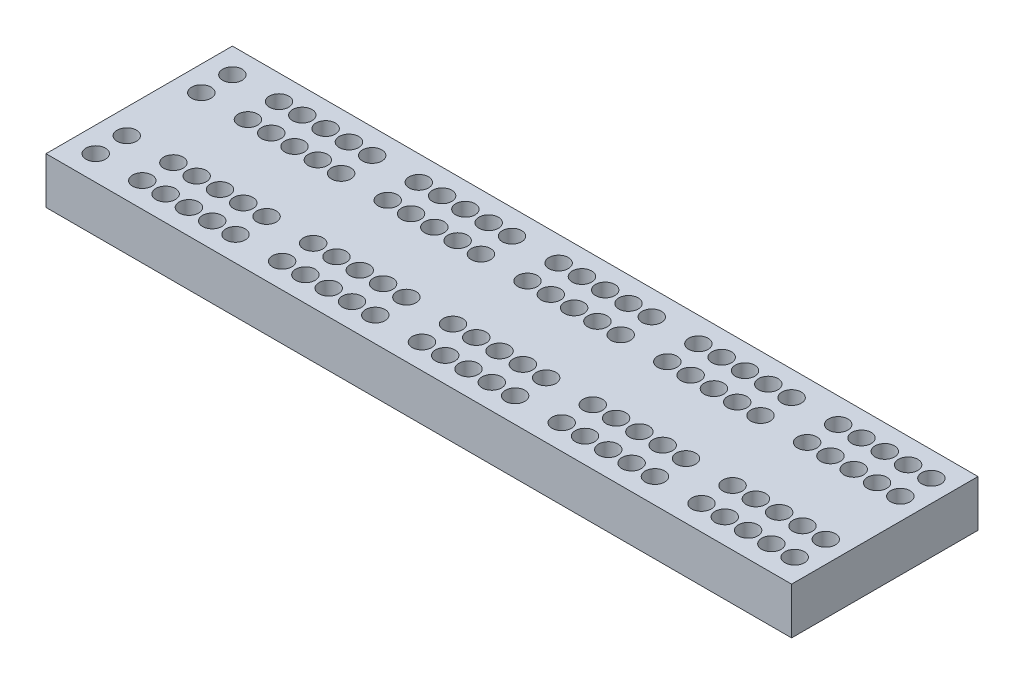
ISO-10303-21;
HEADER;
FILE_DESCRIPTION(('STEP AP214'),'2;1');
FILE_NAME('part.step','',(''),(''),'','','');
FILE_SCHEMA(('AUTOMOTIVE_DESIGN { 1 0 10303 214 1 1 1 1 }'));
ENDSEC;
DATA;
#1=APPLICATION_CONTEXT('core data for automotive mechanical design processes');
#2=APPLICATION_PROTOCOL_DEFINITION('international standard','automotive_design',2000,#1);
#3=PRODUCT_CONTEXT('',#1,'mechanical');
#4=PRODUCT('Part','Part','',(#3));
#5=PRODUCT_RELATED_PRODUCT_CATEGORY('part','',(#4));
#6=PRODUCT_DEFINITION_FORMATION('','',#4);
#7=PRODUCT_DEFINITION_CONTEXT('part definition',#1,'design');
#8=PRODUCT_DEFINITION('design','',#6,#7);
#9=PRODUCT_DEFINITION_SHAPE('','',#8);
#10=(LENGTH_UNIT() NAMED_UNIT(*) SI_UNIT(.MILLI.,.METRE.));
#11=(NAMED_UNIT(*) PLANE_ANGLE_UNIT() SI_UNIT($,.RADIAN.));
#12=(NAMED_UNIT(*) SI_UNIT($,.STERADIAN.) SOLID_ANGLE_UNIT());
#13=UNCERTAINTY_MEASURE_WITH_UNIT(LENGTH_MEASURE(1.E-05),#10,'distance_accuracy_value','');
#14=(GEOMETRIC_REPRESENTATION_CONTEXT(3) GLOBAL_UNCERTAINTY_ASSIGNED_CONTEXT((#13)) GLOBAL_UNIT_ASSIGNED_CONTEXT((#10,
#11,#12)) REPRESENTATION_CONTEXT('',''));
#15=CARTESIAN_POINT('',(0.,0.,0.));
#16=DIRECTION('',(0.,0.,1.));
#17=DIRECTION('',(1.,0.,0.));
#18=AXIS2_PLACEMENT_3D('',#15,#16,#17);
#19=CARTESIAN_POINT('',(0.,0.,38.1));
#20=DIRECTION('',(1.,0.,0.));
#21=DIRECTION('',(0.,0.,-1.));
#22=AXIS2_PLACEMENT_3D('',#19,#20,#21);
#23=PLANE('',#22);
#24=DIRECTION('',(0.,-1.,0.));
#25=VECTOR('',#24,1.);
#26=CARTESIAN_POINT('',(0.,0.,-38.1));
#27=LINE('',#26,#25);
#28=CARTESIAN_POINT('',(0.,19.05,-38.1));
#29=VERTEX_POINT('',#28);
#30=CARTESIAN_POINT('',(0.,0.,-38.1));
#31=VERTEX_POINT('',#30);
#32=EDGE_CURVE('E705',#29,#31,#27,.T.);
#33=ORIENTED_EDGE('',*,*,#32,.T.);
#34=DIRECTION('',(0.,0.,-1.));
#35=VECTOR('',#34,1.);
#36=CARTESIAN_POINT('',(0.,0.,38.1));
#37=LINE('',#36,#35);
#38=CARTESIAN_POINT('',(0.,0.,38.1));
#39=VERTEX_POINT('',#38);
#40=EDGE_CURVE('E732',#39,#31,#37,.T.);
#41=ORIENTED_EDGE('',*,*,#40,.F.);
#42=DIRECTION('',(0.,-1.,0.));
#43=VECTOR('',#42,1.);
#44=CARTESIAN_POINT('',(0.,0.,38.1));
#45=LINE('',#44,#43);
#46=CARTESIAN_POINT('',(0.,19.05,38.1));
#47=VERTEX_POINT('',#46);
#48=EDGE_CURVE('E714',#47,#39,#45,.T.);
#49=ORIENTED_EDGE('',*,*,#48,.F.);
#50=DIRECTION('',(0.,0.,-1.));
#51=VECTOR('',#50,1.);
#52=CARTESIAN_POINT('',(0.,19.05,38.1));
#53=LINE('',#52,#51);
#54=EDGE_CURVE('E723',#47,#29,#53,.T.);
#55=ORIENTED_EDGE('',*,*,#54,.T.);
#56=EDGE_LOOP('',(#33,#41,#49,#55));
#57=FACE_BOUND('',#56,.T.);
#58=ADVANCED_FACE('F28',(#57),#23,.F.);
#59=CARTESIAN_POINT('',(0.,0.,38.1));
#60=DIRECTION('',(0.,1.,0.));
#61=DIRECTION('',(0.,0.,1.));
#62=AXIS2_PLACEMENT_3D('',#59,#60,#61);
#63=PLANE('',#62);
#64=DIRECTION('',(1.,0.,0.));
#65=VECTOR('',#64,1.);
#66=CARTESIAN_POINT('',(0.,0.,-38.1));
#67=LINE('',#66,#65);
#68=CARTESIAN_POINT('',(304.8,0.,-38.1));
#69=VERTEX_POINT('',#68);
#70=EDGE_CURVE('E708',#31,#69,#67,.T.);
#71=ORIENTED_EDGE('',*,*,#70,.T.);
#72=DIRECTION('',(0.,0.,-1.));
#73=VECTOR('',#72,1.);
#74=CARTESIAN_POINT('',(304.8,0.,38.1));
#75=LINE('',#74,#73);
#76=CARTESIAN_POINT('',(304.8,0.,38.1));
#77=VERTEX_POINT('',#76);
#78=EDGE_CURVE('E729',#77,#69,#75,.T.);
#79=ORIENTED_EDGE('',*,*,#78,.F.);
#80=DIRECTION('',(1.,0.,0.));
#81=VECTOR('',#80,1.);
#82=CARTESIAN_POINT('',(0.,0.,38.1));
#83=LINE('',#82,#81);
#84=EDGE_CURVE('E717',#39,#77,#83,.T.);
#85=ORIENTED_EDGE('',*,*,#84,.F.);
#86=ORIENTED_EDGE('',*,*,#40,.T.);
#87=EDGE_LOOP('',(#71,#79,#85,#86));
#88=FACE_BOUND('',#87,.T.);
#89=ADVANCED_FACE('F1048',(#88),#63,.F.);
#90=CARTESIAN_POINT('',(304.8,0.,38.1));
#91=DIRECTION('',(-1.,0.,0.));
#92=DIRECTION('',(0.,0.,1.));
#93=AXIS2_PLACEMENT_3D('',#90,#91,#92);
#94=PLANE('',#93);
#95=DIRECTION('',(0.,1.,0.));
#96=VECTOR('',#95,1.);
#97=CARTESIAN_POINT('',(304.8,0.,-38.1));
#98=LINE('',#97,#96);
#99=CARTESIAN_POINT('',(304.8,19.05,-38.1));
#100=VERTEX_POINT('',#99);
#101=EDGE_CURVE('E710',#69,#100,#98,.T.);
#102=ORIENTED_EDGE('',*,*,#101,.T.);
#103=DIRECTION('',(0.,0.,-1.));
#104=VECTOR('',#103,1.);
#105=CARTESIAN_POINT('',(304.8,19.05,38.1));
#106=LINE('',#105,#104);
#107=CARTESIAN_POINT('',(304.8,19.05,38.1));
#108=VERTEX_POINT('',#107);
#109=EDGE_CURVE('E726',#108,#100,#106,.T.);
#110=ORIENTED_EDGE('',*,*,#109,.F.);
#111=DIRECTION('',(0.,1.,0.));
#112=VECTOR('',#111,1.);
#113=CARTESIAN_POINT('',(304.8,0.,38.1));
#114=LINE('',#113,#112);
#115=EDGE_CURVE('E719',#77,#108,#114,.T.);
#116=ORIENTED_EDGE('',*,*,#115,.F.);
#117=ORIENTED_EDGE('',*,*,#78,.T.);
#118=EDGE_LOOP('',(#102,#110,#116,#117));
#119=FACE_BOUND('',#118,.T.);
#120=ADVANCED_FACE('F1036',(#119),#94,.F.);
#121=CARTESIAN_POINT('',(0.,19.05,38.1));
#122=DIRECTION('',(0.,-1.,0.));
#123=DIRECTION('',(0.,0.,-1.));
#124=AXIS2_PLACEMENT_3D('',#121,#122,#123);
#125=PLANE('',#124);
#126=CARTESIAN_POINT('',(295.91,19.05,15.24));
#127=DIRECTION('',(0.,1.,0.));
#128=DIRECTION('',(0.,0.,1.));
#129=AXIS2_PLACEMENT_3D('',#126,#127,#128);
#130=CIRCLE('',#129,3.96875000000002);
#131=CARTESIAN_POINT('',(295.91,19.05,19.20875));
#132=VERTEX_POINT('',#131);
#133=EDGE_CURVE('E382',#132,#132,#130,.T.);
#134=ORIENTED_EDGE('',*,*,#133,.F.);
#135=EDGE_LOOP('',(#134));
#136=FACE_BOUND('',#135,.T.);
#137=CARTESIAN_POINT('',(295.91,19.05,27.94));
#138=DIRECTION('',(0.,1.,0.));
#139=DIRECTION('',(0.,0.,1.));
#140=AXIS2_PLACEMENT_3D('',#137,#138,#139);
#141=CIRCLE('',#140,3.96875000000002);
#142=CARTESIAN_POINT('',(295.91,19.05,31.90875));
#143=VERTEX_POINT('',#142);
#144=EDGE_CURVE('E390',#143,#143,#141,.T.);
#145=ORIENTED_EDGE('',*,*,#144,.F.);
#146=EDGE_LOOP('',(#145));
#147=FACE_BOUND('',#146,.T.);
#148=CARTESIAN_POINT('',(286.385,19.05,15.24));
#149=DIRECTION('',(0.,1.,0.));
#150=DIRECTION('',(0.,0.,1.));
#151=AXIS2_PLACEMENT_3D('',#148,#149,#150);
#152=CIRCLE('',#151,3.96875000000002);
#153=CARTESIAN_POINT('',(286.385,19.05,19.20875));
#154=VERTEX_POINT('',#153);
#155=EDGE_CURVE('E396',#154,#154,#152,.T.);
#156=ORIENTED_EDGE('',*,*,#155,.F.);
#157=EDGE_LOOP('',(#156));
#158=FACE_BOUND('',#157,.T.);
#159=CARTESIAN_POINT('',(286.385,19.05,27.94));
#160=DIRECTION('',(0.,1.,0.));
#161=DIRECTION('',(0.,0.,1.));
#162=AXIS2_PLACEMENT_3D('',#159,#160,#161);
#163=CIRCLE('',#162,3.96875000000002);
#164=CARTESIAN_POINT('',(286.385,19.05,31.90875));
#165=VERTEX_POINT('',#164);
#166=EDGE_CURVE('E402',#165,#165,#163,.T.);
#167=ORIENTED_EDGE('',*,*,#166,.F.);
#168=EDGE_LOOP('',(#167));
#169=FACE_BOUND('',#168,.T.);
#170=CARTESIAN_POINT('',(276.86,19.05,15.24));
#171=DIRECTION('',(0.,1.,0.));
#172=DIRECTION('',(0.,0.,1.));
#173=AXIS2_PLACEMENT_3D('',#170,#171,#172);
#174=CIRCLE('',#173,3.96875000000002);
#175=CARTESIAN_POINT('',(276.86,19.05,19.20875));
#176=VERTEX_POINT('',#175);
#177=EDGE_CURVE('E408',#176,#176,#174,.T.);
#178=ORIENTED_EDGE('',*,*,#177,.F.);
#179=EDGE_LOOP('',(#178));
#180=FACE_BOUND('',#179,.T.);
#181=CARTESIAN_POINT('',(276.86,19.05,27.94));
#182=DIRECTION('',(0.,1.,0.));
#183=DIRECTION('',(0.,0.,1.));
#184=AXIS2_PLACEMENT_3D('',#181,#182,#183);
#185=CIRCLE('',#184,3.96875000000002);
#186=CARTESIAN_POINT('',(276.86,19.05,31.90875));
#187=VERTEX_POINT('',#186);
#188=EDGE_CURVE('E414',#187,#187,#185,.T.);
#189=ORIENTED_EDGE('',*,*,#188,.F.);
#190=EDGE_LOOP('',(#189));
#191=FACE_BOUND('',#190,.T.);
#192=CARTESIAN_POINT('',(267.335,19.05,15.24));
#193=DIRECTION('',(0.,1.,0.));
#194=DIRECTION('',(0.,0.,1.));
#195=AXIS2_PLACEMENT_3D('',#192,#193,#194);
#196=CIRCLE('',#195,3.96875000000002);
#197=CARTESIAN_POINT('',(267.335,19.05,19.20875));
#198=VERTEX_POINT('',#197);
#199=EDGE_CURVE('E420',#198,#198,#196,.T.);
#200=ORIENTED_EDGE('',*,*,#199,.F.);
#201=EDGE_LOOP('',(#200));
#202=FACE_BOUND('',#201,.T.);
#203=CARTESIAN_POINT('',(267.335,19.05,27.94));
#204=DIRECTION('',(0.,1.,0.));
#205=DIRECTION('',(0.,0.,1.));
#206=AXIS2_PLACEMENT_3D('',#203,#204,#205);
#207=CIRCLE('',#206,3.96875000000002);
#208=CARTESIAN_POINT('',(267.335,19.05,31.90875));
#209=VERTEX_POINT('',#208);
#210=EDGE_CURVE('E426',#209,#209,#207,.T.);
#211=ORIENTED_EDGE('',*,*,#210,.F.);
#212=EDGE_LOOP('',(#211));
#213=FACE_BOUND('',#212,.T.);
#214=CARTESIAN_POINT('',(257.81,19.05,15.24));
#215=DIRECTION('',(0.,1.,0.));
#216=DIRECTION('',(0.,0.,1.));
#217=AXIS2_PLACEMENT_3D('',#214,#215,#216);
#218=CIRCLE('',#217,3.96875000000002);
#219=CARTESIAN_POINT('',(257.81,19.05,19.20875));
#220=VERTEX_POINT('',#219);
#221=EDGE_CURVE('E432',#220,#220,#218,.T.);
#222=ORIENTED_EDGE('',*,*,#221,.F.);
#223=EDGE_LOOP('',(#222));
#224=FACE_BOUND('',#223,.T.);
#225=CARTESIAN_POINT('',(257.81,19.05,27.94));
#226=DIRECTION('',(0.,1.,0.));
#227=DIRECTION('',(0.,0.,1.));
#228=AXIS2_PLACEMENT_3D('',#225,#226,#227);
#229=CIRCLE('',#228,3.96875000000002);
#230=CARTESIAN_POINT('',(257.81,19.05,31.90875));
#231=VERTEX_POINT('',#230);
#232=EDGE_CURVE('E438',#231,#231,#229,.T.);
#233=ORIENTED_EDGE('',*,*,#232,.F.);
#234=EDGE_LOOP('',(#233));
#235=FACE_BOUND('',#234,.T.);
#236=CARTESIAN_POINT('',(238.76,19.05,15.24));
#237=DIRECTION('',(0.,1.,0.));
#238=DIRECTION('',(0.,0.,1.));
#239=AXIS2_PLACEMENT_3D('',#236,#237,#238);
#240=CIRCLE('',#239,3.96874999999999);
#241=CARTESIAN_POINT('',(238.76,19.05,19.20875));
#242=VERTEX_POINT('',#241);
#243=EDGE_CURVE('E444',#242,#242,#240,.T.);
#244=ORIENTED_EDGE('',*,*,#243,.F.);
#245=EDGE_LOOP('',(#244));
#246=FACE_BOUND('',#245,.T.);
#247=CARTESIAN_POINT('',(238.76,19.05,27.94));
#248=DIRECTION('',(0.,1.,0.));
#249=DIRECTION('',(0.,0.,1.));
#250=AXIS2_PLACEMENT_3D('',#247,#248,#249);
#251=CIRCLE('',#250,3.96874999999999);
#252=CARTESIAN_POINT('',(238.76,19.05,31.90875));
#253=VERTEX_POINT('',#252);
#254=EDGE_CURVE('E450',#253,#253,#251,.T.);
#255=ORIENTED_EDGE('',*,*,#254,.F.);
#256=EDGE_LOOP('',(#255));
#257=FACE_BOUND('',#256,.T.);
#258=CARTESIAN_POINT('',(229.235,19.05,15.24));
#259=DIRECTION('',(0.,1.,0.));
#260=DIRECTION('',(0.,0.,1.));
#261=AXIS2_PLACEMENT_3D('',#258,#259,#260);
#262=CIRCLE('',#261,3.96874999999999);
#263=CARTESIAN_POINT('',(229.235,19.05,19.20875));
#264=VERTEX_POINT('',#263);
#265=EDGE_CURVE('E456',#264,#264,#262,.T.);
#266=ORIENTED_EDGE('',*,*,#265,.F.);
#267=EDGE_LOOP('',(#266));
#268=FACE_BOUND('',#267,.T.);
#269=CARTESIAN_POINT('',(229.235,19.05,27.94));
#270=DIRECTION('',(0.,1.,0.));
#271=DIRECTION('',(0.,0.,1.));
#272=AXIS2_PLACEMENT_3D('',#269,#270,#271);
#273=CIRCLE('',#272,3.96874999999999);
#274=CARTESIAN_POINT('',(229.235,19.05,31.90875));
#275=VERTEX_POINT('',#274);
#276=EDGE_CURVE('E462',#275,#275,#273,.T.);
#277=ORIENTED_EDGE('',*,*,#276,.F.);
#278=EDGE_LOOP('',(#277));
#279=FACE_BOUND('',#278,.T.);
#280=CARTESIAN_POINT('',(219.71,19.05,15.24));
#281=DIRECTION('',(0.,1.,0.));
#282=DIRECTION('',(0.,0.,1.));
#283=AXIS2_PLACEMENT_3D('',#280,#281,#282);
#284=CIRCLE('',#283,3.96874999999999);
#285=CARTESIAN_POINT('',(219.71,19.05,19.20875));
#286=VERTEX_POINT('',#285);
#287=EDGE_CURVE('E468',#286,#286,#284,.T.);
#288=ORIENTED_EDGE('',*,*,#287,.F.);
#289=EDGE_LOOP('',(#288));
#290=FACE_BOUND('',#289,.T.);
#291=CARTESIAN_POINT('',(219.71,19.05,27.94));
#292=DIRECTION('',(0.,1.,0.));
#293=DIRECTION('',(0.,0.,1.));
#294=AXIS2_PLACEMENT_3D('',#291,#292,#293);
#295=CIRCLE('',#294,3.96874999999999);
#296=CARTESIAN_POINT('',(219.71,19.05,31.90875));
#297=VERTEX_POINT('',#296);
#298=EDGE_CURVE('E474',#297,#297,#295,.T.);
#299=ORIENTED_EDGE('',*,*,#298,.F.);
#300=EDGE_LOOP('',(#299));
#301=FACE_BOUND('',#300,.T.);
#302=CARTESIAN_POINT('',(210.185,19.05,15.24));
#303=DIRECTION('',(0.,1.,0.));
#304=DIRECTION('',(0.,0.,1.));
#305=AXIS2_PLACEMENT_3D('',#302,#303,#304);
#306=CIRCLE('',#305,3.96874999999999);
#307=CARTESIAN_POINT('',(210.185,19.05,19.20875));
#308=VERTEX_POINT('',#307);
#309=EDGE_CURVE('E480',#308,#308,#306,.T.);
#310=ORIENTED_EDGE('',*,*,#309,.F.);
#311=EDGE_LOOP('',(#310));
#312=FACE_BOUND('',#311,.T.);
#313=CARTESIAN_POINT('',(210.185,19.05,27.94));
#314=DIRECTION('',(0.,1.,0.));
#315=DIRECTION('',(0.,0.,1.));
#316=AXIS2_PLACEMENT_3D('',#313,#314,#315);
#317=CIRCLE('',#316,3.96874999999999);
#318=CARTESIAN_POINT('',(210.185,19.05,31.90875));
#319=VERTEX_POINT('',#318);
#320=EDGE_CURVE('E486',#319,#319,#317,.T.);
#321=ORIENTED_EDGE('',*,*,#320,.F.);
#322=EDGE_LOOP('',(#321));
#323=FACE_BOUND('',#322,.T.);
#324=CARTESIAN_POINT('',(200.66,19.05,15.24));
#325=DIRECTION('',(0.,1.,0.));
#326=DIRECTION('',(0.,0.,1.));
#327=AXIS2_PLACEMENT_3D('',#324,#325,#326);
#328=CIRCLE('',#327,3.96874999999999);
#329=CARTESIAN_POINT('',(200.66,19.05,19.20875));
#330=VERTEX_POINT('',#329);
#331=EDGE_CURVE('E492',#330,#330,#328,.T.);
#332=ORIENTED_EDGE('',*,*,#331,.F.);
#333=EDGE_LOOP('',(#332));
#334=FACE_BOUND('',#333,.T.);
#335=CARTESIAN_POINT('',(200.66,19.05,27.94));
#336=DIRECTION('',(0.,1.,0.));
#337=DIRECTION('',(0.,0.,1.));
#338=AXIS2_PLACEMENT_3D('',#335,#336,#337);
#339=CIRCLE('',#338,3.96874999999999);
#340=CARTESIAN_POINT('',(200.66,19.05,31.90875));
#341=VERTEX_POINT('',#340);
#342=EDGE_CURVE('E498',#341,#341,#339,.T.);
#343=ORIENTED_EDGE('',*,*,#342,.F.);
#344=EDGE_LOOP('',(#343));
#345=FACE_BOUND('',#344,.T.);
#346=CARTESIAN_POINT('',(181.61,19.05,15.24));
#347=DIRECTION('',(0.,1.,0.));
#348=DIRECTION('',(0.,0.,1.));
#349=AXIS2_PLACEMENT_3D('',#346,#347,#348);
#350=CIRCLE('',#349,3.96874999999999);
#351=CARTESIAN_POINT('',(181.61,19.05,19.20875));
#352=VERTEX_POINT('',#351);
#353=EDGE_CURVE('E504',#352,#352,#350,.T.);
#354=ORIENTED_EDGE('',*,*,#353,.F.);
#355=EDGE_LOOP('',(#354));
#356=FACE_BOUND('',#355,.T.);
#357=CARTESIAN_POINT('',(181.61,19.05,27.94));
#358=DIRECTION('',(0.,1.,0.));
#359=DIRECTION('',(0.,0.,1.));
#360=AXIS2_PLACEMENT_3D('',#357,#358,#359);
#361=CIRCLE('',#360,3.96874999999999);
#362=CARTESIAN_POINT('',(181.61,19.05,31.90875));
#363=VERTEX_POINT('',#362);
#364=EDGE_CURVE('E510',#363,#363,#361,.T.);
#365=ORIENTED_EDGE('',*,*,#364,.F.);
#366=EDGE_LOOP('',(#365));
#367=FACE_BOUND('',#366,.T.);
#368=CARTESIAN_POINT('',(172.085,19.05,15.24));
#369=DIRECTION('',(0.,1.,0.));
#370=DIRECTION('',(0.,0.,1.));
#371=AXIS2_PLACEMENT_3D('',#368,#369,#370);
#372=CIRCLE('',#371,3.96874999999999);
#373=CARTESIAN_POINT('',(172.085,19.05,19.20875));
#374=VERTEX_POINT('',#373);
#375=EDGE_CURVE('E516',#374,#374,#372,.T.);
#376=ORIENTED_EDGE('',*,*,#375,.F.);
#377=EDGE_LOOP('',(#376));
#378=FACE_BOUND('',#377,.T.);
#379=CARTESIAN_POINT('',(172.085,19.05,27.94));
#380=DIRECTION('',(0.,1.,0.));
#381=DIRECTION('',(0.,0.,1.));
#382=AXIS2_PLACEMENT_3D('',#379,#380,#381);
#383=CIRCLE('',#382,3.96874999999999);
#384=CARTESIAN_POINT('',(172.085,19.05,31.90875));
#385=VERTEX_POINT('',#384);
#386=EDGE_CURVE('E522',#385,#385,#383,.T.);
#387=ORIENTED_EDGE('',*,*,#386,.F.);
#388=EDGE_LOOP('',(#387));
#389=FACE_BOUND('',#388,.T.);
#390=CARTESIAN_POINT('',(162.56,19.05,15.24));
#391=DIRECTION('',(0.,1.,0.));
#392=DIRECTION('',(0.,0.,1.));
#393=AXIS2_PLACEMENT_3D('',#390,#391,#392);
#394=CIRCLE('',#393,3.96874999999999);
#395=CARTESIAN_POINT('',(162.56,19.05,19.20875));
#396=VERTEX_POINT('',#395);
#397=EDGE_CURVE('E528',#396,#396,#394,.T.);
#398=ORIENTED_EDGE('',*,*,#397,.F.);
#399=EDGE_LOOP('',(#398));
#400=FACE_BOUND('',#399,.T.);
#401=CARTESIAN_POINT('',(162.56,19.05,27.94));
#402=DIRECTION('',(0.,1.,0.));
#403=DIRECTION('',(0.,0.,1.));
#404=AXIS2_PLACEMENT_3D('',#401,#402,#403);
#405=CIRCLE('',#404,3.96874999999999);
#406=CARTESIAN_POINT('',(162.56,19.05,31.90875));
#407=VERTEX_POINT('',#406);
#408=EDGE_CURVE('E534',#407,#407,#405,.T.);
#409=ORIENTED_EDGE('',*,*,#408,.F.);
#410=EDGE_LOOP('',(#409));
#411=FACE_BOUND('',#410,.T.);
#412=CARTESIAN_POINT('',(153.035,19.05,15.24));
#413=DIRECTION('',(0.,1.,0.));
#414=DIRECTION('',(0.,0.,1.));
#415=AXIS2_PLACEMENT_3D('',#412,#413,#414);
#416=CIRCLE('',#415,3.96874999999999);
#417=CARTESIAN_POINT('',(153.035,19.05,19.20875));
#418=VERTEX_POINT('',#417);
#419=EDGE_CURVE('E540',#418,#418,#416,.T.);
#420=ORIENTED_EDGE('',*,*,#419,.F.);
#421=EDGE_LOOP('',(#420));
#422=FACE_BOUND('',#421,.T.);
#423=CARTESIAN_POINT('',(153.035,19.05,27.94));
#424=DIRECTION('',(0.,1.,0.));
#425=DIRECTION('',(0.,0.,1.));
#426=AXIS2_PLACEMENT_3D('',#423,#424,#425);
#427=CIRCLE('',#426,3.96874999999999);
#428=CARTESIAN_POINT('',(153.035,19.05,31.90875));
#429=VERTEX_POINT('',#428);
#430=EDGE_CURVE('E546',#429,#429,#427,.T.);
#431=ORIENTED_EDGE('',*,*,#430,.F.);
#432=EDGE_LOOP('',(#431));
#433=FACE_BOUND('',#432,.T.);
#434=CARTESIAN_POINT('',(143.51,19.05,15.24));
#435=DIRECTION('',(0.,1.,0.));
#436=DIRECTION('',(0.,0.,1.));
#437=AXIS2_PLACEMENT_3D('',#434,#435,#436);
#438=CIRCLE('',#437,3.96874999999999);
#439=CARTESIAN_POINT('',(143.51,19.05,19.20875));
#440=VERTEX_POINT('',#439);
#441=EDGE_CURVE('E552',#440,#440,#438,.T.);
#442=ORIENTED_EDGE('',*,*,#441,.F.);
#443=EDGE_LOOP('',(#442));
#444=FACE_BOUND('',#443,.T.);
#445=CARTESIAN_POINT('',(143.51,19.05,27.94));
#446=DIRECTION('',(0.,1.,0.));
#447=DIRECTION('',(0.,0.,1.));
#448=AXIS2_PLACEMENT_3D('',#445,#446,#447);
#449=CIRCLE('',#448,3.96874999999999);
#450=CARTESIAN_POINT('',(143.51,19.05,31.90875));
#451=VERTEX_POINT('',#450);
#452=EDGE_CURVE('E558',#451,#451,#449,.T.);
#453=ORIENTED_EDGE('',*,*,#452,.F.);
#454=EDGE_LOOP('',(#453));
#455=FACE_BOUND('',#454,.T.);
#456=CARTESIAN_POINT('',(124.46,19.05,15.24));
#457=DIRECTION('',(0.,1.,0.));
#458=DIRECTION('',(0.,0.,1.));
#459=AXIS2_PLACEMENT_3D('',#456,#457,#458);
#460=CIRCLE('',#459,3.96875000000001);
#461=CARTESIAN_POINT('',(124.46,19.05,19.20875));
#462=VERTEX_POINT('',#461);
#463=EDGE_CURVE('E564',#462,#462,#460,.T.);
#464=ORIENTED_EDGE('',*,*,#463,.F.);
#465=EDGE_LOOP('',(#464));
#466=FACE_BOUND('',#465,.T.);
#467=CARTESIAN_POINT('',(124.46,19.05,27.94));
#468=DIRECTION('',(0.,1.,0.));
#469=DIRECTION('',(0.,0.,1.));
#470=AXIS2_PLACEMENT_3D('',#467,#468,#469);
#471=CIRCLE('',#470,3.96875000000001);
#472=CARTESIAN_POINT('',(124.46,19.05,31.90875));
#473=VERTEX_POINT('',#472);
#474=EDGE_CURVE('E570',#473,#473,#471,.T.);
#475=ORIENTED_EDGE('',*,*,#474,.F.);
#476=EDGE_LOOP('',(#475));
#477=FACE_BOUND('',#476,.T.);
#478=CARTESIAN_POINT('',(114.935,19.05,15.24));
#479=DIRECTION('',(0.,1.,0.));
#480=DIRECTION('',(0.,0.,1.));
#481=AXIS2_PLACEMENT_3D('',#478,#479,#480);
#482=CIRCLE('',#481,3.96874999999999);
#483=CARTESIAN_POINT('',(114.935,19.05,19.20875));
#484=VERTEX_POINT('',#483);
#485=EDGE_CURVE('E576',#484,#484,#482,.T.);
#486=ORIENTED_EDGE('',*,*,#485,.F.);
#487=EDGE_LOOP('',(#486));
#488=FACE_BOUND('',#487,.T.);
#489=CARTESIAN_POINT('',(114.935,19.05,27.94));
#490=DIRECTION('',(0.,1.,0.));
#491=DIRECTION('',(0.,0.,1.));
#492=AXIS2_PLACEMENT_3D('',#489,#490,#491);
#493=CIRCLE('',#492,3.96874999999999);
#494=CARTESIAN_POINT('',(114.935,19.05,31.90875));
#495=VERTEX_POINT('',#494);
#496=EDGE_CURVE('E582',#495,#495,#493,.T.);
#497=ORIENTED_EDGE('',*,*,#496,.F.);
#498=EDGE_LOOP('',(#497));
#499=FACE_BOUND('',#498,.T.);
#500=CARTESIAN_POINT('',(105.41,19.05,15.24));
#501=DIRECTION('',(0.,1.,0.));
#502=DIRECTION('',(0.,0.,1.));
#503=AXIS2_PLACEMENT_3D('',#500,#501,#502);
#504=CIRCLE('',#503,3.96874999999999);
#505=CARTESIAN_POINT('',(105.41,19.05,19.20875));
#506=VERTEX_POINT('',#505);
#507=EDGE_CURVE('E588',#506,#506,#504,.T.);
#508=ORIENTED_EDGE('',*,*,#507,.F.);
#509=EDGE_LOOP('',(#508));
#510=FACE_BOUND('',#509,.T.);
#511=CARTESIAN_POINT('',(105.41,19.05,27.94));
#512=DIRECTION('',(0.,1.,0.));
#513=DIRECTION('',(0.,0.,1.));
#514=AXIS2_PLACEMENT_3D('',#511,#512,#513);
#515=CIRCLE('',#514,3.96874999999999);
#516=CARTESIAN_POINT('',(105.41,19.05,31.90875));
#517=VERTEX_POINT('',#516);
#518=EDGE_CURVE('E594',#517,#517,#515,.T.);
#519=ORIENTED_EDGE('',*,*,#518,.F.);
#520=EDGE_LOOP('',(#519));
#521=FACE_BOUND('',#520,.T.);
#522=CARTESIAN_POINT('',(95.885,19.05,15.24));
#523=DIRECTION('',(0.,1.,0.));
#524=DIRECTION('',(0.,0.,1.));
#525=AXIS2_PLACEMENT_3D('',#522,#523,#524);
#526=CIRCLE('',#525,3.96874999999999);
#527=CARTESIAN_POINT('',(95.885,19.05,19.20875));
#528=VERTEX_POINT('',#527);
#529=EDGE_CURVE('E600',#528,#528,#526,.T.);
#530=ORIENTED_EDGE('',*,*,#529,.F.);
#531=EDGE_LOOP('',(#530));
#532=FACE_BOUND('',#531,.T.);
#533=CARTESIAN_POINT('',(95.885,19.05,27.94));
#534=DIRECTION('',(0.,1.,0.));
#535=DIRECTION('',(0.,0.,1.));
#536=AXIS2_PLACEMENT_3D('',#533,#534,#535);
#537=CIRCLE('',#536,3.96874999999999);
#538=CARTESIAN_POINT('',(95.885,19.05,31.90875));
#539=VERTEX_POINT('',#538);
#540=EDGE_CURVE('E606',#539,#539,#537,.T.);
#541=ORIENTED_EDGE('',*,*,#540,.F.);
#542=EDGE_LOOP('',(#541));
#543=FACE_BOUND('',#542,.T.);
#544=CARTESIAN_POINT('',(86.36,19.05,15.24));
#545=DIRECTION('',(0.,1.,0.));
#546=DIRECTION('',(0.,0.,1.));
#547=AXIS2_PLACEMENT_3D('',#544,#545,#546);
#548=CIRCLE('',#547,3.96874999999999);
#549=CARTESIAN_POINT('',(86.36,19.05,19.20875));
#550=VERTEX_POINT('',#549);
#551=EDGE_CURVE('E612',#550,#550,#548,.T.);
#552=ORIENTED_EDGE('',*,*,#551,.F.);
#553=EDGE_LOOP('',(#552));
#554=FACE_BOUND('',#553,.T.);
#555=CARTESIAN_POINT('',(86.36,19.05,27.94));
#556=DIRECTION('',(0.,1.,0.));
#557=DIRECTION('',(0.,0.,1.));
#558=AXIS2_PLACEMENT_3D('',#555,#556,#557);
#559=CIRCLE('',#558,3.96874999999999);
#560=CARTESIAN_POINT('',(86.36,19.05,31.90875));
#561=VERTEX_POINT('',#560);
#562=EDGE_CURVE('E618',#561,#561,#559,.T.);
#563=ORIENTED_EDGE('',*,*,#562,.F.);
#564=EDGE_LOOP('',(#563));
#565=FACE_BOUND('',#564,.T.);
#566=CARTESIAN_POINT('',(67.31,19.05,15.24));
#567=DIRECTION('',(0.,1.,0.));
#568=DIRECTION('',(0.,0.,1.));
#569=AXIS2_PLACEMENT_3D('',#566,#567,#568);
#570=CIRCLE('',#569,3.96874999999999);
#571=CARTESIAN_POINT('',(67.31,19.05,19.20875));
#572=VERTEX_POINT('',#571);
#573=EDGE_CURVE('E624',#572,#572,#570,.T.);
#574=ORIENTED_EDGE('',*,*,#573,.F.);
#575=EDGE_LOOP('',(#574));
#576=FACE_BOUND('',#575,.T.);
#577=CARTESIAN_POINT('',(67.31,19.05,27.94));
#578=DIRECTION('',(0.,1.,0.));
#579=DIRECTION('',(0.,0.,1.));
#580=AXIS2_PLACEMENT_3D('',#577,#578,#579);
#581=CIRCLE('',#580,3.96874999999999);
#582=CARTESIAN_POINT('',(67.31,19.05,31.90875));
#583=VERTEX_POINT('',#582);
#584=EDGE_CURVE('E630',#583,#583,#581,.T.);
#585=ORIENTED_EDGE('',*,*,#584,.F.);
#586=EDGE_LOOP('',(#585));
#587=FACE_BOUND('',#586,.T.);
#588=CARTESIAN_POINT('',(57.785,19.05,15.24));
#589=DIRECTION('',(0.,1.,0.));
#590=DIRECTION('',(0.,0.,1.));
#591=AXIS2_PLACEMENT_3D('',#588,#589,#590);
#592=CIRCLE('',#591,3.96875);
#593=CARTESIAN_POINT('',(57.785,19.05,19.20875));
#594=VERTEX_POINT('',#593);
#595=EDGE_CURVE('E636',#594,#594,#592,.T.);
#596=ORIENTED_EDGE('',*,*,#595,.F.);
#597=EDGE_LOOP('',(#596));
#598=FACE_BOUND('',#597,.T.);
#599=CARTESIAN_POINT('',(57.785,19.05,27.94));
#600=DIRECTION('',(0.,1.,0.));
#601=DIRECTION('',(0.,0.,1.));
#602=AXIS2_PLACEMENT_3D('',#599,#600,#601);
#603=CIRCLE('',#602,3.96875);
#604=CARTESIAN_POINT('',(57.785,19.05,31.90875));
#605=VERTEX_POINT('',#604);
#606=EDGE_CURVE('E642',#605,#605,#603,.T.);
#607=ORIENTED_EDGE('',*,*,#606,.F.);
#608=EDGE_LOOP('',(#607));
#609=FACE_BOUND('',#608,.T.);
#610=CARTESIAN_POINT('',(48.26,19.05,15.24));
#611=DIRECTION('',(0.,1.,0.));
#612=DIRECTION('',(0.,0.,1.));
#613=AXIS2_PLACEMENT_3D('',#610,#611,#612);
#614=CIRCLE('',#613,3.96875);
#615=CARTESIAN_POINT('',(48.26,19.05,19.20875));
#616=VERTEX_POINT('',#615);
#617=EDGE_CURVE('E648',#616,#616,#614,.T.);
#618=ORIENTED_EDGE('',*,*,#617,.F.);
#619=EDGE_LOOP('',(#618));
#620=FACE_BOUND('',#619,.T.);
#621=CARTESIAN_POINT('',(48.26,19.05,27.94));
#622=DIRECTION('',(0.,1.,0.));
#623=DIRECTION('',(0.,0.,1.));
#624=AXIS2_PLACEMENT_3D('',#621,#622,#623);
#625=CIRCLE('',#624,3.96875);
#626=CARTESIAN_POINT('',(48.26,19.05,31.90875));
#627=VERTEX_POINT('',#626);
#628=EDGE_CURVE('E654',#627,#627,#625,.T.);
#629=ORIENTED_EDGE('',*,*,#628,.F.);
#630=EDGE_LOOP('',(#629));
#631=FACE_BOUND('',#630,.T.);
#632=CARTESIAN_POINT('',(38.735,19.05,15.24));
#633=DIRECTION('',(0.,1.,0.));
#634=DIRECTION('',(0.,0.,1.));
#635=AXIS2_PLACEMENT_3D('',#632,#633,#634);
#636=CIRCLE('',#635,3.96875);
#637=CARTESIAN_POINT('',(38.735,19.05,19.20875));
#638=VERTEX_POINT('',#637);
#639=EDGE_CURVE('E660',#638,#638,#636,.T.);
#640=ORIENTED_EDGE('',*,*,#639,.F.);
#641=EDGE_LOOP('',(#640));
#642=FACE_BOUND('',#641,.T.);
#643=CARTESIAN_POINT('',(38.735,19.05,27.94));
#644=DIRECTION('',(0.,1.,0.));
#645=DIRECTION('',(0.,0.,1.));
#646=AXIS2_PLACEMENT_3D('',#643,#644,#645);
#647=CIRCLE('',#646,3.96875);
#648=CARTESIAN_POINT('',(38.735,19.05,31.90875));
#649=VERTEX_POINT('',#648);
#650=EDGE_CURVE('E666',#649,#649,#647,.T.);
#651=ORIENTED_EDGE('',*,*,#650,.F.);
#652=EDGE_LOOP('',(#651));
#653=FACE_BOUND('',#652,.T.);
#654=CARTESIAN_POINT('',(29.21,19.05,15.24));
#655=DIRECTION('',(0.,1.,0.));
#656=DIRECTION('',(0.,0.,1.));
#657=AXIS2_PLACEMENT_3D('',#654,#655,#656);
#658=CIRCLE('',#657,3.96875);
#659=CARTESIAN_POINT('',(29.21,19.05,19.20875));
#660=VERTEX_POINT('',#659);
#661=EDGE_CURVE('E672',#660,#660,#658,.T.);
#662=ORIENTED_EDGE('',*,*,#661,.F.);
#663=EDGE_LOOP('',(#662));
#664=FACE_BOUND('',#663,.T.);
#665=CARTESIAN_POINT('',(29.21,19.05,27.94));
#666=DIRECTION('',(0.,1.,0.));
#667=DIRECTION('',(0.,0.,1.));
#668=AXIS2_PLACEMENT_3D('',#665,#666,#667);
#669=CIRCLE('',#668,3.96875);
#670=CARTESIAN_POINT('',(29.21,19.05,31.90875));
#671=VERTEX_POINT('',#670);
#672=EDGE_CURVE('E678',#671,#671,#669,.T.);
#673=ORIENTED_EDGE('',*,*,#672,.F.);
#674=EDGE_LOOP('',(#673));
#675=FACE_BOUND('',#674,.T.);
#676=CARTESIAN_POINT('',(10.16,19.05,15.24));
#677=DIRECTION('',(0.,1.,0.));
#678=DIRECTION('',(0.,0.,1.));
#679=AXIS2_PLACEMENT_3D('',#676,#677,#678);
#680=CIRCLE('',#679,3.96875);
#681=CARTESIAN_POINT('',(10.16,19.05,19.20875));
#682=VERTEX_POINT('',#681);
#683=EDGE_CURVE('E684',#682,#682,#680,.T.);
#684=ORIENTED_EDGE('',*,*,#683,.F.);
#685=EDGE_LOOP('',(#684));
#686=FACE_BOUND('',#685,.T.);
#687=CARTESIAN_POINT('',(10.16,19.05,27.94));
#688=DIRECTION('',(0.,1.,0.));
#689=DIRECTION('',(0.,0.,1.));
#690=AXIS2_PLACEMENT_3D('',#687,#688,#689);
#691=CIRCLE('',#690,3.96875);
#692=CARTESIAN_POINT('',(10.16,19.05,31.90875));
#693=VERTEX_POINT('',#692);
#694=EDGE_CURVE('E690',#693,#693,#691,.T.);
#695=ORIENTED_EDGE('',*,*,#694,.F.);
#696=EDGE_LOOP('',(#695));
#697=FACE_BOUND('',#696,.T.);
#698=CARTESIAN_POINT('',(29.21,19.05,-27.94));
#699=DIRECTION('',(0.,1.,0.));
#700=DIRECTION('',(0.,0.,1.));
#701=AXIS2_PLACEMENT_3D('',#698,#699,#700);
#702=CIRCLE('',#701,3.96875);
#703=CARTESIAN_POINT('',(29.21,19.05,-23.97125));
#704=VERTEX_POINT('',#703);
#705=EDGE_CURVE('E693',#704,#704,#702,.T.);
#706=ORIENTED_EDGE('',*,*,#705,.F.);
#707=EDGE_LOOP('',(#706));
#708=FACE_BOUND('',#707,.T.);
#709=CARTESIAN_POINT('',(10.16,19.05,-27.94));
#710=DIRECTION('',(0.,1.,0.));
#711=DIRECTION('',(0.,0.,1.));
#712=AXIS2_PLACEMENT_3D('',#709,#710,#711);
#713=CIRCLE('',#712,3.96875);
#714=CARTESIAN_POINT('',(10.16,19.05,-23.97125));
#715=VERTEX_POINT('',#714);
#716=EDGE_CURVE('E702',#715,#715,#713,.T.);
#717=ORIENTED_EDGE('',*,*,#716,.F.);
#718=EDGE_LOOP('',(#717));
#719=FACE_BOUND('',#718,.T.);
#720=DIRECTION('',(-1.,0.,0.));
#721=VECTOR('',#720,1.);
#722=CARTESIAN_POINT('',(0.,19.05,-38.1));
#723=LINE('',#722,#721);
#724=EDGE_CURVE('E712',#100,#29,#723,.T.);
#725=ORIENTED_EDGE('',*,*,#724,.T.);
#726=ORIENTED_EDGE('',*,*,#54,.F.);
#727=DIRECTION('',(-1.,0.,0.));
#728=VECTOR('',#727,1.);
#729=CARTESIAN_POINT('',(0.,19.05,38.1));
#730=LINE('',#729,#728);
#731=EDGE_CURVE('E721',#108,#47,#730,.T.);
#732=ORIENTED_EDGE('',*,*,#731,.F.);
#733=ORIENTED_EDGE('',*,*,#109,.T.);
#734=EDGE_LOOP('',(#725,#726,#732,#733));
#735=FACE_BOUND('',#734,.T.);
#736=CARTESIAN_POINT('',(38.735,19.05,-27.94));
#737=DIRECTION('',(0.,1.,0.));
#738=DIRECTION('',(0.,0.,1.));
#739=AXIS2_PLACEMENT_3D('',#736,#737,#738);
#740=CIRCLE('',#739,3.96875);
#741=CARTESIAN_POINT('',(38.735,19.05,-23.97125));
#742=VERTEX_POINT('',#741);
#743=EDGE_CURVE('E735',#742,#742,#740,.T.);
#744=ORIENTED_EDGE('',*,*,#743,.F.);
#745=EDGE_LOOP('',(#744));
#746=FACE_BOUND('',#745,.T.);
#747=CARTESIAN_POINT('',(48.26,19.05,-27.94));
#748=DIRECTION('',(0.,1.,0.));
#749=DIRECTION('',(0.,0.,1.));
#750=AXIS2_PLACEMENT_3D('',#747,#748,#749);
#751=CIRCLE('',#750,3.96875);
#752=CARTESIAN_POINT('',(48.26,19.05,-23.97125));
#753=VERTEX_POINT('',#752);
#754=EDGE_CURVE('E741',#753,#753,#751,.T.);
#755=ORIENTED_EDGE('',*,*,#754,.F.);
#756=EDGE_LOOP('',(#755));
#757=FACE_BOUND('',#756,.T.);
#758=CARTESIAN_POINT('',(57.785,19.05,-27.94));
#759=DIRECTION('',(0.,1.,0.));
#760=DIRECTION('',(0.,0.,1.));
#761=AXIS2_PLACEMENT_3D('',#758,#759,#760);
#762=CIRCLE('',#761,3.96875);
#763=CARTESIAN_POINT('',(57.785,19.05,-23.97125));
#764=VERTEX_POINT('',#763);
#765=EDGE_CURVE('E747',#764,#764,#762,.T.);
#766=ORIENTED_EDGE('',*,*,#765,.F.);
#767=EDGE_LOOP('',(#766));
#768=FACE_BOUND('',#767,.T.);
#769=CARTESIAN_POINT('',(67.31,19.05,-27.94));
#770=DIRECTION('',(0.,1.,0.));
#771=DIRECTION('',(0.,0.,1.));
#772=AXIS2_PLACEMENT_3D('',#769,#770,#771);
#773=CIRCLE('',#772,3.96875);
#774=CARTESIAN_POINT('',(67.31,19.05,-23.97125));
#775=VERTEX_POINT('',#774);
#776=EDGE_CURVE('E753',#775,#775,#773,.T.);
#777=ORIENTED_EDGE('',*,*,#776,.F.);
#778=EDGE_LOOP('',(#777));
#779=FACE_BOUND('',#778,.T.);
#780=CARTESIAN_POINT('',(86.36,19.05,-27.94));
#781=DIRECTION('',(0.,1.,0.));
#782=DIRECTION('',(0.,0.,1.));
#783=AXIS2_PLACEMENT_3D('',#780,#781,#782);
#784=CIRCLE('',#783,3.96875);
#785=CARTESIAN_POINT('',(86.36,19.05,-23.97125));
#786=VERTEX_POINT('',#785);
#787=EDGE_CURVE('E759',#786,#786,#784,.T.);
#788=ORIENTED_EDGE('',*,*,#787,.F.);
#789=EDGE_LOOP('',(#788));
#790=FACE_BOUND('',#789,.T.);
#791=CARTESIAN_POINT('',(95.885,19.05,-27.94));
#792=DIRECTION('',(0.,1.,0.));
#793=DIRECTION('',(0.,0.,1.));
#794=AXIS2_PLACEMENT_3D('',#791,#792,#793);
#795=CIRCLE('',#794,3.96875);
#796=CARTESIAN_POINT('',(95.885,19.05,-23.97125));
#797=VERTEX_POINT('',#796);
#798=EDGE_CURVE('E765',#797,#797,#795,.T.);
#799=ORIENTED_EDGE('',*,*,#798,.F.);
#800=EDGE_LOOP('',(#799));
#801=FACE_BOUND('',#800,.T.);
#802=CARTESIAN_POINT('',(105.41,19.05,-27.94));
#803=DIRECTION('',(0.,1.,0.));
#804=DIRECTION('',(0.,0.,1.));
#805=AXIS2_PLACEMENT_3D('',#802,#803,#804);
#806=CIRCLE('',#805,3.96875);
#807=CARTESIAN_POINT('',(105.41,19.05,-23.97125));
#808=VERTEX_POINT('',#807);
#809=EDGE_CURVE('E771',#808,#808,#806,.T.);
#810=ORIENTED_EDGE('',*,*,#809,.F.);
#811=EDGE_LOOP('',(#810));
#812=FACE_BOUND('',#811,.T.);
#813=CARTESIAN_POINT('',(114.935,19.05,-27.94));
#814=DIRECTION('',(0.,1.,0.));
#815=DIRECTION('',(0.,0.,1.));
#816=AXIS2_PLACEMENT_3D('',#813,#814,#815);
#817=CIRCLE('',#816,3.96875);
#818=CARTESIAN_POINT('',(114.935,19.05,-23.97125));
#819=VERTEX_POINT('',#818);
#820=EDGE_CURVE('E777',#819,#819,#817,.T.);
#821=ORIENTED_EDGE('',*,*,#820,.F.);
#822=EDGE_LOOP('',(#821));
#823=FACE_BOUND('',#822,.T.);
#824=CARTESIAN_POINT('',(124.46,19.05,-27.94));
#825=DIRECTION('',(0.,1.,0.));
#826=DIRECTION('',(0.,0.,1.));
#827=AXIS2_PLACEMENT_3D('',#824,#825,#826);
#828=CIRCLE('',#827,3.96875);
#829=CARTESIAN_POINT('',(124.46,19.05,-23.97125));
#830=VERTEX_POINT('',#829);
#831=EDGE_CURVE('E783',#830,#830,#828,.T.);
#832=ORIENTED_EDGE('',*,*,#831,.F.);
#833=EDGE_LOOP('',(#832));
#834=FACE_BOUND('',#833,.T.);
#835=CARTESIAN_POINT('',(143.51,19.05,-27.94));
#836=DIRECTION('',(0.,1.,0.));
#837=DIRECTION('',(0.,0.,1.));
#838=AXIS2_PLACEMENT_3D('',#835,#836,#837);
#839=CIRCLE('',#838,3.96875);
#840=CARTESIAN_POINT('',(143.51,19.05,-23.97125));
#841=VERTEX_POINT('',#840);
#842=EDGE_CURVE('E789',#841,#841,#839,.T.);
#843=ORIENTED_EDGE('',*,*,#842,.F.);
#844=EDGE_LOOP('',(#843));
#845=FACE_BOUND('',#844,.T.);
#846=CARTESIAN_POINT('',(153.035,19.05,-27.94));
#847=DIRECTION('',(0.,1.,0.));
#848=DIRECTION('',(0.,0.,1.));
#849=AXIS2_PLACEMENT_3D('',#846,#847,#848);
#850=CIRCLE('',#849,3.96875);
#851=CARTESIAN_POINT('',(153.035,19.05,-23.97125));
#852=VERTEX_POINT('',#851);
#853=EDGE_CURVE('E795',#852,#852,#850,.T.);
#854=ORIENTED_EDGE('',*,*,#853,.F.);
#855=EDGE_LOOP('',(#854));
#856=FACE_BOUND('',#855,.T.);
#857=CARTESIAN_POINT('',(162.56,19.05,-27.94));
#858=DIRECTION('',(0.,1.,0.));
#859=DIRECTION('',(0.,0.,1.));
#860=AXIS2_PLACEMENT_3D('',#857,#858,#859);
#861=CIRCLE('',#860,3.96875);
#862=CARTESIAN_POINT('',(162.56,19.05,-23.97125));
#863=VERTEX_POINT('',#862);
#864=EDGE_CURVE('E801',#863,#863,#861,.T.);
#865=ORIENTED_EDGE('',*,*,#864,.F.);
#866=EDGE_LOOP('',(#865));
#867=FACE_BOUND('',#866,.T.);
#868=CARTESIAN_POINT('',(172.085,19.05,-27.94));
#869=DIRECTION('',(0.,1.,0.));
#870=DIRECTION('',(0.,0.,1.));
#871=AXIS2_PLACEMENT_3D('',#868,#869,#870);
#872=CIRCLE('',#871,3.96875);
#873=CARTESIAN_POINT('',(172.085,19.05,-23.97125));
#874=VERTEX_POINT('',#873);
#875=EDGE_CURVE('E807',#874,#874,#872,.T.);
#876=ORIENTED_EDGE('',*,*,#875,.F.);
#877=EDGE_LOOP('',(#876));
#878=FACE_BOUND('',#877,.T.);
#879=CARTESIAN_POINT('',(181.61,19.05,-27.94));
#880=DIRECTION('',(0.,1.,0.));
#881=DIRECTION('',(0.,0.,1.));
#882=AXIS2_PLACEMENT_3D('',#879,#880,#881);
#883=CIRCLE('',#882,3.96875);
#884=CARTESIAN_POINT('',(181.61,19.05,-23.97125));
#885=VERTEX_POINT('',#884);
#886=EDGE_CURVE('E813',#885,#885,#883,.T.);
#887=ORIENTED_EDGE('',*,*,#886,.F.);
#888=EDGE_LOOP('',(#887));
#889=FACE_BOUND('',#888,.T.);
#890=CARTESIAN_POINT('',(200.66,19.05,-27.94));
#891=DIRECTION('',(0.,1.,0.));
#892=DIRECTION('',(0.,0.,1.));
#893=AXIS2_PLACEMENT_3D('',#890,#891,#892);
#894=CIRCLE('',#893,3.96875);
#895=CARTESIAN_POINT('',(200.66,19.05,-23.97125));
#896=VERTEX_POINT('',#895);
#897=EDGE_CURVE('E819',#896,#896,#894,.T.);
#898=ORIENTED_EDGE('',*,*,#897,.F.);
#899=EDGE_LOOP('',(#898));
#900=FACE_BOUND('',#899,.T.);
#901=CARTESIAN_POINT('',(210.185,19.05,-27.94));
#902=DIRECTION('',(0.,1.,0.));
#903=DIRECTION('',(0.,0.,1.));
#904=AXIS2_PLACEMENT_3D('',#901,#902,#903);
#905=CIRCLE('',#904,3.96875);
#906=CARTESIAN_POINT('',(210.185,19.05,-23.97125));
#907=VERTEX_POINT('',#906);
#908=EDGE_CURVE('E825',#907,#907,#905,.T.);
#909=ORIENTED_EDGE('',*,*,#908,.F.);
#910=EDGE_LOOP('',(#909));
#911=FACE_BOUND('',#910,.T.);
#912=CARTESIAN_POINT('',(219.71,19.05,-27.94));
#913=DIRECTION('',(0.,1.,0.));
#914=DIRECTION('',(0.,0.,1.));
#915=AXIS2_PLACEMENT_3D('',#912,#913,#914);
#916=CIRCLE('',#915,3.96875);
#917=CARTESIAN_POINT('',(219.71,19.05,-23.97125));
#918=VERTEX_POINT('',#917);
#919=EDGE_CURVE('E831',#918,#918,#916,.T.);
#920=ORIENTED_EDGE('',*,*,#919,.F.);
#921=EDGE_LOOP('',(#920));
#922=FACE_BOUND('',#921,.T.);
#923=CARTESIAN_POINT('',(229.235,19.05,-27.94));
#924=DIRECTION('',(0.,1.,0.));
#925=DIRECTION('',(0.,0.,1.));
#926=AXIS2_PLACEMENT_3D('',#923,#924,#925);
#927=CIRCLE('',#926,3.96875);
#928=CARTESIAN_POINT('',(229.235,19.05,-23.97125));
#929=VERTEX_POINT('',#928);
#930=EDGE_CURVE('E837',#929,#929,#927,.T.);
#931=ORIENTED_EDGE('',*,*,#930,.F.);
#932=EDGE_LOOP('',(#931));
#933=FACE_BOUND('',#932,.T.);
#934=CARTESIAN_POINT('',(238.76,19.05,-27.94));
#935=DIRECTION('',(0.,1.,0.));
#936=DIRECTION('',(0.,0.,1.));
#937=AXIS2_PLACEMENT_3D('',#934,#935,#936);
#938=CIRCLE('',#937,3.96875);
#939=CARTESIAN_POINT('',(238.76,19.05,-23.97125));
#940=VERTEX_POINT('',#939);
#941=EDGE_CURVE('E843',#940,#940,#938,.T.);
#942=ORIENTED_EDGE('',*,*,#941,.F.);
#943=EDGE_LOOP('',(#942));
#944=FACE_BOUND('',#943,.T.);
#945=CARTESIAN_POINT('',(257.81,19.05,-27.94));
#946=DIRECTION('',(0.,1.,0.));
#947=DIRECTION('',(0.,0.,1.));
#948=AXIS2_PLACEMENT_3D('',#945,#946,#947);
#949=CIRCLE('',#948,3.96875);
#950=CARTESIAN_POINT('',(257.81,19.05,-23.97125));
#951=VERTEX_POINT('',#950);
#952=EDGE_CURVE('E849',#951,#951,#949,.T.);
#953=ORIENTED_EDGE('',*,*,#952,.F.);
#954=EDGE_LOOP('',(#953));
#955=FACE_BOUND('',#954,.T.);
#956=CARTESIAN_POINT('',(267.335,19.05,-27.94));
#957=DIRECTION('',(0.,1.,0.));
#958=DIRECTION('',(0.,0.,1.));
#959=AXIS2_PLACEMENT_3D('',#956,#957,#958);
#960=CIRCLE('',#959,3.96875);
#961=CARTESIAN_POINT('',(267.335,19.05,-23.97125));
#962=VERTEX_POINT('',#961);
#963=EDGE_CURVE('E855',#962,#962,#960,.T.);
#964=ORIENTED_EDGE('',*,*,#963,.F.);
#965=EDGE_LOOP('',(#964));
#966=FACE_BOUND('',#965,.T.);
#967=CARTESIAN_POINT('',(276.86,19.05,-27.94));
#968=DIRECTION('',(0.,1.,0.));
#969=DIRECTION('',(0.,0.,1.));
#970=AXIS2_PLACEMENT_3D('',#967,#968,#969);
#971=CIRCLE('',#970,3.96875);
#972=CARTESIAN_POINT('',(276.86,19.05,-23.97125));
#973=VERTEX_POINT('',#972);
#974=EDGE_CURVE('E861',#973,#973,#971,.T.);
#975=ORIENTED_EDGE('',*,*,#974,.F.);
#976=EDGE_LOOP('',(#975));
#977=FACE_BOUND('',#976,.T.);
#978=CARTESIAN_POINT('',(286.385,19.05,-27.94));
#979=DIRECTION('',(0.,1.,0.));
#980=DIRECTION('',(0.,0.,1.));
#981=AXIS2_PLACEMENT_3D('',#978,#979,#980);
#982=CIRCLE('',#981,3.96875);
#983=CARTESIAN_POINT('',(286.385,19.05,-23.97125));
#984=VERTEX_POINT('',#983);
#985=EDGE_CURVE('E867',#984,#984,#982,.T.);
#986=ORIENTED_EDGE('',*,*,#985,.F.);
#987=EDGE_LOOP('',(#986));
#988=FACE_BOUND('',#987,.T.);
#989=CARTESIAN_POINT('',(295.91,19.05,-27.94));
#990=DIRECTION('',(0.,1.,0.));
#991=DIRECTION('',(0.,0.,1.));
#992=AXIS2_PLACEMENT_3D('',#989,#990,#991);
#993=CIRCLE('',#992,3.96875);
#994=CARTESIAN_POINT('',(295.91,19.05,-23.97125));
#995=VERTEX_POINT('',#994);
#996=EDGE_CURVE('E873',#995,#995,#993,.T.);
#997=ORIENTED_EDGE('',*,*,#996,.F.);
#998=EDGE_LOOP('',(#997));
#999=FACE_BOUND('',#998,.T.);
#1000=CARTESIAN_POINT('',(10.16,19.05,-15.24));
#1001=DIRECTION('',(0.,1.,0.));
#1002=DIRECTION('',(0.,0.,1.));
#1003=AXIS2_PLACEMENT_3D('',#1000,#1001,#1002);
#1004=CIRCLE('',#1003,3.96875);
#1005=CARTESIAN_POINT('',(10.16,19.05,-11.27125));
#1006=VERTEX_POINT('',#1005);
#1007=EDGE_CURVE('E879',#1006,#1006,#1004,.T.);
#1008=ORIENTED_EDGE('',*,*,#1007,.F.);
#1009=EDGE_LOOP('',(#1008));
#1010=FACE_BOUND('',#1009,.T.);
#1011=CARTESIAN_POINT('',(29.21,19.05,-15.24));
#1012=DIRECTION('',(0.,1.,0.));
#1013=DIRECTION('',(0.,0.,1.));
#1014=AXIS2_PLACEMENT_3D('',#1011,#1012,#1013);
#1015=CIRCLE('',#1014,3.96875);
#1016=CARTESIAN_POINT('',(29.21,19.05,-11.27125));
#1017=VERTEX_POINT('',#1016);
#1018=EDGE_CURVE('E885',#1017,#1017,#1015,.T.);
#1019=ORIENTED_EDGE('',*,*,#1018,.F.);
#1020=EDGE_LOOP('',(#1019));
#1021=FACE_BOUND('',#1020,.T.);
#1022=CARTESIAN_POINT('',(38.735,19.05,-15.24));
#1023=DIRECTION('',(0.,1.,0.));
#1024=DIRECTION('',(0.,0.,1.));
#1025=AXIS2_PLACEMENT_3D('',#1022,#1023,#1024);
#1026=CIRCLE('',#1025,3.96875);
#1027=CARTESIAN_POINT('',(38.735,19.05,-11.27125));
#1028=VERTEX_POINT('',#1027);
#1029=EDGE_CURVE('E891',#1028,#1028,#1026,.T.);
#1030=ORIENTED_EDGE('',*,*,#1029,.F.);
#1031=EDGE_LOOP('',(#1030));
#1032=FACE_BOUND('',#1031,.T.);
#1033=CARTESIAN_POINT('',(48.26,19.05,-15.24));
#1034=DIRECTION('',(0.,1.,0.));
#1035=DIRECTION('',(0.,0.,1.));
#1036=AXIS2_PLACEMENT_3D('',#1033,#1034,#1035);
#1037=CIRCLE('',#1036,3.96875);
#1038=CARTESIAN_POINT('',(48.26,19.05,-11.27125));
#1039=VERTEX_POINT('',#1038);
#1040=EDGE_CURVE('E897',#1039,#1039,#1037,.T.);
#1041=ORIENTED_EDGE('',*,*,#1040,.F.);
#1042=EDGE_LOOP('',(#1041));
#1043=FACE_BOUND('',#1042,.T.);
#1044=CARTESIAN_POINT('',(57.785,19.05,-15.24));
#1045=DIRECTION('',(0.,1.,0.));
#1046=DIRECTION('',(0.,0.,1.));
#1047=AXIS2_PLACEMENT_3D('',#1044,#1045,#1046);
#1048=CIRCLE('',#1047,3.96875);
#1049=CARTESIAN_POINT('',(57.785,19.05,-11.27125));
#1050=VERTEX_POINT('',#1049);
#1051=EDGE_CURVE('E903',#1050,#1050,#1048,.T.);
#1052=ORIENTED_EDGE('',*,*,#1051,.F.);
#1053=EDGE_LOOP('',(#1052));
#1054=FACE_BOUND('',#1053,.T.);
#1055=CARTESIAN_POINT('',(67.31,19.05,-15.24));
#1056=DIRECTION('',(0.,1.,0.));
#1057=DIRECTION('',(0.,0.,1.));
#1058=AXIS2_PLACEMENT_3D('',#1055,#1056,#1057);
#1059=CIRCLE('',#1058,3.96875);
#1060=CARTESIAN_POINT('',(67.31,19.05,-11.27125));
#1061=VERTEX_POINT('',#1060);
#1062=EDGE_CURVE('E909',#1061,#1061,#1059,.T.);
#1063=ORIENTED_EDGE('',*,*,#1062,.F.);
#1064=EDGE_LOOP('',(#1063));
#1065=FACE_BOUND('',#1064,.T.);
#1066=CARTESIAN_POINT('',(86.36,19.05,-15.24));
#1067=DIRECTION('',(0.,1.,0.));
#1068=DIRECTION('',(0.,0.,1.));
#1069=AXIS2_PLACEMENT_3D('',#1066,#1067,#1068);
#1070=CIRCLE('',#1069,3.96875);
#1071=CARTESIAN_POINT('',(86.36,19.05,-11.27125));
#1072=VERTEX_POINT('',#1071);
#1073=EDGE_CURVE('E915',#1072,#1072,#1070,.T.);
#1074=ORIENTED_EDGE('',*,*,#1073,.F.);
#1075=EDGE_LOOP('',(#1074));
#1076=FACE_BOUND('',#1075,.T.);
#1077=CARTESIAN_POINT('',(95.885,19.05,-15.24));
#1078=DIRECTION('',(0.,1.,0.));
#1079=DIRECTION('',(0.,0.,1.));
#1080=AXIS2_PLACEMENT_3D('',#1077,#1078,#1079);
#1081=CIRCLE('',#1080,3.96875);
#1082=CARTESIAN_POINT('',(95.885,19.05,-11.27125));
#1083=VERTEX_POINT('',#1082);
#1084=EDGE_CURVE('E921',#1083,#1083,#1081,.T.);
#1085=ORIENTED_EDGE('',*,*,#1084,.F.);
#1086=EDGE_LOOP('',(#1085));
#1087=FACE_BOUND('',#1086,.T.);
#1088=CARTESIAN_POINT('',(105.41,19.05,-15.24));
#1089=DIRECTION('',(0.,1.,0.));
#1090=DIRECTION('',(0.,0.,1.));
#1091=AXIS2_PLACEMENT_3D('',#1088,#1089,#1090);
#1092=CIRCLE('',#1091,3.96875);
#1093=CARTESIAN_POINT('',(105.41,19.05,-11.27125));
#1094=VERTEX_POINT('',#1093);
#1095=EDGE_CURVE('E927',#1094,#1094,#1092,.T.);
#1096=ORIENTED_EDGE('',*,*,#1095,.F.);
#1097=EDGE_LOOP('',(#1096));
#1098=FACE_BOUND('',#1097,.T.);
#1099=CARTESIAN_POINT('',(114.935,19.05,-15.24));
#1100=DIRECTION('',(0.,1.,0.));
#1101=DIRECTION('',(0.,0.,1.));
#1102=AXIS2_PLACEMENT_3D('',#1099,#1100,#1101);
#1103=CIRCLE('',#1102,3.96875);
#1104=CARTESIAN_POINT('',(114.935,19.05,-11.27125));
#1105=VERTEX_POINT('',#1104);
#1106=EDGE_CURVE('E933',#1105,#1105,#1103,.T.);
#1107=ORIENTED_EDGE('',*,*,#1106,.F.);
#1108=EDGE_LOOP('',(#1107));
#1109=FACE_BOUND('',#1108,.T.);
#1110=CARTESIAN_POINT('',(124.46,19.05,-15.24));
#1111=DIRECTION('',(0.,1.,0.));
#1112=DIRECTION('',(0.,0.,1.));
#1113=AXIS2_PLACEMENT_3D('',#1110,#1111,#1112);
#1114=CIRCLE('',#1113,3.96875);
#1115=CARTESIAN_POINT('',(124.46,19.05,-11.27125));
#1116=VERTEX_POINT('',#1115);
#1117=EDGE_CURVE('E939',#1116,#1116,#1114,.T.);
#1118=ORIENTED_EDGE('',*,*,#1117,.F.);
#1119=EDGE_LOOP('',(#1118));
#1120=FACE_BOUND('',#1119,.T.);
#1121=CARTESIAN_POINT('',(143.51,19.05,-15.24));
#1122=DIRECTION('',(0.,1.,0.));
#1123=DIRECTION('',(0.,0.,1.));
#1124=AXIS2_PLACEMENT_3D('',#1121,#1122,#1123);
#1125=CIRCLE('',#1124,3.96875);
#1126=CARTESIAN_POINT('',(143.51,19.05,-11.27125));
#1127=VERTEX_POINT('',#1126);
#1128=EDGE_CURVE('E945',#1127,#1127,#1125,.T.);
#1129=ORIENTED_EDGE('',*,*,#1128,.F.);
#1130=EDGE_LOOP('',(#1129));
#1131=FACE_BOUND('',#1130,.T.);
#1132=CARTESIAN_POINT('',(153.035,19.05,-15.24));
#1133=DIRECTION('',(0.,1.,0.));
#1134=DIRECTION('',(0.,0.,1.));
#1135=AXIS2_PLACEMENT_3D('',#1132,#1133,#1134);
#1136=CIRCLE('',#1135,3.96875);
#1137=CARTESIAN_POINT('',(153.035,19.05,-11.27125));
#1138=VERTEX_POINT('',#1137);
#1139=EDGE_CURVE('E951',#1138,#1138,#1136,.T.);
#1140=ORIENTED_EDGE('',*,*,#1139,.F.);
#1141=EDGE_LOOP('',(#1140));
#1142=FACE_BOUND('',#1141,.T.);
#1143=CARTESIAN_POINT('',(162.56,19.05,-15.24));
#1144=DIRECTION('',(0.,1.,0.));
#1145=DIRECTION('',(0.,0.,1.));
#1146=AXIS2_PLACEMENT_3D('',#1143,#1144,#1145);
#1147=CIRCLE('',#1146,3.96875);
#1148=CARTESIAN_POINT('',(162.56,19.05,-11.27125));
#1149=VERTEX_POINT('',#1148);
#1150=EDGE_CURVE('E957',#1149,#1149,#1147,.T.);
#1151=ORIENTED_EDGE('',*,*,#1150,.F.);
#1152=EDGE_LOOP('',(#1151));
#1153=FACE_BOUND('',#1152,.T.);
#1154=CARTESIAN_POINT('',(172.085,19.05,-15.24));
#1155=DIRECTION('',(0.,1.,0.));
#1156=DIRECTION('',(0.,0.,1.));
#1157=AXIS2_PLACEMENT_3D('',#1154,#1155,#1156);
#1158=CIRCLE('',#1157,3.96875);
#1159=CARTESIAN_POINT('',(172.085,19.05,-11.27125));
#1160=VERTEX_POINT('',#1159);
#1161=EDGE_CURVE('E963',#1160,#1160,#1158,.T.);
#1162=ORIENTED_EDGE('',*,*,#1161,.F.);
#1163=EDGE_LOOP('',(#1162));
#1164=FACE_BOUND('',#1163,.T.);
#1165=CARTESIAN_POINT('',(181.61,19.05,-15.24));
#1166=DIRECTION('',(0.,1.,0.));
#1167=DIRECTION('',(0.,0.,1.));
#1168=AXIS2_PLACEMENT_3D('',#1165,#1166,#1167);
#1169=CIRCLE('',#1168,3.96875);
#1170=CARTESIAN_POINT('',(181.61,19.05,-11.27125));
#1171=VERTEX_POINT('',#1170);
#1172=EDGE_CURVE('E969',#1171,#1171,#1169,.T.);
#1173=ORIENTED_EDGE('',*,*,#1172,.F.);
#1174=EDGE_LOOP('',(#1173));
#1175=FACE_BOUND('',#1174,.T.);
#1176=CARTESIAN_POINT('',(200.66,19.05,-15.24));
#1177=DIRECTION('',(0.,1.,0.));
#1178=DIRECTION('',(0.,0.,1.));
#1179=AXIS2_PLACEMENT_3D('',#1176,#1177,#1178);
#1180=CIRCLE('',#1179,3.96875);
#1181=CARTESIAN_POINT('',(200.66,19.05,-11.27125));
#1182=VERTEX_POINT('',#1181);
#1183=EDGE_CURVE('E975',#1182,#1182,#1180,.T.);
#1184=ORIENTED_EDGE('',*,*,#1183,.F.);
#1185=EDGE_LOOP('',(#1184));
#1186=FACE_BOUND('',#1185,.T.);
#1187=CARTESIAN_POINT('',(210.185,19.05,-15.24));
#1188=DIRECTION('',(0.,1.,0.));
#1189=DIRECTION('',(0.,0.,1.));
#1190=AXIS2_PLACEMENT_3D('',#1187,#1188,#1189);
#1191=CIRCLE('',#1190,3.96875);
#1192=CARTESIAN_POINT('',(210.185,19.05,-11.27125));
#1193=VERTEX_POINT('',#1192);
#1194=EDGE_CURVE('E981',#1193,#1193,#1191,.T.);
#1195=ORIENTED_EDGE('',*,*,#1194,.F.);
#1196=EDGE_LOOP('',(#1195));
#1197=FACE_BOUND('',#1196,.T.);
#1198=CARTESIAN_POINT('',(219.71,19.05,-15.24));
#1199=DIRECTION('',(0.,1.,0.));
#1200=DIRECTION('',(0.,0.,1.));
#1201=AXIS2_PLACEMENT_3D('',#1198,#1199,#1200);
#1202=CIRCLE('',#1201,3.96875);
#1203=CARTESIAN_POINT('',(219.71,19.05,-11.27125));
#1204=VERTEX_POINT('',#1203);
#1205=EDGE_CURVE('E987',#1204,#1204,#1202,.T.);
#1206=ORIENTED_EDGE('',*,*,#1205,.F.);
#1207=EDGE_LOOP('',(#1206));
#1208=FACE_BOUND('',#1207,.T.);
#1209=CARTESIAN_POINT('',(229.235,19.05,-15.24));
#1210=DIRECTION('',(0.,1.,0.));
#1211=DIRECTION('',(0.,0.,1.));
#1212=AXIS2_PLACEMENT_3D('',#1209,#1210,#1211);
#1213=CIRCLE('',#1212,3.96875);
#1214=CARTESIAN_POINT('',(229.235,19.05,-11.27125));
#1215=VERTEX_POINT('',#1214);
#1216=EDGE_CURVE('E993',#1215,#1215,#1213,.T.);
#1217=ORIENTED_EDGE('',*,*,#1216,.F.);
#1218=EDGE_LOOP('',(#1217));
#1219=FACE_BOUND('',#1218,.T.);
#1220=CARTESIAN_POINT('',(238.76,19.05,-15.24));
#1221=DIRECTION('',(0.,1.,0.));
#1222=DIRECTION('',(0.,0.,1.));
#1223=AXIS2_PLACEMENT_3D('',#1220,#1221,#1222);
#1224=CIRCLE('',#1223,3.96875);
#1225=CARTESIAN_POINT('',(238.76,19.05,-11.27125));
#1226=VERTEX_POINT('',#1225);
#1227=EDGE_CURVE('E999',#1226,#1226,#1224,.T.);
#1228=ORIENTED_EDGE('',*,*,#1227,.F.);
#1229=EDGE_LOOP('',(#1228));
#1230=FACE_BOUND('',#1229,.T.);
#1231=CARTESIAN_POINT('',(257.81,19.05,-15.24));
#1232=DIRECTION('',(0.,1.,0.));
#1233=DIRECTION('',(0.,0.,1.));
#1234=AXIS2_PLACEMENT_3D('',#1231,#1232,#1233);
#1235=CIRCLE('',#1234,3.96875);
#1236=CARTESIAN_POINT('',(257.81,19.05,-11.27125));
#1237=VERTEX_POINT('',#1236);
#1238=EDGE_CURVE('E1005',#1237,#1237,#1235,.T.);
#1239=ORIENTED_EDGE('',*,*,#1238,.F.);
#1240=EDGE_LOOP('',(#1239));
#1241=FACE_BOUND('',#1240,.T.);
#1242=CARTESIAN_POINT('',(267.335,19.05,-15.24));
#1243=DIRECTION('',(0.,1.,0.));
#1244=DIRECTION('',(0.,0.,1.));
#1245=AXIS2_PLACEMENT_3D('',#1242,#1243,#1244);
#1246=CIRCLE('',#1245,3.96875);
#1247=CARTESIAN_POINT('',(267.335,19.05,-11.27125));
#1248=VERTEX_POINT('',#1247);
#1249=EDGE_CURVE('E1011',#1248,#1248,#1246,.T.);
#1250=ORIENTED_EDGE('',*,*,#1249,.F.);
#1251=EDGE_LOOP('',(#1250));
#1252=FACE_BOUND('',#1251,.T.);
#1253=CARTESIAN_POINT('',(276.86,19.05,-15.24));
#1254=DIRECTION('',(0.,1.,0.));
#1255=DIRECTION('',(0.,0.,1.));
#1256=AXIS2_PLACEMENT_3D('',#1253,#1254,#1255);
#1257=CIRCLE('',#1256,3.96875);
#1258=CARTESIAN_POINT('',(276.86,19.05,-11.27125));
#1259=VERTEX_POINT('',#1258);
#1260=EDGE_CURVE('E1017',#1259,#1259,#1257,.T.);
#1261=ORIENTED_EDGE('',*,*,#1260,.F.);
#1262=EDGE_LOOP('',(#1261));
#1263=FACE_BOUND('',#1262,.T.);
#1264=CARTESIAN_POINT('',(286.385,19.05,-15.24));
#1265=DIRECTION('',(0.,1.,0.));
#1266=DIRECTION('',(0.,0.,1.));
#1267=AXIS2_PLACEMENT_3D('',#1264,#1265,#1266);
#1268=CIRCLE('',#1267,3.96875);
#1269=CARTESIAN_POINT('',(286.385,19.05,-11.27125));
#1270=VERTEX_POINT('',#1269);
#1271=EDGE_CURVE('E1023',#1270,#1270,#1268,.T.);
#1272=ORIENTED_EDGE('',*,*,#1271,.F.);
#1273=EDGE_LOOP('',(#1272));
#1274=FACE_BOUND('',#1273,.T.);
#1275=CARTESIAN_POINT('',(295.91,19.05,-15.24));
#1276=DIRECTION('',(0.,1.,0.));
#1277=DIRECTION('',(0.,0.,1.));
#1278=AXIS2_PLACEMENT_3D('',#1275,#1276,#1277);
#1279=CIRCLE('',#1278,3.96875);
#1280=CARTESIAN_POINT('',(295.91,19.05,-11.27125));
#1281=VERTEX_POINT('',#1280);
#1282=EDGE_CURVE('E36',#1281,#1281,#1279,.T.);
#1283=ORIENTED_EDGE('',*,*,#1282,.F.);
#1284=EDGE_LOOP('',(#1283));
#1285=FACE_BOUND('',#1284,.T.);
#1286=ADVANCED_FACE('F1033',(#136,#147,#158,#169,#180,#191,#202,#213,#224,#235,#246,#257,#268,
#279,#290,#301,#312,#323,#334,#345,#356,#367,#378,#389,#400,#411,#422,#433,#444,#455,#466,#477,
#488,#499,#510,#521,#532,#543,#554,#565,#576,#587,#598,#609,#620,#631,#642,#653,#664,#675,#686,
#697,#708,#719,#735,#746,#757,#768,#779,#790,#801,#812,#823,#834,#845,#856,#867,#878,#889,#900,
#911,#922,#933,#944,#955,#966,#977,#988,#999,#1010,#1021,#1032,#1043,#1054,#1065,#1076,#1087,
#1098,#1109,#1120,#1131,#1142,#1153,#1164,#1175,#1186,#1197,#1208,#1219,#1230,#1241,#1252,#1263,
#1274,#1285),#125,.F.);
#1287=CARTESIAN_POINT('',(0.,19.05,38.1));
#1288=DIRECTION('',(0.,0.,-1.));
#1289=DIRECTION('',(-1.,0.,0.));
#1290=AXIS2_PLACEMENT_3D('',#1287,#1288,#1289);
#1291=PLANE('',#1290);
#1292=ORIENTED_EDGE('',*,*,#48,.T.);
#1293=ORIENTED_EDGE('',*,*,#84,.T.);
#1294=ORIENTED_EDGE('',*,*,#115,.T.);
#1295=ORIENTED_EDGE('',*,*,#731,.T.);
#1296=EDGE_LOOP('',(#1292,#1293,#1294,#1295));
#1297=FACE_BOUND('',#1296,.T.);
#1298=ADVANCED_FACE('F1035',(#1297),#1291,.F.);
#1299=CARTESIAN_POINT('',(0.,19.05,-38.1));
#1300=DIRECTION('',(0.,0.,-1.));
#1301=DIRECTION('',(-1.,0.,0.));
#1302=AXIS2_PLACEMENT_3D('',#1299,#1300,#1301);
#1303=PLANE('',#1302);
#1304=ORIENTED_EDGE('',*,*,#32,.F.);
#1305=ORIENTED_EDGE('',*,*,#724,.F.);
#1306=ORIENTED_EDGE('',*,*,#101,.F.);
#1307=ORIENTED_EDGE('',*,*,#70,.F.);
#1308=EDGE_LOOP('',(#1304,#1305,#1306,#1307));
#1309=FACE_BOUND('',#1308,.T.);
#1310=ADVANCED_FACE('F1044',(#1309),#1303,.T.);
#1311=CARTESIAN_POINT('',(10.16,19.05,-27.94));
#1312=DIRECTION('',(0.,1.,0.));
#1313=DIRECTION('',(0.,0.,1.));
#1314=AXIS2_PLACEMENT_3D('',#1311,#1312,#1313);
#1315=CYLINDRICAL_SURFACE('',#1314,3.96875);
#1316=CARTESIAN_POINT('',(10.16,6.35,-27.94));
#1317=DIRECTION('',(0.,1.,0.));
#1318=DIRECTION('',(0.,0.,1.));
#1319=AXIS2_PLACEMENT_3D('',#1316,#1317,#1318);
#1320=CIRCLE('',#1319,3.96875);
#1321=CARTESIAN_POINT('',(10.16,6.35,-23.97125));
#1322=VERTEX_POINT('',#1321);
#1323=EDGE_CURVE('E699',#1322,#1322,#1320,.T.);
#1324=ORIENTED_EDGE('',*,*,#1323,.F.);
#1325=EDGE_LOOP('',(#1324));
#1326=FACE_BOUND('',#1325,.T.);
#1327=ORIENTED_EDGE('',*,*,#716,.T.);
#1328=EDGE_LOOP('',(#1327));
#1329=FACE_BOUND('',#1328,.T.);
#1330=ADVANCED_FACE('F1879',(#1326,#1329),#1315,.F.);
#1331=CARTESIAN_POINT('',(10.16,6.35,-27.94));
#1332=DIRECTION('',(0.,1.,0.));
#1333=DIRECTION('',(0.,0.,1.));
#1334=AXIS2_PLACEMENT_3D('',#1331,#1332,#1333);
#1335=CONICAL_SURFACE('',#1334,3.96875,1.02974425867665);
#1336=CARTESIAN_POINT('',(10.16,3.96533441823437,-27.94));
#1337=VERTEX_POINT('',#1336);
#1338=VERTEX_LOOP('',#1337);
#1339=FACE_BOUND('',#1338,.T.);
#1340=ORIENTED_EDGE('',*,*,#1323,.T.);
#1341=EDGE_LOOP('',(#1340));
#1342=FACE_BOUND('',#1341,.T.);
#1343=ADVANCED_FACE('F1866',(#1339,#1342),#1335,.F.);
#1344=CARTESIAN_POINT('',(29.21,19.05,-27.94));
#1345=DIRECTION('',(0.,1.,0.));
#1346=DIRECTION('',(0.,0.,1.));
#1347=AXIS2_PLACEMENT_3D('',#1344,#1345,#1346);
#1348=CYLINDRICAL_SURFACE('',#1347,3.96875);
#1349=CARTESIAN_POINT('',(29.21,6.35,-27.94));
#1350=DIRECTION('',(0.,1.,0.));
#1351=DIRECTION('',(0.,0.,1.));
#1352=AXIS2_PLACEMENT_3D('',#1349,#1350,#1351);
#1353=CIRCLE('',#1352,3.96875);
#1354=CARTESIAN_POINT('',(29.21,6.35,-23.97125));
#1355=VERTEX_POINT('',#1354);
#1356=EDGE_CURVE('E696',#1355,#1355,#1353,.T.);
#1357=ORIENTED_EDGE('',*,*,#1356,.F.);
#1358=EDGE_LOOP('',(#1357));
#1359=FACE_BOUND('',#1358,.T.);
#1360=ORIENTED_EDGE('',*,*,#705,.T.);
#1361=EDGE_LOOP('',(#1360));
#1362=FACE_BOUND('',#1361,.T.);
#1363=ADVANCED_FACE('F1072',(#1359,#1362),#1348,.F.);
#1364=CARTESIAN_POINT('',(29.21,6.35,-27.94));
#1365=DIRECTION('',(0.,1.,0.));
#1366=DIRECTION('',(0.,0.,1.));
#1367=AXIS2_PLACEMENT_3D('',#1364,#1365,#1366);
#1368=CONICAL_SURFACE('',#1367,3.96875,1.02974425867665);
#1369=CARTESIAN_POINT('',(29.21,3.96533441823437,-27.94));
#1370=VERTEX_POINT('',#1369);
#1371=VERTEX_LOOP('',#1370);
#1372=FACE_BOUND('',#1371,.T.);
#1373=ORIENTED_EDGE('',*,*,#1356,.T.);
#1374=EDGE_LOOP('',(#1373));
#1375=FACE_BOUND('',#1374,.T.);
#1376=ADVANCED_FACE('F1070',(#1372,#1375),#1368,.F.);
#1377=CARTESIAN_POINT('',(38.735,6.35,-27.94));
#1378=DIRECTION('',(0.,1.,0.));
#1379=DIRECTION('',(0.,0.,1.));
#1380=AXIS2_PLACEMENT_3D('',#1377,#1378,#1379);
#1381=CONICAL_SURFACE('',#1380,3.96875,1.02974425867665);
#1382=CARTESIAN_POINT('',(38.735,3.96533441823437,-27.94));
#1383=VERTEX_POINT('',#1382);
#1384=VERTEX_LOOP('',#1383);
#1385=FACE_BOUND('',#1384,.T.);
#1386=CARTESIAN_POINT('',(38.735,6.35,-27.94));
#1387=DIRECTION('',(0.,1.,0.));
#1388=DIRECTION('',(0.,0.,1.));
#1389=AXIS2_PLACEMENT_3D('',#1386,#1387,#1388);
#1390=CIRCLE('',#1389,3.96875);
#1391=CARTESIAN_POINT('',(38.735,6.35,-23.97125));
#1392=VERTEX_POINT('',#1391);
#1393=EDGE_CURVE('E738',#1392,#1392,#1390,.T.);
#1394=ORIENTED_EDGE('',*,*,#1393,.T.);
#1395=EDGE_LOOP('',(#1394));
#1396=FACE_BOUND('',#1395,.T.);
#1397=ADVANCED_FACE('F1066',(#1385,#1396),#1381,.F.);
#1398=CARTESIAN_POINT('',(38.735,19.05,-27.94));
#1399=DIRECTION('',(0.,1.,0.));
#1400=DIRECTION('',(0.,0.,1.));
#1401=AXIS2_PLACEMENT_3D('',#1398,#1399,#1400);
#1402=CYLINDRICAL_SURFACE('',#1401,3.96875);
#1403=ORIENTED_EDGE('',*,*,#1393,.F.);
#1404=EDGE_LOOP('',(#1403));
#1405=FACE_BOUND('',#1404,.T.);
#1406=ORIENTED_EDGE('',*,*,#743,.T.);
#1407=EDGE_LOOP('',(#1406));
#1408=FACE_BOUND('',#1407,.T.);
#1409=ADVANCED_FACE('F1062',(#1405,#1408),#1402,.F.);
#1410=CARTESIAN_POINT('',(48.26,6.35,-27.94));
#1411=DIRECTION('',(0.,1.,0.));
#1412=DIRECTION('',(0.,0.,1.));
#1413=AXIS2_PLACEMENT_3D('',#1410,#1411,#1412);
#1414=CONICAL_SURFACE('',#1413,3.96875,1.02974425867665);
#1415=CARTESIAN_POINT('',(48.26,3.96533441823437,-27.94));
#1416=VERTEX_POINT('',#1415);
#1417=VERTEX_LOOP('',#1416);
#1418=FACE_BOUND('',#1417,.T.);
#1419=CARTESIAN_POINT('',(48.26,6.35,-27.94));
#1420=DIRECTION('',(0.,1.,0.));
#1421=DIRECTION('',(0.,0.,1.));
#1422=AXIS2_PLACEMENT_3D('',#1419,#1420,#1421);
#1423=CIRCLE('',#1422,3.96875);
#1424=CARTESIAN_POINT('',(48.26,6.35,-23.97125));
#1425=VERTEX_POINT('',#1424);
#1426=EDGE_CURVE('E744',#1425,#1425,#1423,.T.);
#1427=ORIENTED_EDGE('',*,*,#1426,.T.);
#1428=EDGE_LOOP('',(#1427));
#1429=FACE_BOUND('',#1428,.T.);
#1430=ADVANCED_FACE('F1065',(#1418,#1429),#1414,.F.);
#1431=CARTESIAN_POINT('',(48.26,19.05,-27.94));
#1432=DIRECTION('',(0.,1.,0.));
#1433=DIRECTION('',(0.,0.,1.));
#1434=AXIS2_PLACEMENT_3D('',#1431,#1432,#1433);
#1435=CYLINDRICAL_SURFACE('',#1434,3.96875);
#1436=ORIENTED_EDGE('',*,*,#1426,.F.);
#1437=EDGE_LOOP('',(#1436));
#1438=FACE_BOUND('',#1437,.T.);
#1439=ORIENTED_EDGE('',*,*,#754,.T.);
#1440=EDGE_LOOP('',(#1439));
#1441=FACE_BOUND('',#1440,.T.);
#1442=ADVANCED_FACE('F1073',(#1438,#1441),#1435,.F.);
#1443=CARTESIAN_POINT('',(57.785,6.35,-27.94));
#1444=DIRECTION('',(0.,1.,0.));
#1445=DIRECTION('',(0.,0.,1.));
#1446=AXIS2_PLACEMENT_3D('',#1443,#1444,#1445);
#1447=CONICAL_SURFACE('',#1446,3.96875,1.02974425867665);
#1448=CARTESIAN_POINT('',(57.785,3.96533441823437,-27.94));
#1449=VERTEX_POINT('',#1448);
#1450=VERTEX_LOOP('',#1449);
#1451=FACE_BOUND('',#1450,.T.);
#1452=CARTESIAN_POINT('',(57.785,6.35,-27.94));
#1453=DIRECTION('',(0.,1.,0.));
#1454=DIRECTION('',(0.,0.,1.));
#1455=AXIS2_PLACEMENT_3D('',#1452,#1453,#1454);
#1456=CIRCLE('',#1455,3.96875);
#1457=CARTESIAN_POINT('',(57.785,6.35,-23.97125));
#1458=VERTEX_POINT('',#1457);
#1459=EDGE_CURVE('E750',#1458,#1458,#1456,.T.);
#1460=ORIENTED_EDGE('',*,*,#1459,.T.);
#1461=EDGE_LOOP('',(#1460));
#1462=FACE_BOUND('',#1461,.T.);
#1463=ADVANCED_FACE('F1076',(#1451,#1462),#1447,.F.);
#1464=CARTESIAN_POINT('',(57.785,19.05,-27.94));
#1465=DIRECTION('',(0.,1.,0.));
#1466=DIRECTION('',(0.,0.,1.));
#1467=AXIS2_PLACEMENT_3D('',#1464,#1465,#1466);
#1468=CYLINDRICAL_SURFACE('',#1467,3.96875);
#1469=ORIENTED_EDGE('',*,*,#1459,.F.);
#1470=EDGE_LOOP('',(#1469));
#1471=FACE_BOUND('',#1470,.T.);
#1472=ORIENTED_EDGE('',*,*,#765,.T.);
#1473=EDGE_LOOP('',(#1472));
#1474=FACE_BOUND('',#1473,.T.);
#1475=ADVANCED_FACE('F1081',(#1471,#1474),#1468,.F.);
#1476=CARTESIAN_POINT('',(67.31,6.35,-27.94));
#1477=DIRECTION('',(0.,1.,0.));
#1478=DIRECTION('',(0.,0.,1.));
#1479=AXIS2_PLACEMENT_3D('',#1476,#1477,#1478);
#1480=CONICAL_SURFACE('',#1479,3.96875,1.02974425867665);
#1481=CARTESIAN_POINT('',(67.31,3.96533441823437,-27.94));
#1482=VERTEX_POINT('',#1481);
#1483=VERTEX_LOOP('',#1482);
#1484=FACE_BOUND('',#1483,.T.);
#1485=CARTESIAN_POINT('',(67.31,6.35,-27.94));
#1486=DIRECTION('',(0.,1.,0.));
#1487=DIRECTION('',(0.,0.,1.));
#1488=AXIS2_PLACEMENT_3D('',#1485,#1486,#1487);
#1489=CIRCLE('',#1488,3.96875);
#1490=CARTESIAN_POINT('',(67.31,6.35,-23.97125));
#1491=VERTEX_POINT('',#1490);
#1492=EDGE_CURVE('E756',#1491,#1491,#1489,.T.);
#1493=ORIENTED_EDGE('',*,*,#1492,.T.);
#1494=EDGE_LOOP('',(#1493));
#1495=FACE_BOUND('',#1494,.T.);
#1496=ADVANCED_FACE('F1084',(#1484,#1495),#1480,.F.);
#1497=CARTESIAN_POINT('',(67.31,19.05,-27.94));
#1498=DIRECTION('',(0.,1.,0.));
#1499=DIRECTION('',(0.,0.,1.));
#1500=AXIS2_PLACEMENT_3D('',#1497,#1498,#1499);
#1501=CYLINDRICAL_SURFACE('',#1500,3.96875);
#1502=ORIENTED_EDGE('',*,*,#1492,.F.);
#1503=EDGE_LOOP('',(#1502));
#1504=FACE_BOUND('',#1503,.T.);
#1505=ORIENTED_EDGE('',*,*,#776,.T.);
#1506=EDGE_LOOP('',(#1505));
#1507=FACE_BOUND('',#1506,.T.);
#1508=ADVANCED_FACE('F1089',(#1504,#1507),#1501,.F.);
#1509=CARTESIAN_POINT('',(86.36,6.35,-27.94));
#1510=DIRECTION('',(0.,1.,0.));
#1511=DIRECTION('',(0.,0.,1.));
#1512=AXIS2_PLACEMENT_3D('',#1509,#1510,#1511);
#1513=CONICAL_SURFACE('',#1512,3.96875,1.02974425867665);
#1514=CARTESIAN_POINT('',(86.36,3.96533441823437,-27.94));
#1515=VERTEX_POINT('',#1514);
#1516=VERTEX_LOOP('',#1515);
#1517=FACE_BOUND('',#1516,.T.);
#1518=CARTESIAN_POINT('',(86.36,6.35,-27.94));
#1519=DIRECTION('',(0.,1.,0.));
#1520=DIRECTION('',(0.,0.,1.));
#1521=AXIS2_PLACEMENT_3D('',#1518,#1519,#1520);
#1522=CIRCLE('',#1521,3.96875);
#1523=CARTESIAN_POINT('',(86.36,6.35,-23.97125));
#1524=VERTEX_POINT('',#1523);
#1525=EDGE_CURVE('E762',#1524,#1524,#1522,.T.);
#1526=ORIENTED_EDGE('',*,*,#1525,.T.);
#1527=EDGE_LOOP('',(#1526));
#1528=FACE_BOUND('',#1527,.T.);
#1529=ADVANCED_FACE('F1092',(#1517,#1528),#1513,.F.);
#1530=CARTESIAN_POINT('',(86.36,19.05,-27.94));
#1531=DIRECTION('',(0.,1.,0.));
#1532=DIRECTION('',(0.,0.,1.));
#1533=AXIS2_PLACEMENT_3D('',#1530,#1531,#1532);
#1534=CYLINDRICAL_SURFACE('',#1533,3.96875);
#1535=ORIENTED_EDGE('',*,*,#1525,.F.);
#1536=EDGE_LOOP('',(#1535));
#1537=FACE_BOUND('',#1536,.T.);
#1538=ORIENTED_EDGE('',*,*,#787,.T.);
#1539=EDGE_LOOP('',(#1538));
#1540=FACE_BOUND('',#1539,.T.);
#1541=ADVANCED_FACE('F1097',(#1537,#1540),#1534,.F.);
#1542=CARTESIAN_POINT('',(95.885,6.35,-27.94));
#1543=DIRECTION('',(0.,1.,0.));
#1544=DIRECTION('',(0.,0.,1.));
#1545=AXIS2_PLACEMENT_3D('',#1542,#1543,#1544);
#1546=CONICAL_SURFACE('',#1545,3.96875,1.02974425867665);
#1547=CARTESIAN_POINT('',(95.885,3.96533441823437,-27.94));
#1548=VERTEX_POINT('',#1547);
#1549=VERTEX_LOOP('',#1548);
#1550=FACE_BOUND('',#1549,.T.);
#1551=CARTESIAN_POINT('',(95.885,6.35,-27.94));
#1552=DIRECTION('',(0.,1.,0.));
#1553=DIRECTION('',(0.,0.,1.));
#1554=AXIS2_PLACEMENT_3D('',#1551,#1552,#1553);
#1555=CIRCLE('',#1554,3.96875);
#1556=CARTESIAN_POINT('',(95.885,6.35,-23.97125));
#1557=VERTEX_POINT('',#1556);
#1558=EDGE_CURVE('E768',#1557,#1557,#1555,.T.);
#1559=ORIENTED_EDGE('',*,*,#1558,.T.);
#1560=EDGE_LOOP('',(#1559));
#1561=FACE_BOUND('',#1560,.T.);
#1562=ADVANCED_FACE('F1100',(#1550,#1561),#1546,.F.);
#1563=CARTESIAN_POINT('',(95.885,19.05,-27.94));
#1564=DIRECTION('',(0.,1.,0.));
#1565=DIRECTION('',(0.,0.,1.));
#1566=AXIS2_PLACEMENT_3D('',#1563,#1564,#1565);
#1567=CYLINDRICAL_SURFACE('',#1566,3.96875);
#1568=ORIENTED_EDGE('',*,*,#1558,.F.);
#1569=EDGE_LOOP('',(#1568));
#1570=FACE_BOUND('',#1569,.T.);
#1571=ORIENTED_EDGE('',*,*,#798,.T.);
#1572=EDGE_LOOP('',(#1571));
#1573=FACE_BOUND('',#1572,.T.);
#1574=ADVANCED_FACE('F1105',(#1570,#1573),#1567,.F.);
#1575=CARTESIAN_POINT('',(105.41,6.35,-27.94));
#1576=DIRECTION('',(0.,1.,0.));
#1577=DIRECTION('',(0.,0.,1.));
#1578=AXIS2_PLACEMENT_3D('',#1575,#1576,#1577);
#1579=CONICAL_SURFACE('',#1578,3.96875,1.02974425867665);
#1580=CARTESIAN_POINT('',(105.41,3.96533441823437,-27.94));
#1581=VERTEX_POINT('',#1580);
#1582=VERTEX_LOOP('',#1581);
#1583=FACE_BOUND('',#1582,.T.);
#1584=CARTESIAN_POINT('',(105.41,6.35,-27.94));
#1585=DIRECTION('',(0.,1.,0.));
#1586=DIRECTION('',(0.,0.,1.));
#1587=AXIS2_PLACEMENT_3D('',#1584,#1585,#1586);
#1588=CIRCLE('',#1587,3.96875);
#1589=CARTESIAN_POINT('',(105.41,6.35,-23.97125));
#1590=VERTEX_POINT('',#1589);
#1591=EDGE_CURVE('E774',#1590,#1590,#1588,.T.);
#1592=ORIENTED_EDGE('',*,*,#1591,.T.);
#1593=EDGE_LOOP('',(#1592));
#1594=FACE_BOUND('',#1593,.T.);
#1595=ADVANCED_FACE('F1108',(#1583,#1594),#1579,.F.);
#1596=CARTESIAN_POINT('',(105.41,19.05,-27.94));
#1597=DIRECTION('',(0.,1.,0.));
#1598=DIRECTION('',(0.,0.,1.));
#1599=AXIS2_PLACEMENT_3D('',#1596,#1597,#1598);
#1600=CYLINDRICAL_SURFACE('',#1599,3.96875);
#1601=ORIENTED_EDGE('',*,*,#1591,.F.);
#1602=EDGE_LOOP('',(#1601));
#1603=FACE_BOUND('',#1602,.T.);
#1604=ORIENTED_EDGE('',*,*,#809,.T.);
#1605=EDGE_LOOP('',(#1604));
#1606=FACE_BOUND('',#1605,.T.);
#1607=ADVANCED_FACE('F1113',(#1603,#1606),#1600,.F.);
#1608=CARTESIAN_POINT('',(114.935,6.35,-27.94));
#1609=DIRECTION('',(0.,1.,0.));
#1610=DIRECTION('',(0.,0.,1.));
#1611=AXIS2_PLACEMENT_3D('',#1608,#1609,#1610);
#1612=CONICAL_SURFACE('',#1611,3.96875,1.02974425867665);
#1613=CARTESIAN_POINT('',(114.935,3.96533441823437,-27.94));
#1614=VERTEX_POINT('',#1613);
#1615=VERTEX_LOOP('',#1614);
#1616=FACE_BOUND('',#1615,.T.);
#1617=CARTESIAN_POINT('',(114.935,6.35,-27.94));
#1618=DIRECTION('',(0.,1.,0.));
#1619=DIRECTION('',(0.,0.,1.));
#1620=AXIS2_PLACEMENT_3D('',#1617,#1618,#1619);
#1621=CIRCLE('',#1620,3.96875);
#1622=CARTESIAN_POINT('',(114.935,6.35,-23.97125));
#1623=VERTEX_POINT('',#1622);
#1624=EDGE_CURVE('E780',#1623,#1623,#1621,.T.);
#1625=ORIENTED_EDGE('',*,*,#1624,.T.);
#1626=EDGE_LOOP('',(#1625));
#1627=FACE_BOUND('',#1626,.T.);
#1628=ADVANCED_FACE('F1116',(#1616,#1627),#1612,.F.);
#1629=CARTESIAN_POINT('',(114.935,19.05,-27.94));
#1630=DIRECTION('',(0.,1.,0.));
#1631=DIRECTION('',(0.,0.,1.));
#1632=AXIS2_PLACEMENT_3D('',#1629,#1630,#1631);
#1633=CYLINDRICAL_SURFACE('',#1632,3.96875);
#1634=ORIENTED_EDGE('',*,*,#1624,.F.);
#1635=EDGE_LOOP('',(#1634));
#1636=FACE_BOUND('',#1635,.T.);
#1637=ORIENTED_EDGE('',*,*,#820,.T.);
#1638=EDGE_LOOP('',(#1637));
#1639=FACE_BOUND('',#1638,.T.);
#1640=ADVANCED_FACE('F1121',(#1636,#1639),#1633,.F.);
#1641=CARTESIAN_POINT('',(124.46,6.35,-27.94));
#1642=DIRECTION('',(0.,1.,0.));
#1643=DIRECTION('',(0.,0.,1.));
#1644=AXIS2_PLACEMENT_3D('',#1641,#1642,#1643);
#1645=CONICAL_SURFACE('',#1644,3.96875,1.02974425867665);
#1646=CARTESIAN_POINT('',(124.46,3.96533441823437,-27.94));
#1647=VERTEX_POINT('',#1646);
#1648=VERTEX_LOOP('',#1647);
#1649=FACE_BOUND('',#1648,.T.);
#1650=CARTESIAN_POINT('',(124.46,6.35,-27.94));
#1651=DIRECTION('',(0.,1.,0.));
#1652=DIRECTION('',(0.,0.,1.));
#1653=AXIS2_PLACEMENT_3D('',#1650,#1651,#1652);
#1654=CIRCLE('',#1653,3.96875);
#1655=CARTESIAN_POINT('',(124.46,6.35,-23.97125));
#1656=VERTEX_POINT('',#1655);
#1657=EDGE_CURVE('E786',#1656,#1656,#1654,.T.);
#1658=ORIENTED_EDGE('',*,*,#1657,.T.);
#1659=EDGE_LOOP('',(#1658));
#1660=FACE_BOUND('',#1659,.T.);
#1661=ADVANCED_FACE('F1124',(#1649,#1660),#1645,.F.);
#1662=CARTESIAN_POINT('',(124.46,19.05,-27.94));
#1663=DIRECTION('',(0.,1.,0.));
#1664=DIRECTION('',(0.,0.,1.));
#1665=AXIS2_PLACEMENT_3D('',#1662,#1663,#1664);
#1666=CYLINDRICAL_SURFACE('',#1665,3.96875);
#1667=ORIENTED_EDGE('',*,*,#1657,.F.);
#1668=EDGE_LOOP('',(#1667));
#1669=FACE_BOUND('',#1668,.T.);
#1670=ORIENTED_EDGE('',*,*,#831,.T.);
#1671=EDGE_LOOP('',(#1670));
#1672=FACE_BOUND('',#1671,.T.);
#1673=ADVANCED_FACE('F1129',(#1669,#1672),#1666,.F.);
#1674=CARTESIAN_POINT('',(143.51,6.35,-27.94));
#1675=DIRECTION('',(0.,1.,0.));
#1676=DIRECTION('',(0.,0.,1.));
#1677=AXIS2_PLACEMENT_3D('',#1674,#1675,#1676);
#1678=CONICAL_SURFACE('',#1677,3.96875,1.02974425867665);
#1679=CARTESIAN_POINT('',(143.51,3.96533441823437,-27.94));
#1680=VERTEX_POINT('',#1679);
#1681=VERTEX_LOOP('',#1680);
#1682=FACE_BOUND('',#1681,.T.);
#1683=CARTESIAN_POINT('',(143.51,6.35,-27.94));
#1684=DIRECTION('',(0.,1.,0.));
#1685=DIRECTION('',(0.,0.,1.));
#1686=AXIS2_PLACEMENT_3D('',#1683,#1684,#1685);
#1687=CIRCLE('',#1686,3.96875);
#1688=CARTESIAN_POINT('',(143.51,6.35,-23.97125));
#1689=VERTEX_POINT('',#1688);
#1690=EDGE_CURVE('E792',#1689,#1689,#1687,.T.);
#1691=ORIENTED_EDGE('',*,*,#1690,.T.);
#1692=EDGE_LOOP('',(#1691));
#1693=FACE_BOUND('',#1692,.T.);
#1694=ADVANCED_FACE('F1132',(#1682,#1693),#1678,.F.);
#1695=CARTESIAN_POINT('',(143.51,19.05,-27.94));
#1696=DIRECTION('',(0.,1.,0.));
#1697=DIRECTION('',(0.,0.,1.));
#1698=AXIS2_PLACEMENT_3D('',#1695,#1696,#1697);
#1699=CYLINDRICAL_SURFACE('',#1698,3.96875);
#1700=ORIENTED_EDGE('',*,*,#1690,.F.);
#1701=EDGE_LOOP('',(#1700));
#1702=FACE_BOUND('',#1701,.T.);
#1703=ORIENTED_EDGE('',*,*,#842,.T.);
#1704=EDGE_LOOP('',(#1703));
#1705=FACE_BOUND('',#1704,.T.);
#1706=ADVANCED_FACE('F1137',(#1702,#1705),#1699,.F.);
#1707=CARTESIAN_POINT('',(153.035,6.35,-27.94));
#1708=DIRECTION('',(0.,1.,0.));
#1709=DIRECTION('',(0.,0.,1.));
#1710=AXIS2_PLACEMENT_3D('',#1707,#1708,#1709);
#1711=CONICAL_SURFACE('',#1710,3.96875,1.02974425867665);
#1712=CARTESIAN_POINT('',(153.035,3.96533441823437,-27.94));
#1713=VERTEX_POINT('',#1712);
#1714=VERTEX_LOOP('',#1713);
#1715=FACE_BOUND('',#1714,.T.);
#1716=CARTESIAN_POINT('',(153.035,6.35,-27.94));
#1717=DIRECTION('',(0.,1.,0.));
#1718=DIRECTION('',(0.,0.,1.));
#1719=AXIS2_PLACEMENT_3D('',#1716,#1717,#1718);
#1720=CIRCLE('',#1719,3.96875);
#1721=CARTESIAN_POINT('',(153.035,6.35,-23.97125));
#1722=VERTEX_POINT('',#1721);
#1723=EDGE_CURVE('E798',#1722,#1722,#1720,.T.);
#1724=ORIENTED_EDGE('',*,*,#1723,.T.);
#1725=EDGE_LOOP('',(#1724));
#1726=FACE_BOUND('',#1725,.T.);
#1727=ADVANCED_FACE('F1140',(#1715,#1726),#1711,.F.);
#1728=CARTESIAN_POINT('',(153.035,19.05,-27.94));
#1729=DIRECTION('',(0.,1.,0.));
#1730=DIRECTION('',(0.,0.,1.));
#1731=AXIS2_PLACEMENT_3D('',#1728,#1729,#1730);
#1732=CYLINDRICAL_SURFACE('',#1731,3.96875);
#1733=ORIENTED_EDGE('',*,*,#1723,.F.);
#1734=EDGE_LOOP('',(#1733));
#1735=FACE_BOUND('',#1734,.T.);
#1736=ORIENTED_EDGE('',*,*,#853,.T.);
#1737=EDGE_LOOP('',(#1736));
#1738=FACE_BOUND('',#1737,.T.);
#1739=ADVANCED_FACE('F1145',(#1735,#1738),#1732,.F.);
#1740=CARTESIAN_POINT('',(162.56,6.35,-27.94));
#1741=DIRECTION('',(0.,1.,0.));
#1742=DIRECTION('',(0.,0.,1.));
#1743=AXIS2_PLACEMENT_3D('',#1740,#1741,#1742);
#1744=CONICAL_SURFACE('',#1743,3.96875,1.02974425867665);
#1745=CARTESIAN_POINT('',(162.56,3.96533441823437,-27.94));
#1746=VERTEX_POINT('',#1745);
#1747=VERTEX_LOOP('',#1746);
#1748=FACE_BOUND('',#1747,.T.);
#1749=CARTESIAN_POINT('',(162.56,6.35,-27.94));
#1750=DIRECTION('',(0.,1.,0.));
#1751=DIRECTION('',(0.,0.,1.));
#1752=AXIS2_PLACEMENT_3D('',#1749,#1750,#1751);
#1753=CIRCLE('',#1752,3.96875);
#1754=CARTESIAN_POINT('',(162.56,6.35,-23.97125));
#1755=VERTEX_POINT('',#1754);
#1756=EDGE_CURVE('E804',#1755,#1755,#1753,.T.);
#1757=ORIENTED_EDGE('',*,*,#1756,.T.);
#1758=EDGE_LOOP('',(#1757));
#1759=FACE_BOUND('',#1758,.T.);
#1760=ADVANCED_FACE('F1148',(#1748,#1759),#1744,.F.);
#1761=CARTESIAN_POINT('',(162.56,19.05,-27.94));
#1762=DIRECTION('',(0.,1.,0.));
#1763=DIRECTION('',(0.,0.,1.));
#1764=AXIS2_PLACEMENT_3D('',#1761,#1762,#1763);
#1765=CYLINDRICAL_SURFACE('',#1764,3.96875);
#1766=ORIENTED_EDGE('',*,*,#1756,.F.);
#1767=EDGE_LOOP('',(#1766));
#1768=FACE_BOUND('',#1767,.T.);
#1769=ORIENTED_EDGE('',*,*,#864,.T.);
#1770=EDGE_LOOP('',(#1769));
#1771=FACE_BOUND('',#1770,.T.);
#1772=ADVANCED_FACE('F1153',(#1768,#1771),#1765,.F.);
#1773=CARTESIAN_POINT('',(172.085,6.35,-27.94));
#1774=DIRECTION('',(0.,1.,0.));
#1775=DIRECTION('',(0.,0.,1.));
#1776=AXIS2_PLACEMENT_3D('',#1773,#1774,#1775);
#1777=CONICAL_SURFACE('',#1776,3.96875,1.02974425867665);
#1778=CARTESIAN_POINT('',(172.085,3.96533441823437,-27.94));
#1779=VERTEX_POINT('',#1778);
#1780=VERTEX_LOOP('',#1779);
#1781=FACE_BOUND('',#1780,.T.);
#1782=CARTESIAN_POINT('',(172.085,6.35,-27.94));
#1783=DIRECTION('',(0.,1.,0.));
#1784=DIRECTION('',(0.,0.,1.));
#1785=AXIS2_PLACEMENT_3D('',#1782,#1783,#1784);
#1786=CIRCLE('',#1785,3.96875);
#1787=CARTESIAN_POINT('',(172.085,6.35,-23.97125));
#1788=VERTEX_POINT('',#1787);
#1789=EDGE_CURVE('E810',#1788,#1788,#1786,.T.);
#1790=ORIENTED_EDGE('',*,*,#1789,.T.);
#1791=EDGE_LOOP('',(#1790));
#1792=FACE_BOUND('',#1791,.T.);
#1793=ADVANCED_FACE('F1156',(#1781,#1792),#1777,.F.);
#1794=CARTESIAN_POINT('',(172.085,19.05,-27.94));
#1795=DIRECTION('',(0.,1.,0.));
#1796=DIRECTION('',(0.,0.,1.));
#1797=AXIS2_PLACEMENT_3D('',#1794,#1795,#1796);
#1798=CYLINDRICAL_SURFACE('',#1797,3.96875);
#1799=ORIENTED_EDGE('',*,*,#1789,.F.);
#1800=EDGE_LOOP('',(#1799));
#1801=FACE_BOUND('',#1800,.T.);
#1802=ORIENTED_EDGE('',*,*,#875,.T.);
#1803=EDGE_LOOP('',(#1802));
#1804=FACE_BOUND('',#1803,.T.);
#1805=ADVANCED_FACE('F1161',(#1801,#1804),#1798,.F.);
#1806=CARTESIAN_POINT('',(181.61,6.35,-27.94));
#1807=DIRECTION('',(0.,1.,0.));
#1808=DIRECTION('',(0.,0.,1.));
#1809=AXIS2_PLACEMENT_3D('',#1806,#1807,#1808);
#1810=CONICAL_SURFACE('',#1809,3.96875,1.02974425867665);
#1811=CARTESIAN_POINT('',(181.61,3.96533441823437,-27.94));
#1812=VERTEX_POINT('',#1811);
#1813=VERTEX_LOOP('',#1812);
#1814=FACE_BOUND('',#1813,.T.);
#1815=CARTESIAN_POINT('',(181.61,6.35,-27.94));
#1816=DIRECTION('',(0.,1.,0.));
#1817=DIRECTION('',(0.,0.,1.));
#1818=AXIS2_PLACEMENT_3D('',#1815,#1816,#1817);
#1819=CIRCLE('',#1818,3.96875);
#1820=CARTESIAN_POINT('',(181.61,6.35,-23.97125));
#1821=VERTEX_POINT('',#1820);
#1822=EDGE_CURVE('E816',#1821,#1821,#1819,.T.);
#1823=ORIENTED_EDGE('',*,*,#1822,.T.);
#1824=EDGE_LOOP('',(#1823));
#1825=FACE_BOUND('',#1824,.T.);
#1826=ADVANCED_FACE('F1164',(#1814,#1825),#1810,.F.);
#1827=CARTESIAN_POINT('',(181.61,19.05,-27.94));
#1828=DIRECTION('',(0.,1.,0.));
#1829=DIRECTION('',(0.,0.,1.));
#1830=AXIS2_PLACEMENT_3D('',#1827,#1828,#1829);
#1831=CYLINDRICAL_SURFACE('',#1830,3.96875);
#1832=ORIENTED_EDGE('',*,*,#1822,.F.);
#1833=EDGE_LOOP('',(#1832));
#1834=FACE_BOUND('',#1833,.T.);
#1835=ORIENTED_EDGE('',*,*,#886,.T.);
#1836=EDGE_LOOP('',(#1835));
#1837=FACE_BOUND('',#1836,.T.);
#1838=ADVANCED_FACE('F1169',(#1834,#1837),#1831,.F.);
#1839=CARTESIAN_POINT('',(200.66,6.35,-27.94));
#1840=DIRECTION('',(0.,1.,0.));
#1841=DIRECTION('',(0.,0.,1.));
#1842=AXIS2_PLACEMENT_3D('',#1839,#1840,#1841);
#1843=CONICAL_SURFACE('',#1842,3.96875,1.02974425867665);
#1844=CARTESIAN_POINT('',(200.66,3.96533441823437,-27.94));
#1845=VERTEX_POINT('',#1844);
#1846=VERTEX_LOOP('',#1845);
#1847=FACE_BOUND('',#1846,.T.);
#1848=CARTESIAN_POINT('',(200.66,6.35,-27.94));
#1849=DIRECTION('',(0.,1.,0.));
#1850=DIRECTION('',(0.,0.,1.));
#1851=AXIS2_PLACEMENT_3D('',#1848,#1849,#1850);
#1852=CIRCLE('',#1851,3.96875);
#1853=CARTESIAN_POINT('',(200.66,6.35,-23.97125));
#1854=VERTEX_POINT('',#1853);
#1855=EDGE_CURVE('E822',#1854,#1854,#1852,.T.);
#1856=ORIENTED_EDGE('',*,*,#1855,.T.);
#1857=EDGE_LOOP('',(#1856));
#1858=FACE_BOUND('',#1857,.T.);
#1859=ADVANCED_FACE('F1172',(#1847,#1858),#1843,.F.);
#1860=CARTESIAN_POINT('',(200.66,19.05,-27.94));
#1861=DIRECTION('',(0.,1.,0.));
#1862=DIRECTION('',(0.,0.,1.));
#1863=AXIS2_PLACEMENT_3D('',#1860,#1861,#1862);
#1864=CYLINDRICAL_SURFACE('',#1863,3.96875);
#1865=ORIENTED_EDGE('',*,*,#1855,.F.);
#1866=EDGE_LOOP('',(#1865));
#1867=FACE_BOUND('',#1866,.T.);
#1868=ORIENTED_EDGE('',*,*,#897,.T.);
#1869=EDGE_LOOP('',(#1868));
#1870=FACE_BOUND('',#1869,.T.);
#1871=ADVANCED_FACE('F1177',(#1867,#1870),#1864,.F.);
#1872=CARTESIAN_POINT('',(210.185,6.35,-27.94));
#1873=DIRECTION('',(0.,1.,0.));
#1874=DIRECTION('',(0.,0.,1.));
#1875=AXIS2_PLACEMENT_3D('',#1872,#1873,#1874);
#1876=CONICAL_SURFACE('',#1875,3.96875,1.02974425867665);
#1877=CARTESIAN_POINT('',(210.185,3.96533441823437,-27.94));
#1878=VERTEX_POINT('',#1877);
#1879=VERTEX_LOOP('',#1878);
#1880=FACE_BOUND('',#1879,.T.);
#1881=CARTESIAN_POINT('',(210.185,6.35,-27.94));
#1882=DIRECTION('',(0.,1.,0.));
#1883=DIRECTION('',(0.,0.,1.));
#1884=AXIS2_PLACEMENT_3D('',#1881,#1882,#1883);
#1885=CIRCLE('',#1884,3.96875);
#1886=CARTESIAN_POINT('',(210.185,6.35,-23.97125));
#1887=VERTEX_POINT('',#1886);
#1888=EDGE_CURVE('E828',#1887,#1887,#1885,.T.);
#1889=ORIENTED_EDGE('',*,*,#1888,.T.);
#1890=EDGE_LOOP('',(#1889));
#1891=FACE_BOUND('',#1890,.T.);
#1892=ADVANCED_FACE('F1180',(#1880,#1891),#1876,.F.);
#1893=CARTESIAN_POINT('',(210.185,19.05,-27.94));
#1894=DIRECTION('',(0.,1.,0.));
#1895=DIRECTION('',(0.,0.,1.));
#1896=AXIS2_PLACEMENT_3D('',#1893,#1894,#1895);
#1897=CYLINDRICAL_SURFACE('',#1896,3.96875);
#1898=ORIENTED_EDGE('',*,*,#1888,.F.);
#1899=EDGE_LOOP('',(#1898));
#1900=FACE_BOUND('',#1899,.T.);
#1901=ORIENTED_EDGE('',*,*,#908,.T.);
#1902=EDGE_LOOP('',(#1901));
#1903=FACE_BOUND('',#1902,.T.);
#1904=ADVANCED_FACE('F1185',(#1900,#1903),#1897,.F.);
#1905=CARTESIAN_POINT('',(219.71,6.35,-27.94));
#1906=DIRECTION('',(0.,1.,0.));
#1907=DIRECTION('',(0.,0.,1.));
#1908=AXIS2_PLACEMENT_3D('',#1905,#1906,#1907);
#1909=CONICAL_SURFACE('',#1908,3.96875,1.02974425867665);
#1910=CARTESIAN_POINT('',(219.71,3.96533441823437,-27.94));
#1911=VERTEX_POINT('',#1910);
#1912=VERTEX_LOOP('',#1911);
#1913=FACE_BOUND('',#1912,.T.);
#1914=CARTESIAN_POINT('',(219.71,6.35,-27.94));
#1915=DIRECTION('',(0.,1.,0.));
#1916=DIRECTION('',(0.,0.,1.));
#1917=AXIS2_PLACEMENT_3D('',#1914,#1915,#1916);
#1918=CIRCLE('',#1917,3.96875);
#1919=CARTESIAN_POINT('',(219.71,6.35,-23.97125));
#1920=VERTEX_POINT('',#1919);
#1921=EDGE_CURVE('E834',#1920,#1920,#1918,.T.);
#1922=ORIENTED_EDGE('',*,*,#1921,.T.);
#1923=EDGE_LOOP('',(#1922));
#1924=FACE_BOUND('',#1923,.T.);
#1925=ADVANCED_FACE('F1188',(#1913,#1924),#1909,.F.);
#1926=CARTESIAN_POINT('',(219.71,19.05,-27.94));
#1927=DIRECTION('',(0.,1.,0.));
#1928=DIRECTION('',(0.,0.,1.));
#1929=AXIS2_PLACEMENT_3D('',#1926,#1927,#1928);
#1930=CYLINDRICAL_SURFACE('',#1929,3.96875);
#1931=ORIENTED_EDGE('',*,*,#1921,.F.);
#1932=EDGE_LOOP('',(#1931));
#1933=FACE_BOUND('',#1932,.T.);
#1934=ORIENTED_EDGE('',*,*,#919,.T.);
#1935=EDGE_LOOP('',(#1934));
#1936=FACE_BOUND('',#1935,.T.);
#1937=ADVANCED_FACE('F1193',(#1933,#1936),#1930,.F.);
#1938=CARTESIAN_POINT('',(229.235,6.35,-27.94));
#1939=DIRECTION('',(0.,1.,0.));
#1940=DIRECTION('',(0.,0.,1.));
#1941=AXIS2_PLACEMENT_3D('',#1938,#1939,#1940);
#1942=CONICAL_SURFACE('',#1941,3.96875,1.02974425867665);
#1943=CARTESIAN_POINT('',(229.235,3.96533441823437,-27.94));
#1944=VERTEX_POINT('',#1943);
#1945=VERTEX_LOOP('',#1944);
#1946=FACE_BOUND('',#1945,.T.);
#1947=CARTESIAN_POINT('',(229.235,6.35,-27.94));
#1948=DIRECTION('',(0.,1.,0.));
#1949=DIRECTION('',(0.,0.,1.));
#1950=AXIS2_PLACEMENT_3D('',#1947,#1948,#1949);
#1951=CIRCLE('',#1950,3.96875);
#1952=CARTESIAN_POINT('',(229.235,6.35,-23.97125));
#1953=VERTEX_POINT('',#1952);
#1954=EDGE_CURVE('E840',#1953,#1953,#1951,.T.);
#1955=ORIENTED_EDGE('',*,*,#1954,.T.);
#1956=EDGE_LOOP('',(#1955));
#1957=FACE_BOUND('',#1956,.T.);
#1958=ADVANCED_FACE('F1196',(#1946,#1957),#1942,.F.);
#1959=CARTESIAN_POINT('',(229.235,19.05,-27.94));
#1960=DIRECTION('',(0.,1.,0.));
#1961=DIRECTION('',(0.,0.,1.));
#1962=AXIS2_PLACEMENT_3D('',#1959,#1960,#1961);
#1963=CYLINDRICAL_SURFACE('',#1962,3.96875);
#1964=ORIENTED_EDGE('',*,*,#1954,.F.);
#1965=EDGE_LOOP('',(#1964));
#1966=FACE_BOUND('',#1965,.T.);
#1967=ORIENTED_EDGE('',*,*,#930,.T.);
#1968=EDGE_LOOP('',(#1967));
#1969=FACE_BOUND('',#1968,.T.);
#1970=ADVANCED_FACE('F1201',(#1966,#1969),#1963,.F.);
#1971=CARTESIAN_POINT('',(238.76,6.35,-27.94));
#1972=DIRECTION('',(0.,1.,0.));
#1973=DIRECTION('',(0.,0.,1.));
#1974=AXIS2_PLACEMENT_3D('',#1971,#1972,#1973);
#1975=CONICAL_SURFACE('',#1974,3.96875,1.02974425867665);
#1976=CARTESIAN_POINT('',(238.76,3.96533441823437,-27.94));
#1977=VERTEX_POINT('',#1976);
#1978=VERTEX_LOOP('',#1977);
#1979=FACE_BOUND('',#1978,.T.);
#1980=CARTESIAN_POINT('',(238.76,6.35,-27.94));
#1981=DIRECTION('',(0.,1.,0.));
#1982=DIRECTION('',(0.,0.,1.));
#1983=AXIS2_PLACEMENT_3D('',#1980,#1981,#1982);
#1984=CIRCLE('',#1983,3.96875);
#1985=CARTESIAN_POINT('',(238.76,6.35,-23.97125));
#1986=VERTEX_POINT('',#1985);
#1987=EDGE_CURVE('E846',#1986,#1986,#1984,.T.);
#1988=ORIENTED_EDGE('',*,*,#1987,.T.);
#1989=EDGE_LOOP('',(#1988));
#1990=FACE_BOUND('',#1989,.T.);
#1991=ADVANCED_FACE('F1204',(#1979,#1990),#1975,.F.);
#1992=CARTESIAN_POINT('',(238.76,19.05,-27.94));
#1993=DIRECTION('',(0.,1.,0.));
#1994=DIRECTION('',(0.,0.,1.));
#1995=AXIS2_PLACEMENT_3D('',#1992,#1993,#1994);
#1996=CYLINDRICAL_SURFACE('',#1995,3.96875);
#1997=ORIENTED_EDGE('',*,*,#1987,.F.);
#1998=EDGE_LOOP('',(#1997));
#1999=FACE_BOUND('',#1998,.T.);
#2000=ORIENTED_EDGE('',*,*,#941,.T.);
#2001=EDGE_LOOP('',(#2000));
#2002=FACE_BOUND('',#2001,.T.);
#2003=ADVANCED_FACE('F1209',(#1999,#2002),#1996,.F.);
#2004=CARTESIAN_POINT('',(257.81,6.35,-27.94));
#2005=DIRECTION('',(0.,1.,0.));
#2006=DIRECTION('',(0.,0.,1.));
#2007=AXIS2_PLACEMENT_3D('',#2004,#2005,#2006);
#2008=CONICAL_SURFACE('',#2007,3.96875,1.02974425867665);
#2009=CARTESIAN_POINT('',(257.81,3.96533441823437,-27.94));
#2010=VERTEX_POINT('',#2009);
#2011=VERTEX_LOOP('',#2010);
#2012=FACE_BOUND('',#2011,.T.);
#2013=CARTESIAN_POINT('',(257.81,6.35,-27.94));
#2014=DIRECTION('',(0.,1.,0.));
#2015=DIRECTION('',(0.,0.,1.));
#2016=AXIS2_PLACEMENT_3D('',#2013,#2014,#2015);
#2017=CIRCLE('',#2016,3.96875);
#2018=CARTESIAN_POINT('',(257.81,6.35,-23.97125));
#2019=VERTEX_POINT('',#2018);
#2020=EDGE_CURVE('E852',#2019,#2019,#2017,.T.);
#2021=ORIENTED_EDGE('',*,*,#2020,.T.);
#2022=EDGE_LOOP('',(#2021));
#2023=FACE_BOUND('',#2022,.T.);
#2024=ADVANCED_FACE('F1212',(#2012,#2023),#2008,.F.);
#2025=CARTESIAN_POINT('',(257.81,19.05,-27.94));
#2026=DIRECTION('',(0.,1.,0.));
#2027=DIRECTION('',(0.,0.,1.));
#2028=AXIS2_PLACEMENT_3D('',#2025,#2026,#2027);
#2029=CYLINDRICAL_SURFACE('',#2028,3.96875);
#2030=ORIENTED_EDGE('',*,*,#2020,.F.);
#2031=EDGE_LOOP('',(#2030));
#2032=FACE_BOUND('',#2031,.T.);
#2033=ORIENTED_EDGE('',*,*,#952,.T.);
#2034=EDGE_LOOP('',(#2033));
#2035=FACE_BOUND('',#2034,.T.);
#2036=ADVANCED_FACE('F1217',(#2032,#2035),#2029,.F.);
#2037=CARTESIAN_POINT('',(267.335,6.35,-27.94));
#2038=DIRECTION('',(0.,1.,0.));
#2039=DIRECTION('',(0.,0.,1.));
#2040=AXIS2_PLACEMENT_3D('',#2037,#2038,#2039);
#2041=CONICAL_SURFACE('',#2040,3.96875,1.02974425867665);
#2042=CARTESIAN_POINT('',(267.335,3.96533441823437,-27.94));
#2043=VERTEX_POINT('',#2042);
#2044=VERTEX_LOOP('',#2043);
#2045=FACE_BOUND('',#2044,.T.);
#2046=CARTESIAN_POINT('',(267.335,6.35,-27.94));
#2047=DIRECTION('',(0.,1.,0.));
#2048=DIRECTION('',(0.,0.,1.));
#2049=AXIS2_PLACEMENT_3D('',#2046,#2047,#2048);
#2050=CIRCLE('',#2049,3.96875);
#2051=CARTESIAN_POINT('',(267.335,6.35,-23.97125));
#2052=VERTEX_POINT('',#2051);
#2053=EDGE_CURVE('E858',#2052,#2052,#2050,.T.);
#2054=ORIENTED_EDGE('',*,*,#2053,.T.);
#2055=EDGE_LOOP('',(#2054));
#2056=FACE_BOUND('',#2055,.T.);
#2057=ADVANCED_FACE('F1220',(#2045,#2056),#2041,.F.);
#2058=CARTESIAN_POINT('',(267.335,19.05,-27.94));
#2059=DIRECTION('',(0.,1.,0.));
#2060=DIRECTION('',(0.,0.,1.));
#2061=AXIS2_PLACEMENT_3D('',#2058,#2059,#2060);
#2062=CYLINDRICAL_SURFACE('',#2061,3.96875);
#2063=ORIENTED_EDGE('',*,*,#2053,.F.);
#2064=EDGE_LOOP('',(#2063));
#2065=FACE_BOUND('',#2064,.T.);
#2066=ORIENTED_EDGE('',*,*,#963,.T.);
#2067=EDGE_LOOP('',(#2066));
#2068=FACE_BOUND('',#2067,.T.);
#2069=ADVANCED_FACE('F1225',(#2065,#2068),#2062,.F.);
#2070=CARTESIAN_POINT('',(276.86,6.35,-27.94));
#2071=DIRECTION('',(0.,1.,0.));
#2072=DIRECTION('',(0.,0.,1.));
#2073=AXIS2_PLACEMENT_3D('',#2070,#2071,#2072);
#2074=CONICAL_SURFACE('',#2073,3.96875,1.02974425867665);
#2075=CARTESIAN_POINT('',(276.86,3.96533441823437,-27.94));
#2076=VERTEX_POINT('',#2075);
#2077=VERTEX_LOOP('',#2076);
#2078=FACE_BOUND('',#2077,.T.);
#2079=CARTESIAN_POINT('',(276.86,6.35,-27.94));
#2080=DIRECTION('',(0.,1.,0.));
#2081=DIRECTION('',(0.,0.,1.));
#2082=AXIS2_PLACEMENT_3D('',#2079,#2080,#2081);
#2083=CIRCLE('',#2082,3.96875);
#2084=CARTESIAN_POINT('',(276.86,6.35,-23.97125));
#2085=VERTEX_POINT('',#2084);
#2086=EDGE_CURVE('E864',#2085,#2085,#2083,.T.);
#2087=ORIENTED_EDGE('',*,*,#2086,.T.);
#2088=EDGE_LOOP('',(#2087));
#2089=FACE_BOUND('',#2088,.T.);
#2090=ADVANCED_FACE('F1228',(#2078,#2089),#2074,.F.);
#2091=CARTESIAN_POINT('',(276.86,19.05,-27.94));
#2092=DIRECTION('',(0.,1.,0.));
#2093=DIRECTION('',(0.,0.,1.));
#2094=AXIS2_PLACEMENT_3D('',#2091,#2092,#2093);
#2095=CYLINDRICAL_SURFACE('',#2094,3.96875);
#2096=ORIENTED_EDGE('',*,*,#2086,.F.);
#2097=EDGE_LOOP('',(#2096));
#2098=FACE_BOUND('',#2097,.T.);
#2099=ORIENTED_EDGE('',*,*,#974,.T.);
#2100=EDGE_LOOP('',(#2099));
#2101=FACE_BOUND('',#2100,.T.);
#2102=ADVANCED_FACE('F1233',(#2098,#2101),#2095,.F.);
#2103=CARTESIAN_POINT('',(286.385,6.35,-27.94));
#2104=DIRECTION('',(0.,1.,0.));
#2105=DIRECTION('',(0.,0.,1.));
#2106=AXIS2_PLACEMENT_3D('',#2103,#2104,#2105);
#2107=CONICAL_SURFACE('',#2106,3.96875,1.02974425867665);
#2108=CARTESIAN_POINT('',(286.385,3.96533441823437,-27.94));
#2109=VERTEX_POINT('',#2108);
#2110=VERTEX_LOOP('',#2109);
#2111=FACE_BOUND('',#2110,.T.);
#2112=CARTESIAN_POINT('',(286.385,6.35,-27.94));
#2113=DIRECTION('',(0.,1.,0.));
#2114=DIRECTION('',(0.,0.,1.));
#2115=AXIS2_PLACEMENT_3D('',#2112,#2113,#2114);
#2116=CIRCLE('',#2115,3.96875);
#2117=CARTESIAN_POINT('',(286.385,6.35,-23.97125));
#2118=VERTEX_POINT('',#2117);
#2119=EDGE_CURVE('E870',#2118,#2118,#2116,.T.);
#2120=ORIENTED_EDGE('',*,*,#2119,.T.);
#2121=EDGE_LOOP('',(#2120));
#2122=FACE_BOUND('',#2121,.T.);
#2123=ADVANCED_FACE('F1236',(#2111,#2122),#2107,.F.);
#2124=CARTESIAN_POINT('',(286.385,19.05,-27.94));
#2125=DIRECTION('',(0.,1.,0.));
#2126=DIRECTION('',(0.,0.,1.));
#2127=AXIS2_PLACEMENT_3D('',#2124,#2125,#2126);
#2128=CYLINDRICAL_SURFACE('',#2127,3.96875);
#2129=ORIENTED_EDGE('',*,*,#2119,.F.);
#2130=EDGE_LOOP('',(#2129));
#2131=FACE_BOUND('',#2130,.T.);
#2132=ORIENTED_EDGE('',*,*,#985,.T.);
#2133=EDGE_LOOP('',(#2132));
#2134=FACE_BOUND('',#2133,.T.);
#2135=ADVANCED_FACE('F1241',(#2131,#2134),#2128,.F.);
#2136=CARTESIAN_POINT('',(295.91,6.35,-27.94));
#2137=DIRECTION('',(0.,1.,0.));
#2138=DIRECTION('',(0.,0.,1.));
#2139=AXIS2_PLACEMENT_3D('',#2136,#2137,#2138);
#2140=CONICAL_SURFACE('',#2139,3.96875,1.02974425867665);
#2141=CARTESIAN_POINT('',(295.91,3.96533441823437,-27.94));
#2142=VERTEX_POINT('',#2141);
#2143=VERTEX_LOOP('',#2142);
#2144=FACE_BOUND('',#2143,.T.);
#2145=CARTESIAN_POINT('',(295.91,6.35,-27.94));
#2146=DIRECTION('',(0.,1.,0.));
#2147=DIRECTION('',(0.,0.,1.));
#2148=AXIS2_PLACEMENT_3D('',#2145,#2146,#2147);
#2149=CIRCLE('',#2148,3.96875);
#2150=CARTESIAN_POINT('',(295.91,6.35,-23.97125));
#2151=VERTEX_POINT('',#2150);
#2152=EDGE_CURVE('E876',#2151,#2151,#2149,.T.);
#2153=ORIENTED_EDGE('',*,*,#2152,.T.);
#2154=EDGE_LOOP('',(#2153));
#2155=FACE_BOUND('',#2154,.T.);
#2156=ADVANCED_FACE('F1244',(#2144,#2155),#2140,.F.);
#2157=CARTESIAN_POINT('',(295.91,19.05,-27.94));
#2158=DIRECTION('',(0.,1.,0.));
#2159=DIRECTION('',(0.,0.,1.));
#2160=AXIS2_PLACEMENT_3D('',#2157,#2158,#2159);
#2161=CYLINDRICAL_SURFACE('',#2160,3.96875);
#2162=ORIENTED_EDGE('',*,*,#2152,.F.);
#2163=EDGE_LOOP('',(#2162));
#2164=FACE_BOUND('',#2163,.T.);
#2165=ORIENTED_EDGE('',*,*,#996,.T.);
#2166=EDGE_LOOP('',(#2165));
#2167=FACE_BOUND('',#2166,.T.);
#2168=ADVANCED_FACE('F1249',(#2164,#2167),#2161,.F.);
#2169=CARTESIAN_POINT('',(10.16,6.35,-15.24));
#2170=DIRECTION('',(0.,1.,0.));
#2171=DIRECTION('',(0.,0.,1.));
#2172=AXIS2_PLACEMENT_3D('',#2169,#2170,#2171);
#2173=CONICAL_SURFACE('',#2172,3.96875,1.02974425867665);
#2174=CARTESIAN_POINT('',(10.16,3.96533441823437,-15.24));
#2175=VERTEX_POINT('',#2174);
#2176=VERTEX_LOOP('',#2175);
#2177=FACE_BOUND('',#2176,.T.);
#2178=CARTESIAN_POINT('',(10.16,6.35,-15.24));
#2179=DIRECTION('',(0.,1.,0.));
#2180=DIRECTION('',(0.,0.,1.));
#2181=AXIS2_PLACEMENT_3D('',#2178,#2179,#2180);
#2182=CIRCLE('',#2181,3.96875);
#2183=CARTESIAN_POINT('',(10.16,6.35,-11.27125));
#2184=VERTEX_POINT('',#2183);
#2185=EDGE_CURVE('E882',#2184,#2184,#2182,.T.);
#2186=ORIENTED_EDGE('',*,*,#2185,.T.);
#2187=EDGE_LOOP('',(#2186));
#2188=FACE_BOUND('',#2187,.T.);
#2189=ADVANCED_FACE('F1252',(#2177,#2188),#2173,.F.);
#2190=CARTESIAN_POINT('',(10.16,19.05,-15.24));
#2191=DIRECTION('',(0.,1.,0.));
#2192=DIRECTION('',(0.,0.,1.));
#2193=AXIS2_PLACEMENT_3D('',#2190,#2191,#2192);
#2194=CYLINDRICAL_SURFACE('',#2193,3.96875);
#2195=ORIENTED_EDGE('',*,*,#2185,.F.);
#2196=EDGE_LOOP('',(#2195));
#2197=FACE_BOUND('',#2196,.T.);
#2198=ORIENTED_EDGE('',*,*,#1007,.T.);
#2199=EDGE_LOOP('',(#2198));
#2200=FACE_BOUND('',#2199,.T.);
#2201=ADVANCED_FACE('F1257',(#2197,#2200),#2194,.F.);
#2202=CARTESIAN_POINT('',(29.21,6.35,-15.24));
#2203=DIRECTION('',(0.,1.,0.));
#2204=DIRECTION('',(0.,0.,1.));
#2205=AXIS2_PLACEMENT_3D('',#2202,#2203,#2204);
#2206=CONICAL_SURFACE('',#2205,3.96875,1.02974425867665);
#2207=CARTESIAN_POINT('',(29.21,3.96533441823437,-15.24));
#2208=VERTEX_POINT('',#2207);
#2209=VERTEX_LOOP('',#2208);
#2210=FACE_BOUND('',#2209,.T.);
#2211=CARTESIAN_POINT('',(29.21,6.35,-15.24));
#2212=DIRECTION('',(0.,1.,0.));
#2213=DIRECTION('',(0.,0.,1.));
#2214=AXIS2_PLACEMENT_3D('',#2211,#2212,#2213);
#2215=CIRCLE('',#2214,3.96875);
#2216=CARTESIAN_POINT('',(29.21,6.35,-11.27125));
#2217=VERTEX_POINT('',#2216);
#2218=EDGE_CURVE('E888',#2217,#2217,#2215,.T.);
#2219=ORIENTED_EDGE('',*,*,#2218,.T.);
#2220=EDGE_LOOP('',(#2219));
#2221=FACE_BOUND('',#2220,.T.);
#2222=ADVANCED_FACE('F1260',(#2210,#2221),#2206,.F.);
#2223=CARTESIAN_POINT('',(29.21,19.05,-15.24));
#2224=DIRECTION('',(0.,1.,0.));
#2225=DIRECTION('',(0.,0.,1.));
#2226=AXIS2_PLACEMENT_3D('',#2223,#2224,#2225);
#2227=CYLINDRICAL_SURFACE('',#2226,3.96875);
#2228=ORIENTED_EDGE('',*,*,#2218,.F.);
#2229=EDGE_LOOP('',(#2228));
#2230=FACE_BOUND('',#2229,.T.);
#2231=ORIENTED_EDGE('',*,*,#1018,.T.);
#2232=EDGE_LOOP('',(#2231));
#2233=FACE_BOUND('',#2232,.T.);
#2234=ADVANCED_FACE('F1265',(#2230,#2233),#2227,.F.);
#2235=CARTESIAN_POINT('',(38.735,6.35,-15.24));
#2236=DIRECTION('',(0.,1.,0.));
#2237=DIRECTION('',(0.,0.,1.));
#2238=AXIS2_PLACEMENT_3D('',#2235,#2236,#2237);
#2239=CONICAL_SURFACE('',#2238,3.96875,1.02974425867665);
#2240=CARTESIAN_POINT('',(38.735,3.96533441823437,-15.24));
#2241=VERTEX_POINT('',#2240);
#2242=VERTEX_LOOP('',#2241);
#2243=FACE_BOUND('',#2242,.T.);
#2244=CARTESIAN_POINT('',(38.735,6.35,-15.24));
#2245=DIRECTION('',(0.,1.,0.));
#2246=DIRECTION('',(0.,0.,1.));
#2247=AXIS2_PLACEMENT_3D('',#2244,#2245,#2246);
#2248=CIRCLE('',#2247,3.96875);
#2249=CARTESIAN_POINT('',(38.735,6.35,-11.27125));
#2250=VERTEX_POINT('',#2249);
#2251=EDGE_CURVE('E894',#2250,#2250,#2248,.T.);
#2252=ORIENTED_EDGE('',*,*,#2251,.T.);
#2253=EDGE_LOOP('',(#2252));
#2254=FACE_BOUND('',#2253,.T.);
#2255=ADVANCED_FACE('F1268',(#2243,#2254),#2239,.F.);
#2256=CARTESIAN_POINT('',(38.735,19.05,-15.24));
#2257=DIRECTION('',(0.,1.,0.));
#2258=DIRECTION('',(0.,0.,1.));
#2259=AXIS2_PLACEMENT_3D('',#2256,#2257,#2258);
#2260=CYLINDRICAL_SURFACE('',#2259,3.96875);
#2261=ORIENTED_EDGE('',*,*,#2251,.F.);
#2262=EDGE_LOOP('',(#2261));
#2263=FACE_BOUND('',#2262,.T.);
#2264=ORIENTED_EDGE('',*,*,#1029,.T.);
#2265=EDGE_LOOP('',(#2264));
#2266=FACE_BOUND('',#2265,.T.);
#2267=ADVANCED_FACE('F1273',(#2263,#2266),#2260,.F.);
#2268=CARTESIAN_POINT('',(48.26,6.35,-15.24));
#2269=DIRECTION('',(0.,1.,0.));
#2270=DIRECTION('',(0.,0.,1.));
#2271=AXIS2_PLACEMENT_3D('',#2268,#2269,#2270);
#2272=CONICAL_SURFACE('',#2271,3.96875,1.02974425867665);
#2273=CARTESIAN_POINT('',(48.26,3.96533441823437,-15.24));
#2274=VERTEX_POINT('',#2273);
#2275=VERTEX_LOOP('',#2274);
#2276=FACE_BOUND('',#2275,.T.);
#2277=CARTESIAN_POINT('',(48.26,6.35,-15.24));
#2278=DIRECTION('',(0.,1.,0.));
#2279=DIRECTION('',(0.,0.,1.));
#2280=AXIS2_PLACEMENT_3D('',#2277,#2278,#2279);
#2281=CIRCLE('',#2280,3.96875);
#2282=CARTESIAN_POINT('',(48.26,6.35,-11.27125));
#2283=VERTEX_POINT('',#2282);
#2284=EDGE_CURVE('E900',#2283,#2283,#2281,.T.);
#2285=ORIENTED_EDGE('',*,*,#2284,.T.);
#2286=EDGE_LOOP('',(#2285));
#2287=FACE_BOUND('',#2286,.T.);
#2288=ADVANCED_FACE('F1276',(#2276,#2287),#2272,.F.);
#2289=CARTESIAN_POINT('',(48.26,19.05,-15.24));
#2290=DIRECTION('',(0.,1.,0.));
#2291=DIRECTION('',(0.,0.,1.));
#2292=AXIS2_PLACEMENT_3D('',#2289,#2290,#2291);
#2293=CYLINDRICAL_SURFACE('',#2292,3.96875);
#2294=ORIENTED_EDGE('',*,*,#2284,.F.);
#2295=EDGE_LOOP('',(#2294));
#2296=FACE_BOUND('',#2295,.T.);
#2297=ORIENTED_EDGE('',*,*,#1040,.T.);
#2298=EDGE_LOOP('',(#2297));
#2299=FACE_BOUND('',#2298,.T.);
#2300=ADVANCED_FACE('F1281',(#2296,#2299),#2293,.F.);
#2301=CARTESIAN_POINT('',(57.785,6.35,-15.24));
#2302=DIRECTION('',(0.,1.,0.));
#2303=DIRECTION('',(0.,0.,1.));
#2304=AXIS2_PLACEMENT_3D('',#2301,#2302,#2303);
#2305=CONICAL_SURFACE('',#2304,3.96875,1.02974425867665);
#2306=CARTESIAN_POINT('',(57.785,3.96533441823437,-15.24));
#2307=VERTEX_POINT('',#2306);
#2308=VERTEX_LOOP('',#2307);
#2309=FACE_BOUND('',#2308,.T.);
#2310=CARTESIAN_POINT('',(57.785,6.35,-15.24));
#2311=DIRECTION('',(0.,1.,0.));
#2312=DIRECTION('',(0.,0.,1.));
#2313=AXIS2_PLACEMENT_3D('',#2310,#2311,#2312);
#2314=CIRCLE('',#2313,3.96875);
#2315=CARTESIAN_POINT('',(57.785,6.35,-11.27125));
#2316=VERTEX_POINT('',#2315);
#2317=EDGE_CURVE('E906',#2316,#2316,#2314,.T.);
#2318=ORIENTED_EDGE('',*,*,#2317,.T.);
#2319=EDGE_LOOP('',(#2318));
#2320=FACE_BOUND('',#2319,.T.);
#2321=ADVANCED_FACE('F1284',(#2309,#2320),#2305,.F.);
#2322=CARTESIAN_POINT('',(57.785,19.05,-15.24));
#2323=DIRECTION('',(0.,1.,0.));
#2324=DIRECTION('',(0.,0.,1.));
#2325=AXIS2_PLACEMENT_3D('',#2322,#2323,#2324);
#2326=CYLINDRICAL_SURFACE('',#2325,3.96875);
#2327=ORIENTED_EDGE('',*,*,#2317,.F.);
#2328=EDGE_LOOP('',(#2327));
#2329=FACE_BOUND('',#2328,.T.);
#2330=ORIENTED_EDGE('',*,*,#1051,.T.);
#2331=EDGE_LOOP('',(#2330));
#2332=FACE_BOUND('',#2331,.T.);
#2333=ADVANCED_FACE('F1289',(#2329,#2332),#2326,.F.);
#2334=CARTESIAN_POINT('',(67.31,6.35,-15.24));
#2335=DIRECTION('',(0.,1.,0.));
#2336=DIRECTION('',(0.,0.,1.));
#2337=AXIS2_PLACEMENT_3D('',#2334,#2335,#2336);
#2338=CONICAL_SURFACE('',#2337,3.96875,1.02974425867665);
#2339=CARTESIAN_POINT('',(67.31,3.96533441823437,-15.24));
#2340=VERTEX_POINT('',#2339);
#2341=VERTEX_LOOP('',#2340);
#2342=FACE_BOUND('',#2341,.T.);
#2343=CARTESIAN_POINT('',(67.31,6.35,-15.24));
#2344=DIRECTION('',(0.,1.,0.));
#2345=DIRECTION('',(0.,0.,1.));
#2346=AXIS2_PLACEMENT_3D('',#2343,#2344,#2345);
#2347=CIRCLE('',#2346,3.96875);
#2348=CARTESIAN_POINT('',(67.31,6.35,-11.27125));
#2349=VERTEX_POINT('',#2348);
#2350=EDGE_CURVE('E912',#2349,#2349,#2347,.T.);
#2351=ORIENTED_EDGE('',*,*,#2350,.T.);
#2352=EDGE_LOOP('',(#2351));
#2353=FACE_BOUND('',#2352,.T.);
#2354=ADVANCED_FACE('F1292',(#2342,#2353),#2338,.F.);
#2355=CARTESIAN_POINT('',(67.31,19.05,-15.24));
#2356=DIRECTION('',(0.,1.,0.));
#2357=DIRECTION('',(0.,0.,1.));
#2358=AXIS2_PLACEMENT_3D('',#2355,#2356,#2357);
#2359=CYLINDRICAL_SURFACE('',#2358,3.96875);
#2360=ORIENTED_EDGE('',*,*,#2350,.F.);
#2361=EDGE_LOOP('',(#2360));
#2362=FACE_BOUND('',#2361,.T.);
#2363=ORIENTED_EDGE('',*,*,#1062,.T.);
#2364=EDGE_LOOP('',(#2363));
#2365=FACE_BOUND('',#2364,.T.);
#2366=ADVANCED_FACE('F1297',(#2362,#2365),#2359,.F.);
#2367=CARTESIAN_POINT('',(86.36,6.35,-15.24));
#2368=DIRECTION('',(0.,1.,0.));
#2369=DIRECTION('',(0.,0.,1.));
#2370=AXIS2_PLACEMENT_3D('',#2367,#2368,#2369);
#2371=CONICAL_SURFACE('',#2370,3.96875,1.02974425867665);
#2372=CARTESIAN_POINT('',(86.36,3.96533441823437,-15.24));
#2373=VERTEX_POINT('',#2372);
#2374=VERTEX_LOOP('',#2373);
#2375=FACE_BOUND('',#2374,.T.);
#2376=CARTESIAN_POINT('',(86.36,6.35,-15.24));
#2377=DIRECTION('',(0.,1.,0.));
#2378=DIRECTION('',(0.,0.,1.));
#2379=AXIS2_PLACEMENT_3D('',#2376,#2377,#2378);
#2380=CIRCLE('',#2379,3.96875);
#2381=CARTESIAN_POINT('',(86.36,6.35,-11.27125));
#2382=VERTEX_POINT('',#2381);
#2383=EDGE_CURVE('E918',#2382,#2382,#2380,.T.);
#2384=ORIENTED_EDGE('',*,*,#2383,.T.);
#2385=EDGE_LOOP('',(#2384));
#2386=FACE_BOUND('',#2385,.T.);
#2387=ADVANCED_FACE('F1300',(#2375,#2386),#2371,.F.);
#2388=CARTESIAN_POINT('',(86.36,19.05,-15.24));
#2389=DIRECTION('',(0.,1.,0.));
#2390=DIRECTION('',(0.,0.,1.));
#2391=AXIS2_PLACEMENT_3D('',#2388,#2389,#2390);
#2392=CYLINDRICAL_SURFACE('',#2391,3.96875);
#2393=ORIENTED_EDGE('',*,*,#2383,.F.);
#2394=EDGE_LOOP('',(#2393));
#2395=FACE_BOUND('',#2394,.T.);
#2396=ORIENTED_EDGE('',*,*,#1073,.T.);
#2397=EDGE_LOOP('',(#2396));
#2398=FACE_BOUND('',#2397,.T.);
#2399=ADVANCED_FACE('F1305',(#2395,#2398),#2392,.F.);
#2400=CARTESIAN_POINT('',(95.885,6.35,-15.24));
#2401=DIRECTION('',(0.,1.,0.));
#2402=DIRECTION('',(0.,0.,1.));
#2403=AXIS2_PLACEMENT_3D('',#2400,#2401,#2402);
#2404=CONICAL_SURFACE('',#2403,3.96875,1.02974425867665);
#2405=CARTESIAN_POINT('',(95.885,3.96533441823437,-15.24));
#2406=VERTEX_POINT('',#2405);
#2407=VERTEX_LOOP('',#2406);
#2408=FACE_BOUND('',#2407,.T.);
#2409=CARTESIAN_POINT('',(95.885,6.35,-15.24));
#2410=DIRECTION('',(0.,1.,0.));
#2411=DIRECTION('',(0.,0.,1.));
#2412=AXIS2_PLACEMENT_3D('',#2409,#2410,#2411);
#2413=CIRCLE('',#2412,3.96875);
#2414=CARTESIAN_POINT('',(95.885,6.35,-11.27125));
#2415=VERTEX_POINT('',#2414);
#2416=EDGE_CURVE('E924',#2415,#2415,#2413,.T.);
#2417=ORIENTED_EDGE('',*,*,#2416,.T.);
#2418=EDGE_LOOP('',(#2417));
#2419=FACE_BOUND('',#2418,.T.);
#2420=ADVANCED_FACE('F1308',(#2408,#2419),#2404,.F.);
#2421=CARTESIAN_POINT('',(95.885,19.05,-15.24));
#2422=DIRECTION('',(0.,1.,0.));
#2423=DIRECTION('',(0.,0.,1.));
#2424=AXIS2_PLACEMENT_3D('',#2421,#2422,#2423);
#2425=CYLINDRICAL_SURFACE('',#2424,3.96875);
#2426=ORIENTED_EDGE('',*,*,#2416,.F.);
#2427=EDGE_LOOP('',(#2426));
#2428=FACE_BOUND('',#2427,.T.);
#2429=ORIENTED_EDGE('',*,*,#1084,.T.);
#2430=EDGE_LOOP('',(#2429));
#2431=FACE_BOUND('',#2430,.T.);
#2432=ADVANCED_FACE('F1313',(#2428,#2431),#2425,.F.);
#2433=CARTESIAN_POINT('',(105.41,6.35,-15.24));
#2434=DIRECTION('',(0.,1.,0.));
#2435=DIRECTION('',(0.,0.,1.));
#2436=AXIS2_PLACEMENT_3D('',#2433,#2434,#2435);
#2437=CONICAL_SURFACE('',#2436,3.96875,1.02974425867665);
#2438=CARTESIAN_POINT('',(105.41,3.96533441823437,-15.24));
#2439=VERTEX_POINT('',#2438);
#2440=VERTEX_LOOP('',#2439);
#2441=FACE_BOUND('',#2440,.T.);
#2442=CARTESIAN_POINT('',(105.41,6.35,-15.24));
#2443=DIRECTION('',(0.,1.,0.));
#2444=DIRECTION('',(0.,0.,1.));
#2445=AXIS2_PLACEMENT_3D('',#2442,#2443,#2444);
#2446=CIRCLE('',#2445,3.96875);
#2447=CARTESIAN_POINT('',(105.41,6.35,-11.27125));
#2448=VERTEX_POINT('',#2447);
#2449=EDGE_CURVE('E930',#2448,#2448,#2446,.T.);
#2450=ORIENTED_EDGE('',*,*,#2449,.T.);
#2451=EDGE_LOOP('',(#2450));
#2452=FACE_BOUND('',#2451,.T.);
#2453=ADVANCED_FACE('F1316',(#2441,#2452),#2437,.F.);
#2454=CARTESIAN_POINT('',(105.41,19.05,-15.24));
#2455=DIRECTION('',(0.,1.,0.));
#2456=DIRECTION('',(0.,0.,1.));
#2457=AXIS2_PLACEMENT_3D('',#2454,#2455,#2456);
#2458=CYLINDRICAL_SURFACE('',#2457,3.96875);
#2459=ORIENTED_EDGE('',*,*,#2449,.F.);
#2460=EDGE_LOOP('',(#2459));
#2461=FACE_BOUND('',#2460,.T.);
#2462=ORIENTED_EDGE('',*,*,#1095,.T.);
#2463=EDGE_LOOP('',(#2462));
#2464=FACE_BOUND('',#2463,.T.);
#2465=ADVANCED_FACE('F1321',(#2461,#2464),#2458,.F.);
#2466=CARTESIAN_POINT('',(114.935,6.35,-15.24));
#2467=DIRECTION('',(0.,1.,0.));
#2468=DIRECTION('',(0.,0.,1.));
#2469=AXIS2_PLACEMENT_3D('',#2466,#2467,#2468);
#2470=CONICAL_SURFACE('',#2469,3.96875,1.02974425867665);
#2471=CARTESIAN_POINT('',(114.935,3.96533441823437,-15.24));
#2472=VERTEX_POINT('',#2471);
#2473=VERTEX_LOOP('',#2472);
#2474=FACE_BOUND('',#2473,.T.);
#2475=CARTESIAN_POINT('',(114.935,6.35,-15.24));
#2476=DIRECTION('',(0.,1.,0.));
#2477=DIRECTION('',(0.,0.,1.));
#2478=AXIS2_PLACEMENT_3D('',#2475,#2476,#2477);
#2479=CIRCLE('',#2478,3.96875);
#2480=CARTESIAN_POINT('',(114.935,6.35,-11.27125));
#2481=VERTEX_POINT('',#2480);
#2482=EDGE_CURVE('E936',#2481,#2481,#2479,.T.);
#2483=ORIENTED_EDGE('',*,*,#2482,.T.);
#2484=EDGE_LOOP('',(#2483));
#2485=FACE_BOUND('',#2484,.T.);
#2486=ADVANCED_FACE('F1324',(#2474,#2485),#2470,.F.);
#2487=CARTESIAN_POINT('',(114.935,19.05,-15.24));
#2488=DIRECTION('',(0.,1.,0.));
#2489=DIRECTION('',(0.,0.,1.));
#2490=AXIS2_PLACEMENT_3D('',#2487,#2488,#2489);
#2491=CYLINDRICAL_SURFACE('',#2490,3.96875);
#2492=ORIENTED_EDGE('',*,*,#2482,.F.);
#2493=EDGE_LOOP('',(#2492));
#2494=FACE_BOUND('',#2493,.T.);
#2495=ORIENTED_EDGE('',*,*,#1106,.T.);
#2496=EDGE_LOOP('',(#2495));
#2497=FACE_BOUND('',#2496,.T.);
#2498=ADVANCED_FACE('F1329',(#2494,#2497),#2491,.F.);
#2499=CARTESIAN_POINT('',(124.46,6.35,-15.24));
#2500=DIRECTION('',(0.,1.,0.));
#2501=DIRECTION('',(0.,0.,1.));
#2502=AXIS2_PLACEMENT_3D('',#2499,#2500,#2501);
#2503=CONICAL_SURFACE('',#2502,3.96875,1.02974425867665);
#2504=CARTESIAN_POINT('',(124.46,3.96533441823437,-15.24));
#2505=VERTEX_POINT('',#2504);
#2506=VERTEX_LOOP('',#2505);
#2507=FACE_BOUND('',#2506,.T.);
#2508=CARTESIAN_POINT('',(124.46,6.35,-15.24));
#2509=DIRECTION('',(0.,1.,0.));
#2510=DIRECTION('',(0.,0.,1.));
#2511=AXIS2_PLACEMENT_3D('',#2508,#2509,#2510);
#2512=CIRCLE('',#2511,3.96875);
#2513=CARTESIAN_POINT('',(124.46,6.35,-11.27125));
#2514=VERTEX_POINT('',#2513);
#2515=EDGE_CURVE('E942',#2514,#2514,#2512,.T.);
#2516=ORIENTED_EDGE('',*,*,#2515,.T.);
#2517=EDGE_LOOP('',(#2516));
#2518=FACE_BOUND('',#2517,.T.);
#2519=ADVANCED_FACE('F1332',(#2507,#2518),#2503,.F.);
#2520=CARTESIAN_POINT('',(124.46,19.05,-15.24));
#2521=DIRECTION('',(0.,1.,0.));
#2522=DIRECTION('',(0.,0.,1.));
#2523=AXIS2_PLACEMENT_3D('',#2520,#2521,#2522);
#2524=CYLINDRICAL_SURFACE('',#2523,3.96875);
#2525=ORIENTED_EDGE('',*,*,#2515,.F.);
#2526=EDGE_LOOP('',(#2525));
#2527=FACE_BOUND('',#2526,.T.);
#2528=ORIENTED_EDGE('',*,*,#1117,.T.);
#2529=EDGE_LOOP('',(#2528));
#2530=FACE_BOUND('',#2529,.T.);
#2531=ADVANCED_FACE('F1337',(#2527,#2530),#2524,.F.);
#2532=CARTESIAN_POINT('',(143.51,6.35,-15.24));
#2533=DIRECTION('',(0.,1.,0.));
#2534=DIRECTION('',(0.,0.,1.));
#2535=AXIS2_PLACEMENT_3D('',#2532,#2533,#2534);
#2536=CONICAL_SURFACE('',#2535,3.96875,1.02974425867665);
#2537=CARTESIAN_POINT('',(143.51,3.96533441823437,-15.24));
#2538=VERTEX_POINT('',#2537);
#2539=VERTEX_LOOP('',#2538);
#2540=FACE_BOUND('',#2539,.T.);
#2541=CARTESIAN_POINT('',(143.51,6.35,-15.24));
#2542=DIRECTION('',(0.,1.,0.));
#2543=DIRECTION('',(0.,0.,1.));
#2544=AXIS2_PLACEMENT_3D('',#2541,#2542,#2543);
#2545=CIRCLE('',#2544,3.96875);
#2546=CARTESIAN_POINT('',(143.51,6.35,-11.27125));
#2547=VERTEX_POINT('',#2546);
#2548=EDGE_CURVE('E948',#2547,#2547,#2545,.T.);
#2549=ORIENTED_EDGE('',*,*,#2548,.T.);
#2550=EDGE_LOOP('',(#2549));
#2551=FACE_BOUND('',#2550,.T.);
#2552=ADVANCED_FACE('F1340',(#2540,#2551),#2536,.F.);
#2553=CARTESIAN_POINT('',(143.51,19.05,-15.24));
#2554=DIRECTION('',(0.,1.,0.));
#2555=DIRECTION('',(0.,0.,1.));
#2556=AXIS2_PLACEMENT_3D('',#2553,#2554,#2555);
#2557=CYLINDRICAL_SURFACE('',#2556,3.96875);
#2558=ORIENTED_EDGE('',*,*,#2548,.F.);
#2559=EDGE_LOOP('',(#2558));
#2560=FACE_BOUND('',#2559,.T.);
#2561=ORIENTED_EDGE('',*,*,#1128,.T.);
#2562=EDGE_LOOP('',(#2561));
#2563=FACE_BOUND('',#2562,.T.);
#2564=ADVANCED_FACE('F1345',(#2560,#2563),#2557,.F.);
#2565=CARTESIAN_POINT('',(153.035,6.35,-15.24));
#2566=DIRECTION('',(0.,1.,0.));
#2567=DIRECTION('',(0.,0.,1.));
#2568=AXIS2_PLACEMENT_3D('',#2565,#2566,#2567);
#2569=CONICAL_SURFACE('',#2568,3.96875,1.02974425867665);
#2570=CARTESIAN_POINT('',(153.035,3.96533441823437,-15.24));
#2571=VERTEX_POINT('',#2570);
#2572=VERTEX_LOOP('',#2571);
#2573=FACE_BOUND('',#2572,.T.);
#2574=CARTESIAN_POINT('',(153.035,6.35,-15.24));
#2575=DIRECTION('',(0.,1.,0.));
#2576=DIRECTION('',(0.,0.,1.));
#2577=AXIS2_PLACEMENT_3D('',#2574,#2575,#2576);
#2578=CIRCLE('',#2577,3.96875);
#2579=CARTESIAN_POINT('',(153.035,6.35,-11.27125));
#2580=VERTEX_POINT('',#2579);
#2581=EDGE_CURVE('E954',#2580,#2580,#2578,.T.);
#2582=ORIENTED_EDGE('',*,*,#2581,.T.);
#2583=EDGE_LOOP('',(#2582));
#2584=FACE_BOUND('',#2583,.T.);
#2585=ADVANCED_FACE('F1348',(#2573,#2584),#2569,.F.);
#2586=CARTESIAN_POINT('',(153.035,19.05,-15.24));
#2587=DIRECTION('',(0.,1.,0.));
#2588=DIRECTION('',(0.,0.,1.));
#2589=AXIS2_PLACEMENT_3D('',#2586,#2587,#2588);
#2590=CYLINDRICAL_SURFACE('',#2589,3.96875);
#2591=ORIENTED_EDGE('',*,*,#2581,.F.);
#2592=EDGE_LOOP('',(#2591));
#2593=FACE_BOUND('',#2592,.T.);
#2594=ORIENTED_EDGE('',*,*,#1139,.T.);
#2595=EDGE_LOOP('',(#2594));
#2596=FACE_BOUND('',#2595,.T.);
#2597=ADVANCED_FACE('F1353',(#2593,#2596),#2590,.F.);
#2598=CARTESIAN_POINT('',(162.56,6.35,-15.24));
#2599=DIRECTION('',(0.,1.,0.));
#2600=DIRECTION('',(0.,0.,1.));
#2601=AXIS2_PLACEMENT_3D('',#2598,#2599,#2600);
#2602=CONICAL_SURFACE('',#2601,3.96875,1.02974425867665);
#2603=CARTESIAN_POINT('',(162.56,3.96533441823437,-15.24));
#2604=VERTEX_POINT('',#2603);
#2605=VERTEX_LOOP('',#2604);
#2606=FACE_BOUND('',#2605,.T.);
#2607=CARTESIAN_POINT('',(162.56,6.35,-15.24));
#2608=DIRECTION('',(0.,1.,0.));
#2609=DIRECTION('',(0.,0.,1.));
#2610=AXIS2_PLACEMENT_3D('',#2607,#2608,#2609);
#2611=CIRCLE('',#2610,3.96875);
#2612=CARTESIAN_POINT('',(162.56,6.35,-11.27125));
#2613=VERTEX_POINT('',#2612);
#2614=EDGE_CURVE('E960',#2613,#2613,#2611,.T.);
#2615=ORIENTED_EDGE('',*,*,#2614,.T.);
#2616=EDGE_LOOP('',(#2615));
#2617=FACE_BOUND('',#2616,.T.);
#2618=ADVANCED_FACE('F1356',(#2606,#2617),#2602,.F.);
#2619=CARTESIAN_POINT('',(162.56,19.05,-15.24));
#2620=DIRECTION('',(0.,1.,0.));
#2621=DIRECTION('',(0.,0.,1.));
#2622=AXIS2_PLACEMENT_3D('',#2619,#2620,#2621);
#2623=CYLINDRICAL_SURFACE('',#2622,3.96875);
#2624=ORIENTED_EDGE('',*,*,#2614,.F.);
#2625=EDGE_LOOP('',(#2624));
#2626=FACE_BOUND('',#2625,.T.);
#2627=ORIENTED_EDGE('',*,*,#1150,.T.);
#2628=EDGE_LOOP('',(#2627));
#2629=FACE_BOUND('',#2628,.T.);
#2630=ADVANCED_FACE('F1361',(#2626,#2629),#2623,.F.);
#2631=CARTESIAN_POINT('',(172.085,6.35,-15.24));
#2632=DIRECTION('',(0.,1.,0.));
#2633=DIRECTION('',(0.,0.,1.));
#2634=AXIS2_PLACEMENT_3D('',#2631,#2632,#2633);
#2635=CONICAL_SURFACE('',#2634,3.96875,1.02974425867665);
#2636=CARTESIAN_POINT('',(172.085,3.96533441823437,-15.24));
#2637=VERTEX_POINT('',#2636);
#2638=VERTEX_LOOP('',#2637);
#2639=FACE_BOUND('',#2638,.T.);
#2640=CARTESIAN_POINT('',(172.085,6.35,-15.24));
#2641=DIRECTION('',(0.,1.,0.));
#2642=DIRECTION('',(0.,0.,1.));
#2643=AXIS2_PLACEMENT_3D('',#2640,#2641,#2642);
#2644=CIRCLE('',#2643,3.96875);
#2645=CARTESIAN_POINT('',(172.085,6.35,-11.27125));
#2646=VERTEX_POINT('',#2645);
#2647=EDGE_CURVE('E966',#2646,#2646,#2644,.T.);
#2648=ORIENTED_EDGE('',*,*,#2647,.T.);
#2649=EDGE_LOOP('',(#2648));
#2650=FACE_BOUND('',#2649,.T.);
#2651=ADVANCED_FACE('F1364',(#2639,#2650),#2635,.F.);
#2652=CARTESIAN_POINT('',(172.085,19.05,-15.24));
#2653=DIRECTION('',(0.,1.,0.));
#2654=DIRECTION('',(0.,0.,1.));
#2655=AXIS2_PLACEMENT_3D('',#2652,#2653,#2654);
#2656=CYLINDRICAL_SURFACE('',#2655,3.96875);
#2657=ORIENTED_EDGE('',*,*,#2647,.F.);
#2658=EDGE_LOOP('',(#2657));
#2659=FACE_BOUND('',#2658,.T.);
#2660=ORIENTED_EDGE('',*,*,#1161,.T.);
#2661=EDGE_LOOP('',(#2660));
#2662=FACE_BOUND('',#2661,.T.);
#2663=ADVANCED_FACE('F1369',(#2659,#2662),#2656,.F.);
#2664=CARTESIAN_POINT('',(181.61,6.35,-15.24));
#2665=DIRECTION('',(0.,1.,0.));
#2666=DIRECTION('',(0.,0.,1.));
#2667=AXIS2_PLACEMENT_3D('',#2664,#2665,#2666);
#2668=CONICAL_SURFACE('',#2667,3.96875,1.02974425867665);
#2669=CARTESIAN_POINT('',(181.61,3.96533441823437,-15.24));
#2670=VERTEX_POINT('',#2669);
#2671=VERTEX_LOOP('',#2670);
#2672=FACE_BOUND('',#2671,.T.);
#2673=CARTESIAN_POINT('',(181.61,6.35,-15.24));
#2674=DIRECTION('',(0.,1.,0.));
#2675=DIRECTION('',(0.,0.,1.));
#2676=AXIS2_PLACEMENT_3D('',#2673,#2674,#2675);
#2677=CIRCLE('',#2676,3.96875);
#2678=CARTESIAN_POINT('',(181.61,6.35,-11.27125));
#2679=VERTEX_POINT('',#2678);
#2680=EDGE_CURVE('E972',#2679,#2679,#2677,.T.);
#2681=ORIENTED_EDGE('',*,*,#2680,.T.);
#2682=EDGE_LOOP('',(#2681));
#2683=FACE_BOUND('',#2682,.T.);
#2684=ADVANCED_FACE('F1372',(#2672,#2683),#2668,.F.);
#2685=CARTESIAN_POINT('',(181.61,19.05,-15.24));
#2686=DIRECTION('',(0.,1.,0.));
#2687=DIRECTION('',(0.,0.,1.));
#2688=AXIS2_PLACEMENT_3D('',#2685,#2686,#2687);
#2689=CYLINDRICAL_SURFACE('',#2688,3.96875);
#2690=ORIENTED_EDGE('',*,*,#2680,.F.);
#2691=EDGE_LOOP('',(#2690));
#2692=FACE_BOUND('',#2691,.T.);
#2693=ORIENTED_EDGE('',*,*,#1172,.T.);
#2694=EDGE_LOOP('',(#2693));
#2695=FACE_BOUND('',#2694,.T.);
#2696=ADVANCED_FACE('F1377',(#2692,#2695),#2689,.F.);
#2697=CARTESIAN_POINT('',(200.66,6.35,-15.24));
#2698=DIRECTION('',(0.,1.,0.));
#2699=DIRECTION('',(0.,0.,1.));
#2700=AXIS2_PLACEMENT_3D('',#2697,#2698,#2699);
#2701=CONICAL_SURFACE('',#2700,3.96875,1.02974425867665);
#2702=CARTESIAN_POINT('',(200.66,3.96533441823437,-15.24));
#2703=VERTEX_POINT('',#2702);
#2704=VERTEX_LOOP('',#2703);
#2705=FACE_BOUND('',#2704,.T.);
#2706=CARTESIAN_POINT('',(200.66,6.35,-15.24));
#2707=DIRECTION('',(0.,1.,0.));
#2708=DIRECTION('',(0.,0.,1.));
#2709=AXIS2_PLACEMENT_3D('',#2706,#2707,#2708);
#2710=CIRCLE('',#2709,3.96875);
#2711=CARTESIAN_POINT('',(200.66,6.35,-11.27125));
#2712=VERTEX_POINT('',#2711);
#2713=EDGE_CURVE('E978',#2712,#2712,#2710,.T.);
#2714=ORIENTED_EDGE('',*,*,#2713,.T.);
#2715=EDGE_LOOP('',(#2714));
#2716=FACE_BOUND('',#2715,.T.);
#2717=ADVANCED_FACE('F1380',(#2705,#2716),#2701,.F.);
#2718=CARTESIAN_POINT('',(200.66,19.05,-15.24));
#2719=DIRECTION('',(0.,1.,0.));
#2720=DIRECTION('',(0.,0.,1.));
#2721=AXIS2_PLACEMENT_3D('',#2718,#2719,#2720);
#2722=CYLINDRICAL_SURFACE('',#2721,3.96875);
#2723=ORIENTED_EDGE('',*,*,#2713,.F.);
#2724=EDGE_LOOP('',(#2723));
#2725=FACE_BOUND('',#2724,.T.);
#2726=ORIENTED_EDGE('',*,*,#1183,.T.);
#2727=EDGE_LOOP('',(#2726));
#2728=FACE_BOUND('',#2727,.T.);
#2729=ADVANCED_FACE('F1385',(#2725,#2728),#2722,.F.);
#2730=CARTESIAN_POINT('',(210.185,6.35,-15.24));
#2731=DIRECTION('',(0.,1.,0.));
#2732=DIRECTION('',(0.,0.,1.));
#2733=AXIS2_PLACEMENT_3D('',#2730,#2731,#2732);
#2734=CONICAL_SURFACE('',#2733,3.96875,1.02974425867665);
#2735=CARTESIAN_POINT('',(210.185,3.96533441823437,-15.24));
#2736=VERTEX_POINT('',#2735);
#2737=VERTEX_LOOP('',#2736);
#2738=FACE_BOUND('',#2737,.T.);
#2739=CARTESIAN_POINT('',(210.185,6.35,-15.24));
#2740=DIRECTION('',(0.,1.,0.));
#2741=DIRECTION('',(0.,0.,1.));
#2742=AXIS2_PLACEMENT_3D('',#2739,#2740,#2741);
#2743=CIRCLE('',#2742,3.96875);
#2744=CARTESIAN_POINT('',(210.185,6.35,-11.27125));
#2745=VERTEX_POINT('',#2744);
#2746=EDGE_CURVE('E984',#2745,#2745,#2743,.T.);
#2747=ORIENTED_EDGE('',*,*,#2746,.T.);
#2748=EDGE_LOOP('',(#2747));
#2749=FACE_BOUND('',#2748,.T.);
#2750=ADVANCED_FACE('F1388',(#2738,#2749),#2734,.F.);
#2751=CARTESIAN_POINT('',(210.185,19.05,-15.24));
#2752=DIRECTION('',(0.,1.,0.));
#2753=DIRECTION('',(0.,0.,1.));
#2754=AXIS2_PLACEMENT_3D('',#2751,#2752,#2753);
#2755=CYLINDRICAL_SURFACE('',#2754,3.96875);
#2756=ORIENTED_EDGE('',*,*,#2746,.F.);
#2757=EDGE_LOOP('',(#2756));
#2758=FACE_BOUND('',#2757,.T.);
#2759=ORIENTED_EDGE('',*,*,#1194,.T.);
#2760=EDGE_LOOP('',(#2759));
#2761=FACE_BOUND('',#2760,.T.);
#2762=ADVANCED_FACE('F1393',(#2758,#2761),#2755,.F.);
#2763=CARTESIAN_POINT('',(219.71,6.35,-15.24));
#2764=DIRECTION('',(0.,1.,0.));
#2765=DIRECTION('',(0.,0.,1.));
#2766=AXIS2_PLACEMENT_3D('',#2763,#2764,#2765);
#2767=CONICAL_SURFACE('',#2766,3.96875,1.02974425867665);
#2768=CARTESIAN_POINT('',(219.71,3.96533441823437,-15.24));
#2769=VERTEX_POINT('',#2768);
#2770=VERTEX_LOOP('',#2769);
#2771=FACE_BOUND('',#2770,.T.);
#2772=CARTESIAN_POINT('',(219.71,6.35,-15.24));
#2773=DIRECTION('',(0.,1.,0.));
#2774=DIRECTION('',(0.,0.,1.));
#2775=AXIS2_PLACEMENT_3D('',#2772,#2773,#2774);
#2776=CIRCLE('',#2775,3.96875);
#2777=CARTESIAN_POINT('',(219.71,6.35,-11.27125));
#2778=VERTEX_POINT('',#2777);
#2779=EDGE_CURVE('E990',#2778,#2778,#2776,.T.);
#2780=ORIENTED_EDGE('',*,*,#2779,.T.);
#2781=EDGE_LOOP('',(#2780));
#2782=FACE_BOUND('',#2781,.T.);
#2783=ADVANCED_FACE('F1396',(#2771,#2782),#2767,.F.);
#2784=CARTESIAN_POINT('',(219.71,19.05,-15.24));
#2785=DIRECTION('',(0.,1.,0.));
#2786=DIRECTION('',(0.,0.,1.));
#2787=AXIS2_PLACEMENT_3D('',#2784,#2785,#2786);
#2788=CYLINDRICAL_SURFACE('',#2787,3.96875);
#2789=ORIENTED_EDGE('',*,*,#2779,.F.);
#2790=EDGE_LOOP('',(#2789));
#2791=FACE_BOUND('',#2790,.T.);
#2792=ORIENTED_EDGE('',*,*,#1205,.T.);
#2793=EDGE_LOOP('',(#2792));
#2794=FACE_BOUND('',#2793,.T.);
#2795=ADVANCED_FACE('F1401',(#2791,#2794),#2788,.F.);
#2796=CARTESIAN_POINT('',(229.235,6.35,-15.24));
#2797=DIRECTION('',(0.,1.,0.));
#2798=DIRECTION('',(0.,0.,1.));
#2799=AXIS2_PLACEMENT_3D('',#2796,#2797,#2798);
#2800=CONICAL_SURFACE('',#2799,3.96875,1.02974425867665);
#2801=CARTESIAN_POINT('',(229.235,3.96533441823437,-15.24));
#2802=VERTEX_POINT('',#2801);
#2803=VERTEX_LOOP('',#2802);
#2804=FACE_BOUND('',#2803,.T.);
#2805=CARTESIAN_POINT('',(229.235,6.35,-15.24));
#2806=DIRECTION('',(0.,1.,0.));
#2807=DIRECTION('',(0.,0.,1.));
#2808=AXIS2_PLACEMENT_3D('',#2805,#2806,#2807);
#2809=CIRCLE('',#2808,3.96875);
#2810=CARTESIAN_POINT('',(229.235,6.35,-11.27125));
#2811=VERTEX_POINT('',#2810);
#2812=EDGE_CURVE('E996',#2811,#2811,#2809,.T.);
#2813=ORIENTED_EDGE('',*,*,#2812,.T.);
#2814=EDGE_LOOP('',(#2813));
#2815=FACE_BOUND('',#2814,.T.);
#2816=ADVANCED_FACE('F1404',(#2804,#2815),#2800,.F.);
#2817=CARTESIAN_POINT('',(229.235,19.05,-15.24));
#2818=DIRECTION('',(0.,1.,0.));
#2819=DIRECTION('',(0.,0.,1.));
#2820=AXIS2_PLACEMENT_3D('',#2817,#2818,#2819);
#2821=CYLINDRICAL_SURFACE('',#2820,3.96875);
#2822=ORIENTED_EDGE('',*,*,#2812,.F.);
#2823=EDGE_LOOP('',(#2822));
#2824=FACE_BOUND('',#2823,.T.);
#2825=ORIENTED_EDGE('',*,*,#1216,.T.);
#2826=EDGE_LOOP('',(#2825));
#2827=FACE_BOUND('',#2826,.T.);
#2828=ADVANCED_FACE('F1409',(#2824,#2827),#2821,.F.);
#2829=CARTESIAN_POINT('',(238.76,6.35,-15.24));
#2830=DIRECTION('',(0.,1.,0.));
#2831=DIRECTION('',(0.,0.,1.));
#2832=AXIS2_PLACEMENT_3D('',#2829,#2830,#2831);
#2833=CONICAL_SURFACE('',#2832,3.96875,1.02974425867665);
#2834=CARTESIAN_POINT('',(238.76,3.96533441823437,-15.24));
#2835=VERTEX_POINT('',#2834);
#2836=VERTEX_LOOP('',#2835);
#2837=FACE_BOUND('',#2836,.T.);
#2838=CARTESIAN_POINT('',(238.76,6.35,-15.24));
#2839=DIRECTION('',(0.,1.,0.));
#2840=DIRECTION('',(0.,0.,1.));
#2841=AXIS2_PLACEMENT_3D('',#2838,#2839,#2840);
#2842=CIRCLE('',#2841,3.96875);
#2843=CARTESIAN_POINT('',(238.76,6.35,-11.27125));
#2844=VERTEX_POINT('',#2843);
#2845=EDGE_CURVE('E1002',#2844,#2844,#2842,.T.);
#2846=ORIENTED_EDGE('',*,*,#2845,.T.);
#2847=EDGE_LOOP('',(#2846));
#2848=FACE_BOUND('',#2847,.T.);
#2849=ADVANCED_FACE('F1412',(#2837,#2848),#2833,.F.);
#2850=CARTESIAN_POINT('',(238.76,19.05,-15.24));
#2851=DIRECTION('',(0.,1.,0.));
#2852=DIRECTION('',(0.,0.,1.));
#2853=AXIS2_PLACEMENT_3D('',#2850,#2851,#2852);
#2854=CYLINDRICAL_SURFACE('',#2853,3.96875);
#2855=ORIENTED_EDGE('',*,*,#2845,.F.);
#2856=EDGE_LOOP('',(#2855));
#2857=FACE_BOUND('',#2856,.T.);
#2858=ORIENTED_EDGE('',*,*,#1227,.T.);
#2859=EDGE_LOOP('',(#2858));
#2860=FACE_BOUND('',#2859,.T.);
#2861=ADVANCED_FACE('F1417',(#2857,#2860),#2854,.F.);
#2862=CARTESIAN_POINT('',(257.81,6.35,-15.24));
#2863=DIRECTION('',(0.,1.,0.));
#2864=DIRECTION('',(0.,0.,1.));
#2865=AXIS2_PLACEMENT_3D('',#2862,#2863,#2864);
#2866=CONICAL_SURFACE('',#2865,3.96875,1.02974425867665);
#2867=CARTESIAN_POINT('',(257.81,3.96533441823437,-15.24));
#2868=VERTEX_POINT('',#2867);
#2869=VERTEX_LOOP('',#2868);
#2870=FACE_BOUND('',#2869,.T.);
#2871=CARTESIAN_POINT('',(257.81,6.35,-15.24));
#2872=DIRECTION('',(0.,1.,0.));
#2873=DIRECTION('',(0.,0.,1.));
#2874=AXIS2_PLACEMENT_3D('',#2871,#2872,#2873);
#2875=CIRCLE('',#2874,3.96875);
#2876=CARTESIAN_POINT('',(257.81,6.35,-11.27125));
#2877=VERTEX_POINT('',#2876);
#2878=EDGE_CURVE('E1008',#2877,#2877,#2875,.T.);
#2879=ORIENTED_EDGE('',*,*,#2878,.T.);
#2880=EDGE_LOOP('',(#2879));
#2881=FACE_BOUND('',#2880,.T.);
#2882=ADVANCED_FACE('F1420',(#2870,#2881),#2866,.F.);
#2883=CARTESIAN_POINT('',(257.81,19.05,-15.24));
#2884=DIRECTION('',(0.,1.,0.));
#2885=DIRECTION('',(0.,0.,1.));
#2886=AXIS2_PLACEMENT_3D('',#2883,#2884,#2885);
#2887=CYLINDRICAL_SURFACE('',#2886,3.96875);
#2888=ORIENTED_EDGE('',*,*,#2878,.F.);
#2889=EDGE_LOOP('',(#2888));
#2890=FACE_BOUND('',#2889,.T.);
#2891=ORIENTED_EDGE('',*,*,#1238,.T.);
#2892=EDGE_LOOP('',(#2891));
#2893=FACE_BOUND('',#2892,.T.);
#2894=ADVANCED_FACE('F1425',(#2890,#2893),#2887,.F.);
#2895=CARTESIAN_POINT('',(267.335,6.35,-15.24));
#2896=DIRECTION('',(0.,1.,0.));
#2897=DIRECTION('',(0.,0.,1.));
#2898=AXIS2_PLACEMENT_3D('',#2895,#2896,#2897);
#2899=CONICAL_SURFACE('',#2898,3.96875,1.02974425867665);
#2900=CARTESIAN_POINT('',(267.335,3.96533441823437,-15.24));
#2901=VERTEX_POINT('',#2900);
#2902=VERTEX_LOOP('',#2901);
#2903=FACE_BOUND('',#2902,.T.);
#2904=CARTESIAN_POINT('',(267.335,6.35,-15.24));
#2905=DIRECTION('',(0.,1.,0.));
#2906=DIRECTION('',(0.,0.,1.));
#2907=AXIS2_PLACEMENT_3D('',#2904,#2905,#2906);
#2908=CIRCLE('',#2907,3.96875);
#2909=CARTESIAN_POINT('',(267.335,6.35,-11.27125));
#2910=VERTEX_POINT('',#2909);
#2911=EDGE_CURVE('E1014',#2910,#2910,#2908,.T.);
#2912=ORIENTED_EDGE('',*,*,#2911,.T.);
#2913=EDGE_LOOP('',(#2912));
#2914=FACE_BOUND('',#2913,.T.);
#2915=ADVANCED_FACE('F1428',(#2903,#2914),#2899,.F.);
#2916=CARTESIAN_POINT('',(267.335,19.05,-15.24));
#2917=DIRECTION('',(0.,1.,0.));
#2918=DIRECTION('',(0.,0.,1.));
#2919=AXIS2_PLACEMENT_3D('',#2916,#2917,#2918);
#2920=CYLINDRICAL_SURFACE('',#2919,3.96875);
#2921=ORIENTED_EDGE('',*,*,#2911,.F.);
#2922=EDGE_LOOP('',(#2921));
#2923=FACE_BOUND('',#2922,.T.);
#2924=ORIENTED_EDGE('',*,*,#1249,.T.);
#2925=EDGE_LOOP('',(#2924));
#2926=FACE_BOUND('',#2925,.T.);
#2927=ADVANCED_FACE('F1433',(#2923,#2926),#2920,.F.);
#2928=CARTESIAN_POINT('',(276.86,6.35,-15.24));
#2929=DIRECTION('',(0.,1.,0.));
#2930=DIRECTION('',(0.,0.,1.));
#2931=AXIS2_PLACEMENT_3D('',#2928,#2929,#2930);
#2932=CONICAL_SURFACE('',#2931,3.96875,1.02974425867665);
#2933=CARTESIAN_POINT('',(276.86,3.96533441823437,-15.24));
#2934=VERTEX_POINT('',#2933);
#2935=VERTEX_LOOP('',#2934);
#2936=FACE_BOUND('',#2935,.T.);
#2937=CARTESIAN_POINT('',(276.86,6.35,-15.24));
#2938=DIRECTION('',(0.,1.,0.));
#2939=DIRECTION('',(0.,0.,1.));
#2940=AXIS2_PLACEMENT_3D('',#2937,#2938,#2939);
#2941=CIRCLE('',#2940,3.96875);
#2942=CARTESIAN_POINT('',(276.86,6.35,-11.27125));
#2943=VERTEX_POINT('',#2942);
#2944=EDGE_CURVE('E1020',#2943,#2943,#2941,.T.);
#2945=ORIENTED_EDGE('',*,*,#2944,.T.);
#2946=EDGE_LOOP('',(#2945));
#2947=FACE_BOUND('',#2946,.T.);
#2948=ADVANCED_FACE('F1436',(#2936,#2947),#2932,.F.);
#2949=CARTESIAN_POINT('',(276.86,19.05,-15.24));
#2950=DIRECTION('',(0.,1.,0.));
#2951=DIRECTION('',(0.,0.,1.));
#2952=AXIS2_PLACEMENT_3D('',#2949,#2950,#2951);
#2953=CYLINDRICAL_SURFACE('',#2952,3.96875);
#2954=ORIENTED_EDGE('',*,*,#2944,.F.);
#2955=EDGE_LOOP('',(#2954));
#2956=FACE_BOUND('',#2955,.T.);
#2957=ORIENTED_EDGE('',*,*,#1260,.T.);
#2958=EDGE_LOOP('',(#2957));
#2959=FACE_BOUND('',#2958,.T.);
#2960=ADVANCED_FACE('F1441',(#2956,#2959),#2953,.F.);
#2961=CARTESIAN_POINT('',(286.385,6.35,-15.24));
#2962=DIRECTION('',(0.,1.,0.));
#2963=DIRECTION('',(0.,0.,1.));
#2964=AXIS2_PLACEMENT_3D('',#2961,#2962,#2963);
#2965=CONICAL_SURFACE('',#2964,3.96875,1.02974425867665);
#2966=CARTESIAN_POINT('',(286.385,3.96533441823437,-15.24));
#2967=VERTEX_POINT('',#2966);
#2968=VERTEX_LOOP('',#2967);
#2969=FACE_BOUND('',#2968,.T.);
#2970=CARTESIAN_POINT('',(286.385,6.35,-15.24));
#2971=DIRECTION('',(0.,1.,0.));
#2972=DIRECTION('',(0.,0.,1.));
#2973=AXIS2_PLACEMENT_3D('',#2970,#2971,#2972);
#2974=CIRCLE('',#2973,3.96875);
#2975=CARTESIAN_POINT('',(286.385,6.35,-11.27125));
#2976=VERTEX_POINT('',#2975);
#2977=EDGE_CURVE('E1026',#2976,#2976,#2974,.T.);
#2978=ORIENTED_EDGE('',*,*,#2977,.T.);
#2979=EDGE_LOOP('',(#2978));
#2980=FACE_BOUND('',#2979,.T.);
#2981=ADVANCED_FACE('F1444',(#2969,#2980),#2965,.F.);
#2982=CARTESIAN_POINT('',(286.385,19.05,-15.24));
#2983=DIRECTION('',(0.,1.,0.));
#2984=DIRECTION('',(0.,0.,1.));
#2985=AXIS2_PLACEMENT_3D('',#2982,#2983,#2984);
#2986=CYLINDRICAL_SURFACE('',#2985,3.96875);
#2987=ORIENTED_EDGE('',*,*,#2977,.F.);
#2988=EDGE_LOOP('',(#2987));
#2989=FACE_BOUND('',#2988,.T.);
#2990=ORIENTED_EDGE('',*,*,#1271,.T.);
#2991=EDGE_LOOP('',(#2990));
#2992=FACE_BOUND('',#2991,.T.);
#2993=ADVANCED_FACE('F1449',(#2989,#2992),#2986,.F.);
#2994=CARTESIAN_POINT('',(295.91,6.35,-15.24));
#2995=DIRECTION('',(0.,1.,0.));
#2996=DIRECTION('',(0.,0.,1.));
#2997=AXIS2_PLACEMENT_3D('',#2994,#2995,#2996);
#2998=CONICAL_SURFACE('',#2997,3.96875,1.02974425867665);
#2999=CARTESIAN_POINT('',(295.91,3.96533441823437,-15.24));
#3000=VERTEX_POINT('',#2999);
#3001=VERTEX_LOOP('',#3000);
#3002=FACE_BOUND('',#3001,.T.);
#3003=CARTESIAN_POINT('',(295.91,6.35,-15.24));
#3004=DIRECTION('',(0.,1.,0.));
#3005=DIRECTION('',(0.,0.,1.));
#3006=AXIS2_PLACEMENT_3D('',#3003,#3004,#3005);
#3007=CIRCLE('',#3006,3.96875);
#3008=CARTESIAN_POINT('',(295.91,6.35,-11.27125));
#3009=VERTEX_POINT('',#3008);
#3010=EDGE_CURVE('E11',#3009,#3009,#3007,.T.);
#3011=ORIENTED_EDGE('',*,*,#3010,.T.);
#3012=EDGE_LOOP('',(#3011));
#3013=FACE_BOUND('',#3012,.T.);
#3014=ADVANCED_FACE('F30',(#3002,#3013),#2998,.F.);
#3015=CARTESIAN_POINT('',(295.91,19.05,-15.24));
#3016=DIRECTION('',(0.,1.,0.));
#3017=DIRECTION('',(0.,0.,1.));
#3018=AXIS2_PLACEMENT_3D('',#3015,#3016,#3017);
#3019=CYLINDRICAL_SURFACE('',#3018,3.96875);
#3020=ORIENTED_EDGE('',*,*,#3010,.F.);
#3021=EDGE_LOOP('',(#3020));
#3022=FACE_BOUND('',#3021,.T.);
#3023=ORIENTED_EDGE('',*,*,#1282,.T.);
#3024=EDGE_LOOP('',(#3023));
#3025=FACE_BOUND('',#3024,.T.);
#3026=ADVANCED_FACE('F1031',(#3022,#3025),#3019,.F.);
#3027=CARTESIAN_POINT('',(10.16,19.05,27.94));
#3028=DIRECTION('',(0.,1.,0.));
#3029=DIRECTION('',(0.,0.,1.));
#3030=AXIS2_PLACEMENT_3D('',#3027,#3028,#3029);
#3031=CYLINDRICAL_SURFACE('',#3030,3.96875);
#3032=CARTESIAN_POINT('',(10.16,6.35,27.94));
#3033=DIRECTION('',(0.,1.,0.));
#3034=DIRECTION('',(0.,0.,1.));
#3035=AXIS2_PLACEMENT_3D('',#3032,#3033,#3034);
#3036=CIRCLE('',#3035,3.96875);
#3037=CARTESIAN_POINT('',(10.16,6.35,31.90875));
#3038=VERTEX_POINT('',#3037);
#3039=EDGE_CURVE('E687',#3038,#3038,#3036,.T.);
#3040=ORIENTED_EDGE('',*,*,#3039,.F.);
#3041=EDGE_LOOP('',(#3040));
#3042=FACE_BOUND('',#3041,.T.);
#3043=ORIENTED_EDGE('',*,*,#694,.T.);
#3044=EDGE_LOOP('',(#3043));
#3045=FACE_BOUND('',#3044,.T.);
#3046=ADVANCED_FACE('F1454',(#3042,#3045),#3031,.F.);
#3047=CARTESIAN_POINT('',(10.16,6.35,27.94));
#3048=DIRECTION('',(0.,1.,0.));
#3049=DIRECTION('',(0.,0.,1.));
#3050=AXIS2_PLACEMENT_3D('',#3047,#3048,#3049);
#3051=CONICAL_SURFACE('',#3050,3.96875,1.02974425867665);
#3052=CARTESIAN_POINT('',(10.16,3.96533441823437,27.94));
#3053=VERTEX_POINT('',#3052);
#3054=VERTEX_LOOP('',#3053);
#3055=FACE_BOUND('',#3054,.T.);
#3056=ORIENTED_EDGE('',*,*,#3039,.T.);
#3057=EDGE_LOOP('',(#3056));
#3058=FACE_BOUND('',#3057,.T.);
#3059=ADVANCED_FACE('F1459',(#3055,#3058),#3051,.F.);
#3060=CARTESIAN_POINT('',(10.16,19.05,15.24));
#3061=DIRECTION('',(0.,1.,0.));
#3062=DIRECTION('',(0.,0.,1.));
#3063=AXIS2_PLACEMENT_3D('',#3060,#3061,#3062);
#3064=CYLINDRICAL_SURFACE('',#3063,3.96875);
#3065=CARTESIAN_POINT('',(10.16,6.35,15.24));
#3066=DIRECTION('',(0.,1.,0.));
#3067=DIRECTION('',(0.,0.,1.));
#3068=AXIS2_PLACEMENT_3D('',#3065,#3066,#3067);
#3069=CIRCLE('',#3068,3.96875);
#3070=CARTESIAN_POINT('',(10.16,6.35,19.20875));
#3071=VERTEX_POINT('',#3070);
#3072=EDGE_CURVE('E681',#3071,#3071,#3069,.T.);
#3073=ORIENTED_EDGE('',*,*,#3072,.F.);
#3074=EDGE_LOOP('',(#3073));
#3075=FACE_BOUND('',#3074,.T.);
#3076=ORIENTED_EDGE('',*,*,#683,.T.);
#3077=EDGE_LOOP('',(#3076));
#3078=FACE_BOUND('',#3077,.T.);
#3079=ADVANCED_FACE('F1917',(#3075,#3078),#3064,.F.);
#3080=CARTESIAN_POINT('',(10.16,6.35,15.24));
#3081=DIRECTION('',(0.,1.,0.));
#3082=DIRECTION('',(0.,0.,1.));
#3083=AXIS2_PLACEMENT_3D('',#3080,#3081,#3082);
#3084=CONICAL_SURFACE('',#3083,3.96875,1.02974425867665);
#3085=CARTESIAN_POINT('',(10.16,3.96533441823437,15.24));
#3086=VERTEX_POINT('',#3085);
#3087=VERTEX_LOOP('',#3086);
#3088=FACE_BOUND('',#3087,.T.);
#3089=ORIENTED_EDGE('',*,*,#3072,.T.);
#3090=EDGE_LOOP('',(#3089));
#3091=FACE_BOUND('',#3090,.T.);
#3092=ADVANCED_FACE('F1921',(#3088,#3091),#3084,.F.);
#3093=CARTESIAN_POINT('',(29.21,19.05,27.94));
#3094=DIRECTION('',(0.,1.,0.));
#3095=DIRECTION('',(0.,0.,1.));
#3096=AXIS2_PLACEMENT_3D('',#3093,#3094,#3095);
#3097=CYLINDRICAL_SURFACE('',#3096,3.96875);
#3098=CARTESIAN_POINT('',(29.21,6.35,27.94));
#3099=DIRECTION('',(0.,1.,0.));
#3100=DIRECTION('',(0.,0.,1.));
#3101=AXIS2_PLACEMENT_3D('',#3098,#3099,#3100);
#3102=CIRCLE('',#3101,3.96874999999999);
#3103=CARTESIAN_POINT('',(29.21,6.35,31.90875));
#3104=VERTEX_POINT('',#3103);
#3105=EDGE_CURVE('E675',#3104,#3104,#3102,.T.);
#3106=ORIENTED_EDGE('',*,*,#3105,.F.);
#3107=EDGE_LOOP('',(#3106));
#3108=FACE_BOUND('',#3107,.T.);
#3109=ORIENTED_EDGE('',*,*,#672,.T.);
#3110=EDGE_LOOP('',(#3109));
#3111=FACE_BOUND('',#3110,.T.);
#3112=ADVANCED_FACE('F1925',(#3108,#3111),#3097,.F.);
#3113=CARTESIAN_POINT('',(29.21,6.35,27.94));
#3114=DIRECTION('',(0.,1.,0.));
#3115=DIRECTION('',(0.,0.,1.));
#3116=AXIS2_PLACEMENT_3D('',#3113,#3114,#3115);
#3117=CONICAL_SURFACE('',#3116,3.96874999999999,1.02974425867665);
#3118=CARTESIAN_POINT('',(29.21,3.96533441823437,27.94));
#3119=VERTEX_POINT('',#3118);
#3120=VERTEX_LOOP('',#3119);
#3121=FACE_BOUND('',#3120,.T.);
#3122=ORIENTED_EDGE('',*,*,#3105,.T.);
#3123=EDGE_LOOP('',(#3122));
#3124=FACE_BOUND('',#3123,.T.);
#3125=ADVANCED_FACE('F1929',(#3121,#3124),#3117,.F.);
#3126=CARTESIAN_POINT('',(29.21,19.05,15.24));
#3127=DIRECTION('',(0.,1.,0.));
#3128=DIRECTION('',(0.,0.,1.));
#3129=AXIS2_PLACEMENT_3D('',#3126,#3127,#3128);
#3130=CYLINDRICAL_SURFACE('',#3129,3.96875);
#3131=CARTESIAN_POINT('',(29.21,6.35,15.24));
#3132=DIRECTION('',(0.,1.,0.));
#3133=DIRECTION('',(0.,0.,1.));
#3134=AXIS2_PLACEMENT_3D('',#3131,#3132,#3133);
#3135=CIRCLE('',#3134,3.96874999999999);
#3136=CARTESIAN_POINT('',(29.21,6.35,19.20875));
#3137=VERTEX_POINT('',#3136);
#3138=EDGE_CURVE('E669',#3137,#3137,#3135,.T.);
#3139=ORIENTED_EDGE('',*,*,#3138,.F.);
#3140=EDGE_LOOP('',(#3139));
#3141=FACE_BOUND('',#3140,.T.);
#3142=ORIENTED_EDGE('',*,*,#661,.T.);
#3143=EDGE_LOOP('',(#3142));
#3144=FACE_BOUND('',#3143,.T.);
#3145=ADVANCED_FACE('F1933',(#3141,#3144),#3130,.F.);
#3146=CARTESIAN_POINT('',(29.21,6.35,15.24));
#3147=DIRECTION('',(0.,1.,0.));
#3148=DIRECTION('',(0.,0.,1.));
#3149=AXIS2_PLACEMENT_3D('',#3146,#3147,#3148);
#3150=CONICAL_SURFACE('',#3149,3.96874999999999,1.02974425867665);
#3151=CARTESIAN_POINT('',(29.21,3.96533441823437,15.24));
#3152=VERTEX_POINT('',#3151);
#3153=VERTEX_LOOP('',#3152);
#3154=FACE_BOUND('',#3153,.T.);
#3155=ORIENTED_EDGE('',*,*,#3138,.T.);
#3156=EDGE_LOOP('',(#3155));
#3157=FACE_BOUND('',#3156,.T.);
#3158=ADVANCED_FACE('F1937',(#3154,#3157),#3150,.F.);
#3159=CARTESIAN_POINT('',(38.735,19.05,27.94));
#3160=DIRECTION('',(0.,1.,0.));
#3161=DIRECTION('',(0.,0.,1.));
#3162=AXIS2_PLACEMENT_3D('',#3159,#3160,#3161);
#3163=CYLINDRICAL_SURFACE('',#3162,3.96875);
#3164=CARTESIAN_POINT('',(38.735,6.35,27.94));
#3165=DIRECTION('',(0.,1.,0.));
#3166=DIRECTION('',(0.,0.,1.));
#3167=AXIS2_PLACEMENT_3D('',#3164,#3165,#3166);
#3168=CIRCLE('',#3167,3.96874999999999);
#3169=CARTESIAN_POINT('',(38.735,6.35,31.90875));
#3170=VERTEX_POINT('',#3169);
#3171=EDGE_CURVE('E663',#3170,#3170,#3168,.T.);
#3172=ORIENTED_EDGE('',*,*,#3171,.F.);
#3173=EDGE_LOOP('',(#3172));
#3174=FACE_BOUND('',#3173,.T.);
#3175=ORIENTED_EDGE('',*,*,#650,.T.);
#3176=EDGE_LOOP('',(#3175));
#3177=FACE_BOUND('',#3176,.T.);
#3178=ADVANCED_FACE('F1941',(#3174,#3177),#3163,.F.);
#3179=CARTESIAN_POINT('',(38.735,6.35,27.94));
#3180=DIRECTION('',(0.,1.,0.));
#3181=DIRECTION('',(0.,0.,1.));
#3182=AXIS2_PLACEMENT_3D('',#3179,#3180,#3181);
#3183=CONICAL_SURFACE('',#3182,3.96874999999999,1.02974425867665);
#3184=CARTESIAN_POINT('',(38.735,3.96533441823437,27.94));
#3185=VERTEX_POINT('',#3184);
#3186=VERTEX_LOOP('',#3185);
#3187=FACE_BOUND('',#3186,.T.);
#3188=ORIENTED_EDGE('',*,*,#3171,.T.);
#3189=EDGE_LOOP('',(#3188));
#3190=FACE_BOUND('',#3189,.T.);
#3191=ADVANCED_FACE('F1945',(#3187,#3190),#3183,.F.);
#3192=CARTESIAN_POINT('',(38.735,19.05,15.24));
#3193=DIRECTION('',(0.,1.,0.));
#3194=DIRECTION('',(0.,0.,1.));
#3195=AXIS2_PLACEMENT_3D('',#3192,#3193,#3194);
#3196=CYLINDRICAL_SURFACE('',#3195,3.96875);
#3197=CARTESIAN_POINT('',(38.735,6.35,15.24));
#3198=DIRECTION('',(0.,1.,0.));
#3199=DIRECTION('',(0.,0.,1.));
#3200=AXIS2_PLACEMENT_3D('',#3197,#3198,#3199);
#3201=CIRCLE('',#3200,3.96874999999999);
#3202=CARTESIAN_POINT('',(38.735,6.35,19.20875));
#3203=VERTEX_POINT('',#3202);
#3204=EDGE_CURVE('E657',#3203,#3203,#3201,.T.);
#3205=ORIENTED_EDGE('',*,*,#3204,.F.);
#3206=EDGE_LOOP('',(#3205));
#3207=FACE_BOUND('',#3206,.T.);
#3208=ORIENTED_EDGE('',*,*,#639,.T.);
#3209=EDGE_LOOP('',(#3208));
#3210=FACE_BOUND('',#3209,.T.);
#3211=ADVANCED_FACE('F1949',(#3207,#3210),#3196,.F.);
#3212=CARTESIAN_POINT('',(38.735,6.35,15.24));
#3213=DIRECTION('',(0.,1.,0.));
#3214=DIRECTION('',(0.,0.,1.));
#3215=AXIS2_PLACEMENT_3D('',#3212,#3213,#3214);
#3216=CONICAL_SURFACE('',#3215,3.96874999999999,1.02974425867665);
#3217=CARTESIAN_POINT('',(38.735,3.96533441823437,15.24));
#3218=VERTEX_POINT('',#3217);
#3219=VERTEX_LOOP('',#3218);
#3220=FACE_BOUND('',#3219,.T.);
#3221=ORIENTED_EDGE('',*,*,#3204,.T.);
#3222=EDGE_LOOP('',(#3221));
#3223=FACE_BOUND('',#3222,.T.);
#3224=ADVANCED_FACE('F1953',(#3220,#3223),#3216,.F.);
#3225=CARTESIAN_POINT('',(48.26,19.05,27.94));
#3226=DIRECTION('',(0.,1.,0.));
#3227=DIRECTION('',(0.,0.,1.));
#3228=AXIS2_PLACEMENT_3D('',#3225,#3226,#3227);
#3229=CYLINDRICAL_SURFACE('',#3228,3.96875);
#3230=CARTESIAN_POINT('',(48.26,6.35,27.94));
#3231=DIRECTION('',(0.,1.,0.));
#3232=DIRECTION('',(0.,0.,1.));
#3233=AXIS2_PLACEMENT_3D('',#3230,#3231,#3232);
#3234=CIRCLE('',#3233,3.96874999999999);
#3235=CARTESIAN_POINT('',(48.26,6.35,31.90875));
#3236=VERTEX_POINT('',#3235);
#3237=EDGE_CURVE('E651',#3236,#3236,#3234,.T.);
#3238=ORIENTED_EDGE('',*,*,#3237,.F.);
#3239=EDGE_LOOP('',(#3238));
#3240=FACE_BOUND('',#3239,.T.);
#3241=ORIENTED_EDGE('',*,*,#628,.T.);
#3242=EDGE_LOOP('',(#3241));
#3243=FACE_BOUND('',#3242,.T.);
#3244=ADVANCED_FACE('F1957',(#3240,#3243),#3229,.F.);
#3245=CARTESIAN_POINT('',(48.26,6.35,27.94));
#3246=DIRECTION('',(0.,1.,0.));
#3247=DIRECTION('',(0.,0.,1.));
#3248=AXIS2_PLACEMENT_3D('',#3245,#3246,#3247);
#3249=CONICAL_SURFACE('',#3248,3.96874999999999,1.02974425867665);
#3250=CARTESIAN_POINT('',(48.26,3.96533441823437,27.94));
#3251=VERTEX_POINT('',#3250);
#3252=VERTEX_LOOP('',#3251);
#3253=FACE_BOUND('',#3252,.T.);
#3254=ORIENTED_EDGE('',*,*,#3237,.T.);
#3255=EDGE_LOOP('',(#3254));
#3256=FACE_BOUND('',#3255,.T.);
#3257=ADVANCED_FACE('F1961',(#3253,#3256),#3249,.F.);
#3258=CARTESIAN_POINT('',(48.26,19.05,15.24));
#3259=DIRECTION('',(0.,1.,0.));
#3260=DIRECTION('',(0.,0.,1.));
#3261=AXIS2_PLACEMENT_3D('',#3258,#3259,#3260);
#3262=CYLINDRICAL_SURFACE('',#3261,3.96875);
#3263=CARTESIAN_POINT('',(48.26,6.35,15.24));
#3264=DIRECTION('',(0.,1.,0.));
#3265=DIRECTION('',(0.,0.,1.));
#3266=AXIS2_PLACEMENT_3D('',#3263,#3264,#3265);
#3267=CIRCLE('',#3266,3.96874999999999);
#3268=CARTESIAN_POINT('',(48.26,6.35,19.20875));
#3269=VERTEX_POINT('',#3268);
#3270=EDGE_CURVE('E645',#3269,#3269,#3267,.T.);
#3271=ORIENTED_EDGE('',*,*,#3270,.F.);
#3272=EDGE_LOOP('',(#3271));
#3273=FACE_BOUND('',#3272,.T.);
#3274=ORIENTED_EDGE('',*,*,#617,.T.);
#3275=EDGE_LOOP('',(#3274));
#3276=FACE_BOUND('',#3275,.T.);
#3277=ADVANCED_FACE('F1965',(#3273,#3276),#3262,.F.);
#3278=CARTESIAN_POINT('',(48.26,6.35,15.24));
#3279=DIRECTION('',(0.,1.,0.));
#3280=DIRECTION('',(0.,0.,1.));
#3281=AXIS2_PLACEMENT_3D('',#3278,#3279,#3280);
#3282=CONICAL_SURFACE('',#3281,3.96874999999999,1.02974425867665);
#3283=CARTESIAN_POINT('',(48.26,3.96533441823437,15.24));
#3284=VERTEX_POINT('',#3283);
#3285=VERTEX_LOOP('',#3284);
#3286=FACE_BOUND('',#3285,.T.);
#3287=ORIENTED_EDGE('',*,*,#3270,.T.);
#3288=EDGE_LOOP('',(#3287));
#3289=FACE_BOUND('',#3288,.T.);
#3290=ADVANCED_FACE('F1969',(#3286,#3289),#3282,.F.);
#3291=CARTESIAN_POINT('',(57.785,19.05,27.94));
#3292=DIRECTION('',(0.,1.,0.));
#3293=DIRECTION('',(0.,0.,1.));
#3294=AXIS2_PLACEMENT_3D('',#3291,#3292,#3293);
#3295=CYLINDRICAL_SURFACE('',#3294,3.96875);
#3296=CARTESIAN_POINT('',(57.785,6.35,27.94));
#3297=DIRECTION('',(0.,1.,0.));
#3298=DIRECTION('',(0.,0.,1.));
#3299=AXIS2_PLACEMENT_3D('',#3296,#3297,#3298);
#3300=CIRCLE('',#3299,3.96875);
#3301=CARTESIAN_POINT('',(57.785,6.35,31.90875));
#3302=VERTEX_POINT('',#3301);
#3303=EDGE_CURVE('E639',#3302,#3302,#3300,.T.);
#3304=ORIENTED_EDGE('',*,*,#3303,.F.);
#3305=EDGE_LOOP('',(#3304));
#3306=FACE_BOUND('',#3305,.T.);
#3307=ORIENTED_EDGE('',*,*,#606,.T.);
#3308=EDGE_LOOP('',(#3307));
#3309=FACE_BOUND('',#3308,.T.);
#3310=ADVANCED_FACE('F1973',(#3306,#3309),#3295,.F.);
#3311=CARTESIAN_POINT('',(57.785,6.35,27.94));
#3312=DIRECTION('',(0.,1.,0.));
#3313=DIRECTION('',(0.,0.,1.));
#3314=AXIS2_PLACEMENT_3D('',#3311,#3312,#3313);
#3315=CONICAL_SURFACE('',#3314,3.96875,1.02974425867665);
#3316=CARTESIAN_POINT('',(57.785,3.96533441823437,27.94));
#3317=VERTEX_POINT('',#3316);
#3318=VERTEX_LOOP('',#3317);
#3319=FACE_BOUND('',#3318,.T.);
#3320=ORIENTED_EDGE('',*,*,#3303,.T.);
#3321=EDGE_LOOP('',(#3320));
#3322=FACE_BOUND('',#3321,.T.);
#3323=ADVANCED_FACE('F1977',(#3319,#3322),#3315,.F.);
#3324=CARTESIAN_POINT('',(57.785,19.05,15.24));
#3325=DIRECTION('',(0.,1.,0.));
#3326=DIRECTION('',(0.,0.,1.));
#3327=AXIS2_PLACEMENT_3D('',#3324,#3325,#3326);
#3328=CYLINDRICAL_SURFACE('',#3327,3.96875);
#3329=CARTESIAN_POINT('',(57.785,6.35,15.24));
#3330=DIRECTION('',(0.,1.,0.));
#3331=DIRECTION('',(0.,0.,1.));
#3332=AXIS2_PLACEMENT_3D('',#3329,#3330,#3331);
#3333=CIRCLE('',#3332,3.96875);
#3334=CARTESIAN_POINT('',(57.785,6.35,19.20875));
#3335=VERTEX_POINT('',#3334);
#3336=EDGE_CURVE('E633',#3335,#3335,#3333,.T.);
#3337=ORIENTED_EDGE('',*,*,#3336,.F.);
#3338=EDGE_LOOP('',(#3337));
#3339=FACE_BOUND('',#3338,.T.);
#3340=ORIENTED_EDGE('',*,*,#595,.T.);
#3341=EDGE_LOOP('',(#3340));
#3342=FACE_BOUND('',#3341,.T.);
#3343=ADVANCED_FACE('F1981',(#3339,#3342),#3328,.F.);
#3344=CARTESIAN_POINT('',(57.785,6.35,15.24));
#3345=DIRECTION('',(0.,1.,0.));
#3346=DIRECTION('',(0.,0.,1.));
#3347=AXIS2_PLACEMENT_3D('',#3344,#3345,#3346);
#3348=CONICAL_SURFACE('',#3347,3.96875,1.02974425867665);
#3349=CARTESIAN_POINT('',(57.785,3.96533441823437,15.24));
#3350=VERTEX_POINT('',#3349);
#3351=VERTEX_LOOP('',#3350);
#3352=FACE_BOUND('',#3351,.T.);
#3353=ORIENTED_EDGE('',*,*,#3336,.T.);
#3354=EDGE_LOOP('',(#3353));
#3355=FACE_BOUND('',#3354,.T.);
#3356=ADVANCED_FACE('F1985',(#3352,#3355),#3348,.F.);
#3357=CARTESIAN_POINT('',(67.31,19.05,27.94));
#3358=DIRECTION('',(0.,1.,0.));
#3359=DIRECTION('',(0.,0.,1.));
#3360=AXIS2_PLACEMENT_3D('',#3357,#3358,#3359);
#3361=CYLINDRICAL_SURFACE('',#3360,3.96874999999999);
#3362=CARTESIAN_POINT('',(67.31,6.35,27.94));
#3363=DIRECTION('',(0.,1.,0.));
#3364=DIRECTION('',(0.,0.,1.));
#3365=AXIS2_PLACEMENT_3D('',#3362,#3363,#3364);
#3366=CIRCLE('',#3365,3.96874999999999);
#3367=CARTESIAN_POINT('',(67.31,6.35,31.90875));
#3368=VERTEX_POINT('',#3367);
#3369=EDGE_CURVE('E627',#3368,#3368,#3366,.T.);
#3370=ORIENTED_EDGE('',*,*,#3369,.F.);
#3371=EDGE_LOOP('',(#3370));
#3372=FACE_BOUND('',#3371,.T.);
#3373=ORIENTED_EDGE('',*,*,#584,.T.);
#3374=EDGE_LOOP('',(#3373));
#3375=FACE_BOUND('',#3374,.T.);
#3376=ADVANCED_FACE('F1989',(#3372,#3375),#3361,.F.);
#3377=CARTESIAN_POINT('',(67.31,6.35,27.94));
#3378=DIRECTION('',(0.,1.,0.));
#3379=DIRECTION('',(0.,0.,1.));
#3380=AXIS2_PLACEMENT_3D('',#3377,#3378,#3379);
#3381=CONICAL_SURFACE('',#3380,3.96874999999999,1.02974425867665);
#3382=CARTESIAN_POINT('',(67.31,3.96533441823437,27.94));
#3383=VERTEX_POINT('',#3382);
#3384=VERTEX_LOOP('',#3383);
#3385=FACE_BOUND('',#3384,.T.);
#3386=ORIENTED_EDGE('',*,*,#3369,.T.);
#3387=EDGE_LOOP('',(#3386));
#3388=FACE_BOUND('',#3387,.T.);
#3389=ADVANCED_FACE('F1993',(#3385,#3388),#3381,.F.);
#3390=CARTESIAN_POINT('',(67.31,19.05,15.24));
#3391=DIRECTION('',(0.,1.,0.));
#3392=DIRECTION('',(0.,0.,1.));
#3393=AXIS2_PLACEMENT_3D('',#3390,#3391,#3392);
#3394=CYLINDRICAL_SURFACE('',#3393,3.96874999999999);
#3395=CARTESIAN_POINT('',(67.31,6.35,15.24));
#3396=DIRECTION('',(0.,1.,0.));
#3397=DIRECTION('',(0.,0.,1.));
#3398=AXIS2_PLACEMENT_3D('',#3395,#3396,#3397);
#3399=CIRCLE('',#3398,3.96874999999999);
#3400=CARTESIAN_POINT('',(67.31,6.35,19.20875));
#3401=VERTEX_POINT('',#3400);
#3402=EDGE_CURVE('E621',#3401,#3401,#3399,.T.);
#3403=ORIENTED_EDGE('',*,*,#3402,.F.);
#3404=EDGE_LOOP('',(#3403));
#3405=FACE_BOUND('',#3404,.T.);
#3406=ORIENTED_EDGE('',*,*,#573,.T.);
#3407=EDGE_LOOP('',(#3406));
#3408=FACE_BOUND('',#3407,.T.);
#3409=ADVANCED_FACE('F1997',(#3405,#3408),#3394,.F.);
#3410=CARTESIAN_POINT('',(67.31,6.35,15.24));
#3411=DIRECTION('',(0.,1.,0.));
#3412=DIRECTION('',(0.,0.,1.));
#3413=AXIS2_PLACEMENT_3D('',#3410,#3411,#3412);
#3414=CONICAL_SURFACE('',#3413,3.96874999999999,1.02974425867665);
#3415=CARTESIAN_POINT('',(67.31,3.96533441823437,15.24));
#3416=VERTEX_POINT('',#3415);
#3417=VERTEX_LOOP('',#3416);
#3418=FACE_BOUND('',#3417,.T.);
#3419=ORIENTED_EDGE('',*,*,#3402,.T.);
#3420=EDGE_LOOP('',(#3419));
#3421=FACE_BOUND('',#3420,.T.);
#3422=ADVANCED_FACE('F2001',(#3418,#3421),#3414,.F.);
#3423=CARTESIAN_POINT('',(86.36,19.05,27.94));
#3424=DIRECTION('',(0.,1.,0.));
#3425=DIRECTION('',(0.,0.,1.));
#3426=AXIS2_PLACEMENT_3D('',#3423,#3424,#3425);
#3427=CYLINDRICAL_SURFACE('',#3426,3.96874999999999);
#3428=CARTESIAN_POINT('',(86.36,6.35,27.94));
#3429=DIRECTION('',(0.,1.,0.));
#3430=DIRECTION('',(0.,0.,1.));
#3431=AXIS2_PLACEMENT_3D('',#3428,#3429,#3430);
#3432=CIRCLE('',#3431,3.96874999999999);
#3433=CARTESIAN_POINT('',(86.36,6.35,31.90875));
#3434=VERTEX_POINT('',#3433);
#3435=EDGE_CURVE('E615',#3434,#3434,#3432,.T.);
#3436=ORIENTED_EDGE('',*,*,#3435,.F.);
#3437=EDGE_LOOP('',(#3436));
#3438=FACE_BOUND('',#3437,.T.);
#3439=ORIENTED_EDGE('',*,*,#562,.T.);
#3440=EDGE_LOOP('',(#3439));
#3441=FACE_BOUND('',#3440,.T.);
#3442=ADVANCED_FACE('F2005',(#3438,#3441),#3427,.F.);
#3443=CARTESIAN_POINT('',(86.36,6.35,27.94));
#3444=DIRECTION('',(0.,1.,0.));
#3445=DIRECTION('',(0.,0.,1.));
#3446=AXIS2_PLACEMENT_3D('',#3443,#3444,#3445);
#3447=CONICAL_SURFACE('',#3446,3.96874999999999,1.02974425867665);
#3448=CARTESIAN_POINT('',(86.36,3.96533441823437,27.94));
#3449=VERTEX_POINT('',#3448);
#3450=VERTEX_LOOP('',#3449);
#3451=FACE_BOUND('',#3450,.T.);
#3452=ORIENTED_EDGE('',*,*,#3435,.T.);
#3453=EDGE_LOOP('',(#3452));
#3454=FACE_BOUND('',#3453,.T.);
#3455=ADVANCED_FACE('F2009',(#3451,#3454),#3447,.F.);
#3456=CARTESIAN_POINT('',(86.36,19.05,15.24));
#3457=DIRECTION('',(0.,1.,0.));
#3458=DIRECTION('',(0.,0.,1.));
#3459=AXIS2_PLACEMENT_3D('',#3456,#3457,#3458);
#3460=CYLINDRICAL_SURFACE('',#3459,3.96874999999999);
#3461=CARTESIAN_POINT('',(86.36,6.35,15.24));
#3462=DIRECTION('',(0.,1.,0.));
#3463=DIRECTION('',(0.,0.,1.));
#3464=AXIS2_PLACEMENT_3D('',#3461,#3462,#3463);
#3465=CIRCLE('',#3464,3.96874999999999);
#3466=CARTESIAN_POINT('',(86.36,6.35,19.20875));
#3467=VERTEX_POINT('',#3466);
#3468=EDGE_CURVE('E609',#3467,#3467,#3465,.T.);
#3469=ORIENTED_EDGE('',*,*,#3468,.F.);
#3470=EDGE_LOOP('',(#3469));
#3471=FACE_BOUND('',#3470,.T.);
#3472=ORIENTED_EDGE('',*,*,#551,.T.);
#3473=EDGE_LOOP('',(#3472));
#3474=FACE_BOUND('',#3473,.T.);
#3475=ADVANCED_FACE('F2013',(#3471,#3474),#3460,.F.);
#3476=CARTESIAN_POINT('',(86.36,6.35,15.24));
#3477=DIRECTION('',(0.,1.,0.));
#3478=DIRECTION('',(0.,0.,1.));
#3479=AXIS2_PLACEMENT_3D('',#3476,#3477,#3478);
#3480=CONICAL_SURFACE('',#3479,3.96874999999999,1.02974425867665);
#3481=CARTESIAN_POINT('',(86.36,3.96533441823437,15.24));
#3482=VERTEX_POINT('',#3481);
#3483=VERTEX_LOOP('',#3482);
#3484=FACE_BOUND('',#3483,.T.);
#3485=ORIENTED_EDGE('',*,*,#3468,.T.);
#3486=EDGE_LOOP('',(#3485));
#3487=FACE_BOUND('',#3486,.T.);
#3488=ADVANCED_FACE('F2017',(#3484,#3487),#3480,.F.);
#3489=CARTESIAN_POINT('',(95.885,19.05,27.94));
#3490=DIRECTION('',(0.,1.,0.));
#3491=DIRECTION('',(0.,0.,1.));
#3492=AXIS2_PLACEMENT_3D('',#3489,#3490,#3491);
#3493=CYLINDRICAL_SURFACE('',#3492,3.96874999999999);
#3494=CARTESIAN_POINT('',(95.885,6.35,27.94));
#3495=DIRECTION('',(0.,1.,0.));
#3496=DIRECTION('',(0.,0.,1.));
#3497=AXIS2_PLACEMENT_3D('',#3494,#3495,#3496);
#3498=CIRCLE('',#3497,3.96874999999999);
#3499=CARTESIAN_POINT('',(95.885,6.35,31.90875));
#3500=VERTEX_POINT('',#3499);
#3501=EDGE_CURVE('E603',#3500,#3500,#3498,.T.);
#3502=ORIENTED_EDGE('',*,*,#3501,.F.);
#3503=EDGE_LOOP('',(#3502));
#3504=FACE_BOUND('',#3503,.T.);
#3505=ORIENTED_EDGE('',*,*,#540,.T.);
#3506=EDGE_LOOP('',(#3505));
#3507=FACE_BOUND('',#3506,.T.);
#3508=ADVANCED_FACE('F2021',(#3504,#3507),#3493,.F.);
#3509=CARTESIAN_POINT('',(95.885,6.35,27.94));
#3510=DIRECTION('',(0.,1.,0.));
#3511=DIRECTION('',(0.,0.,1.));
#3512=AXIS2_PLACEMENT_3D('',#3509,#3510,#3511);
#3513=CONICAL_SURFACE('',#3512,3.96874999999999,1.02974425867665);
#3514=CARTESIAN_POINT('',(95.885,3.96533441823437,27.94));
#3515=VERTEX_POINT('',#3514);
#3516=VERTEX_LOOP('',#3515);
#3517=FACE_BOUND('',#3516,.T.);
#3518=ORIENTED_EDGE('',*,*,#3501,.T.);
#3519=EDGE_LOOP('',(#3518));
#3520=FACE_BOUND('',#3519,.T.);
#3521=ADVANCED_FACE('F2025',(#3517,#3520),#3513,.F.);
#3522=CARTESIAN_POINT('',(95.885,19.05,15.24));
#3523=DIRECTION('',(0.,1.,0.));
#3524=DIRECTION('',(0.,0.,1.));
#3525=AXIS2_PLACEMENT_3D('',#3522,#3523,#3524);
#3526=CYLINDRICAL_SURFACE('',#3525,3.96874999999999);
#3527=CARTESIAN_POINT('',(95.885,6.35,15.24));
#3528=DIRECTION('',(0.,1.,0.));
#3529=DIRECTION('',(0.,0.,1.));
#3530=AXIS2_PLACEMENT_3D('',#3527,#3528,#3529);
#3531=CIRCLE('',#3530,3.96874999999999);
#3532=CARTESIAN_POINT('',(95.885,6.35,19.20875));
#3533=VERTEX_POINT('',#3532);
#3534=EDGE_CURVE('E597',#3533,#3533,#3531,.T.);
#3535=ORIENTED_EDGE('',*,*,#3534,.F.);
#3536=EDGE_LOOP('',(#3535));
#3537=FACE_BOUND('',#3536,.T.);
#3538=ORIENTED_EDGE('',*,*,#529,.T.);
#3539=EDGE_LOOP('',(#3538));
#3540=FACE_BOUND('',#3539,.T.);
#3541=ADVANCED_FACE('F2029',(#3537,#3540),#3526,.F.);
#3542=CARTESIAN_POINT('',(95.885,6.35,15.24));
#3543=DIRECTION('',(0.,1.,0.));
#3544=DIRECTION('',(0.,0.,1.));
#3545=AXIS2_PLACEMENT_3D('',#3542,#3543,#3544);
#3546=CONICAL_SURFACE('',#3545,3.96874999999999,1.02974425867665);
#3547=CARTESIAN_POINT('',(95.885,3.96533441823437,15.24));
#3548=VERTEX_POINT('',#3547);
#3549=VERTEX_LOOP('',#3548);
#3550=FACE_BOUND('',#3549,.T.);
#3551=ORIENTED_EDGE('',*,*,#3534,.T.);
#3552=EDGE_LOOP('',(#3551));
#3553=FACE_BOUND('',#3552,.T.);
#3554=ADVANCED_FACE('F2033',(#3550,#3553),#3546,.F.);
#3555=CARTESIAN_POINT('',(105.41,19.05,27.94));
#3556=DIRECTION('',(0.,1.,0.));
#3557=DIRECTION('',(0.,0.,1.));
#3558=AXIS2_PLACEMENT_3D('',#3555,#3556,#3557);
#3559=CYLINDRICAL_SURFACE('',#3558,3.96874999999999);
#3560=CARTESIAN_POINT('',(105.41,6.35,27.94));
#3561=DIRECTION('',(0.,1.,0.));
#3562=DIRECTION('',(0.,0.,1.));
#3563=AXIS2_PLACEMENT_3D('',#3560,#3561,#3562);
#3564=CIRCLE('',#3563,3.96874999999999);
#3565=CARTESIAN_POINT('',(105.41,6.35,31.90875));
#3566=VERTEX_POINT('',#3565);
#3567=EDGE_CURVE('E591',#3566,#3566,#3564,.T.);
#3568=ORIENTED_EDGE('',*,*,#3567,.F.);
#3569=EDGE_LOOP('',(#3568));
#3570=FACE_BOUND('',#3569,.T.);
#3571=ORIENTED_EDGE('',*,*,#518,.T.);
#3572=EDGE_LOOP('',(#3571));
#3573=FACE_BOUND('',#3572,.T.);
#3574=ADVANCED_FACE('F2037',(#3570,#3573),#3559,.F.);
#3575=CARTESIAN_POINT('',(105.41,6.35,27.94));
#3576=DIRECTION('',(0.,1.,0.));
#3577=DIRECTION('',(0.,0.,1.));
#3578=AXIS2_PLACEMENT_3D('',#3575,#3576,#3577);
#3579=CONICAL_SURFACE('',#3578,3.96874999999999,1.02974425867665);
#3580=CARTESIAN_POINT('',(105.41,3.96533441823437,27.94));
#3581=VERTEX_POINT('',#3580);
#3582=VERTEX_LOOP('',#3581);
#3583=FACE_BOUND('',#3582,.T.);
#3584=ORIENTED_EDGE('',*,*,#3567,.T.);
#3585=EDGE_LOOP('',(#3584));
#3586=FACE_BOUND('',#3585,.T.);
#3587=ADVANCED_FACE('F2041',(#3583,#3586),#3579,.F.);
#3588=CARTESIAN_POINT('',(105.41,19.05,15.24));
#3589=DIRECTION('',(0.,1.,0.));
#3590=DIRECTION('',(0.,0.,1.));
#3591=AXIS2_PLACEMENT_3D('',#3588,#3589,#3590);
#3592=CYLINDRICAL_SURFACE('',#3591,3.96874999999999);
#3593=CARTESIAN_POINT('',(105.41,6.35,15.24));
#3594=DIRECTION('',(0.,1.,0.));
#3595=DIRECTION('',(0.,0.,1.));
#3596=AXIS2_PLACEMENT_3D('',#3593,#3594,#3595);
#3597=CIRCLE('',#3596,3.96874999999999);
#3598=CARTESIAN_POINT('',(105.41,6.35,19.20875));
#3599=VERTEX_POINT('',#3598);
#3600=EDGE_CURVE('E585',#3599,#3599,#3597,.T.);
#3601=ORIENTED_EDGE('',*,*,#3600,.F.);
#3602=EDGE_LOOP('',(#3601));
#3603=FACE_BOUND('',#3602,.T.);
#3604=ORIENTED_EDGE('',*,*,#507,.T.);
#3605=EDGE_LOOP('',(#3604));
#3606=FACE_BOUND('',#3605,.T.);
#3607=ADVANCED_FACE('F2045',(#3603,#3606),#3592,.F.);
#3608=CARTESIAN_POINT('',(105.41,6.35,15.24));
#3609=DIRECTION('',(0.,1.,0.));
#3610=DIRECTION('',(0.,0.,1.));
#3611=AXIS2_PLACEMENT_3D('',#3608,#3609,#3610);
#3612=CONICAL_SURFACE('',#3611,3.96874999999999,1.02974425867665);
#3613=CARTESIAN_POINT('',(105.41,3.96533441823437,15.24));
#3614=VERTEX_POINT('',#3613);
#3615=VERTEX_LOOP('',#3614);
#3616=FACE_BOUND('',#3615,.T.);
#3617=ORIENTED_EDGE('',*,*,#3600,.T.);
#3618=EDGE_LOOP('',(#3617));
#3619=FACE_BOUND('',#3618,.T.);
#3620=ADVANCED_FACE('F2049',(#3616,#3619),#3612,.F.);
#3621=CARTESIAN_POINT('',(114.935,19.05,27.94));
#3622=DIRECTION('',(0.,1.,0.));
#3623=DIRECTION('',(0.,0.,1.));
#3624=AXIS2_PLACEMENT_3D('',#3621,#3622,#3623);
#3625=CYLINDRICAL_SURFACE('',#3624,3.96874999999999);
#3626=CARTESIAN_POINT('',(114.935,6.35,27.94));
#3627=DIRECTION('',(0.,1.,0.));
#3628=DIRECTION('',(0.,0.,1.));
#3629=AXIS2_PLACEMENT_3D('',#3626,#3627,#3628);
#3630=CIRCLE('',#3629,3.96874999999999);
#3631=CARTESIAN_POINT('',(114.935,6.35,31.90875));
#3632=VERTEX_POINT('',#3631);
#3633=EDGE_CURVE('E579',#3632,#3632,#3630,.T.);
#3634=ORIENTED_EDGE('',*,*,#3633,.F.);
#3635=EDGE_LOOP('',(#3634));
#3636=FACE_BOUND('',#3635,.T.);
#3637=ORIENTED_EDGE('',*,*,#496,.T.);
#3638=EDGE_LOOP('',(#3637));
#3639=FACE_BOUND('',#3638,.T.);
#3640=ADVANCED_FACE('F2053',(#3636,#3639),#3625,.F.);
#3641=CARTESIAN_POINT('',(114.935,6.35,27.94));
#3642=DIRECTION('',(0.,1.,0.));
#3643=DIRECTION('',(0.,0.,1.));
#3644=AXIS2_PLACEMENT_3D('',#3641,#3642,#3643);
#3645=CONICAL_SURFACE('',#3644,3.96874999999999,1.02974425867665);
#3646=CARTESIAN_POINT('',(114.935,3.96533441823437,27.94));
#3647=VERTEX_POINT('',#3646);
#3648=VERTEX_LOOP('',#3647);
#3649=FACE_BOUND('',#3648,.T.);
#3650=ORIENTED_EDGE('',*,*,#3633,.T.);
#3651=EDGE_LOOP('',(#3650));
#3652=FACE_BOUND('',#3651,.T.);
#3653=ADVANCED_FACE('F2057',(#3649,#3652),#3645,.F.);
#3654=CARTESIAN_POINT('',(114.935,19.05,15.24));
#3655=DIRECTION('',(0.,1.,0.));
#3656=DIRECTION('',(0.,0.,1.));
#3657=AXIS2_PLACEMENT_3D('',#3654,#3655,#3656);
#3658=CYLINDRICAL_SURFACE('',#3657,3.96874999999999);
#3659=CARTESIAN_POINT('',(114.935,6.35,15.24));
#3660=DIRECTION('',(0.,1.,0.));
#3661=DIRECTION('',(0.,0.,1.));
#3662=AXIS2_PLACEMENT_3D('',#3659,#3660,#3661);
#3663=CIRCLE('',#3662,3.96874999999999);
#3664=CARTESIAN_POINT('',(114.935,6.35,19.20875));
#3665=VERTEX_POINT('',#3664);
#3666=EDGE_CURVE('E573',#3665,#3665,#3663,.T.);
#3667=ORIENTED_EDGE('',*,*,#3666,.F.);
#3668=EDGE_LOOP('',(#3667));
#3669=FACE_BOUND('',#3668,.T.);
#3670=ORIENTED_EDGE('',*,*,#485,.T.);
#3671=EDGE_LOOP('',(#3670));
#3672=FACE_BOUND('',#3671,.T.);
#3673=ADVANCED_FACE('F2061',(#3669,#3672),#3658,.F.);
#3674=CARTESIAN_POINT('',(114.935,6.35,15.24));
#3675=DIRECTION('',(0.,1.,0.));
#3676=DIRECTION('',(0.,0.,1.));
#3677=AXIS2_PLACEMENT_3D('',#3674,#3675,#3676);
#3678=CONICAL_SURFACE('',#3677,3.96874999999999,1.02974425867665);
#3679=CARTESIAN_POINT('',(114.935,3.96533441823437,15.24));
#3680=VERTEX_POINT('',#3679);
#3681=VERTEX_LOOP('',#3680);
#3682=FACE_BOUND('',#3681,.T.);
#3683=ORIENTED_EDGE('',*,*,#3666,.T.);
#3684=EDGE_LOOP('',(#3683));
#3685=FACE_BOUND('',#3684,.T.);
#3686=ADVANCED_FACE('F2065',(#3682,#3685),#3678,.F.);
#3687=CARTESIAN_POINT('',(124.46,19.05,27.94));
#3688=DIRECTION('',(0.,1.,0.));
#3689=DIRECTION('',(0.,0.,1.));
#3690=AXIS2_PLACEMENT_3D('',#3687,#3688,#3689);
#3691=CYLINDRICAL_SURFACE('',#3690,3.96875000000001);
#3692=CARTESIAN_POINT('',(124.46,6.35,27.94));
#3693=DIRECTION('',(0.,1.,0.));
#3694=DIRECTION('',(0.,0.,1.));
#3695=AXIS2_PLACEMENT_3D('',#3692,#3693,#3694);
#3696=CIRCLE('',#3695,3.96875000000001);
#3697=CARTESIAN_POINT('',(124.46,6.35,31.90875));
#3698=VERTEX_POINT('',#3697);
#3699=EDGE_CURVE('E567',#3698,#3698,#3696,.T.);
#3700=ORIENTED_EDGE('',*,*,#3699,.F.);
#3701=EDGE_LOOP('',(#3700));
#3702=FACE_BOUND('',#3701,.T.);
#3703=ORIENTED_EDGE('',*,*,#474,.T.);
#3704=EDGE_LOOP('',(#3703));
#3705=FACE_BOUND('',#3704,.T.);
#3706=ADVANCED_FACE('F2069',(#3702,#3705),#3691,.F.);
#3707=CARTESIAN_POINT('',(124.46,6.35,27.94));
#3708=DIRECTION('',(0.,1.,0.));
#3709=DIRECTION('',(0.,0.,1.));
#3710=AXIS2_PLACEMENT_3D('',#3707,#3708,#3709);
#3711=CONICAL_SURFACE('',#3710,3.96875000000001,1.02974425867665);
#3712=CARTESIAN_POINT('',(124.46,3.96533441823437,27.94));
#3713=VERTEX_POINT('',#3712);
#3714=VERTEX_LOOP('',#3713);
#3715=FACE_BOUND('',#3714,.T.);
#3716=ORIENTED_EDGE('',*,*,#3699,.T.);
#3717=EDGE_LOOP('',(#3716));
#3718=FACE_BOUND('',#3717,.T.);
#3719=ADVANCED_FACE('F2073',(#3715,#3718),#3711,.F.);
#3720=CARTESIAN_POINT('',(124.46,19.05,15.24));
#3721=DIRECTION('',(0.,1.,0.));
#3722=DIRECTION('',(0.,0.,1.));
#3723=AXIS2_PLACEMENT_3D('',#3720,#3721,#3722);
#3724=CYLINDRICAL_SURFACE('',#3723,3.96875000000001);
#3725=CARTESIAN_POINT('',(124.46,6.35,15.24));
#3726=DIRECTION('',(0.,1.,0.));
#3727=DIRECTION('',(0.,0.,1.));
#3728=AXIS2_PLACEMENT_3D('',#3725,#3726,#3727);
#3729=CIRCLE('',#3728,3.96875000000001);
#3730=CARTESIAN_POINT('',(124.46,6.35,19.20875));
#3731=VERTEX_POINT('',#3730);
#3732=EDGE_CURVE('E561',#3731,#3731,#3729,.T.);
#3733=ORIENTED_EDGE('',*,*,#3732,.F.);
#3734=EDGE_LOOP('',(#3733));
#3735=FACE_BOUND('',#3734,.T.);
#3736=ORIENTED_EDGE('',*,*,#463,.T.);
#3737=EDGE_LOOP('',(#3736));
#3738=FACE_BOUND('',#3737,.T.);
#3739=ADVANCED_FACE('F2077',(#3735,#3738),#3724,.F.);
#3740=CARTESIAN_POINT('',(124.46,6.35,15.24));
#3741=DIRECTION('',(0.,1.,0.));
#3742=DIRECTION('',(0.,0.,1.));
#3743=AXIS2_PLACEMENT_3D('',#3740,#3741,#3742);
#3744=CONICAL_SURFACE('',#3743,3.96875000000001,1.02974425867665);
#3745=CARTESIAN_POINT('',(124.46,3.96533441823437,15.24));
#3746=VERTEX_POINT('',#3745);
#3747=VERTEX_LOOP('',#3746);
#3748=FACE_BOUND('',#3747,.T.);
#3749=ORIENTED_EDGE('',*,*,#3732,.T.);
#3750=EDGE_LOOP('',(#3749));
#3751=FACE_BOUND('',#3750,.T.);
#3752=ADVANCED_FACE('F2081',(#3748,#3751),#3744,.F.);
#3753=CARTESIAN_POINT('',(143.51,19.05,27.94));
#3754=DIRECTION('',(0.,1.,0.));
#3755=DIRECTION('',(0.,0.,1.));
#3756=AXIS2_PLACEMENT_3D('',#3753,#3754,#3755);
#3757=CYLINDRICAL_SURFACE('',#3756,3.96874999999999);
#3758=CARTESIAN_POINT('',(143.51,6.35,27.94));
#3759=DIRECTION('',(0.,1.,0.));
#3760=DIRECTION('',(0.,0.,1.));
#3761=AXIS2_PLACEMENT_3D('',#3758,#3759,#3760);
#3762=CIRCLE('',#3761,3.96874999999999);
#3763=CARTESIAN_POINT('',(143.51,6.35,31.90875));
#3764=VERTEX_POINT('',#3763);
#3765=EDGE_CURVE('E555',#3764,#3764,#3762,.T.);
#3766=ORIENTED_EDGE('',*,*,#3765,.F.);
#3767=EDGE_LOOP('',(#3766));
#3768=FACE_BOUND('',#3767,.T.);
#3769=ORIENTED_EDGE('',*,*,#452,.T.);
#3770=EDGE_LOOP('',(#3769));
#3771=FACE_BOUND('',#3770,.T.);
#3772=ADVANCED_FACE('F2085',(#3768,#3771),#3757,.F.);
#3773=CARTESIAN_POINT('',(143.51,6.35,27.94));
#3774=DIRECTION('',(0.,1.,0.));
#3775=DIRECTION('',(0.,0.,1.));
#3776=AXIS2_PLACEMENT_3D('',#3773,#3774,#3775);
#3777=CONICAL_SURFACE('',#3776,3.96874999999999,1.02974425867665);
#3778=CARTESIAN_POINT('',(143.51,3.96533441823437,27.94));
#3779=VERTEX_POINT('',#3778);
#3780=VERTEX_LOOP('',#3779);
#3781=FACE_BOUND('',#3780,.T.);
#3782=ORIENTED_EDGE('',*,*,#3765,.T.);
#3783=EDGE_LOOP('',(#3782));
#3784=FACE_BOUND('',#3783,.T.);
#3785=ADVANCED_FACE('F2089',(#3781,#3784),#3777,.F.);
#3786=CARTESIAN_POINT('',(143.51,19.05,15.24));
#3787=DIRECTION('',(0.,1.,0.));
#3788=DIRECTION('',(0.,0.,1.));
#3789=AXIS2_PLACEMENT_3D('',#3786,#3787,#3788);
#3790=CYLINDRICAL_SURFACE('',#3789,3.96874999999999);
#3791=CARTESIAN_POINT('',(143.51,6.35,15.24));
#3792=DIRECTION('',(0.,1.,0.));
#3793=DIRECTION('',(0.,0.,1.));
#3794=AXIS2_PLACEMENT_3D('',#3791,#3792,#3793);
#3795=CIRCLE('',#3794,3.96874999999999);
#3796=CARTESIAN_POINT('',(143.51,6.35,19.20875));
#3797=VERTEX_POINT('',#3796);
#3798=EDGE_CURVE('E549',#3797,#3797,#3795,.T.);
#3799=ORIENTED_EDGE('',*,*,#3798,.F.);
#3800=EDGE_LOOP('',(#3799));
#3801=FACE_BOUND('',#3800,.T.);
#3802=ORIENTED_EDGE('',*,*,#441,.T.);
#3803=EDGE_LOOP('',(#3802));
#3804=FACE_BOUND('',#3803,.T.);
#3805=ADVANCED_FACE('F2093',(#3801,#3804),#3790,.F.);
#3806=CARTESIAN_POINT('',(143.51,6.35,15.24));
#3807=DIRECTION('',(0.,1.,0.));
#3808=DIRECTION('',(0.,0.,1.));
#3809=AXIS2_PLACEMENT_3D('',#3806,#3807,#3808);
#3810=CONICAL_SURFACE('',#3809,3.96874999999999,1.02974425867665);
#3811=CARTESIAN_POINT('',(143.51,3.96533441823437,15.24));
#3812=VERTEX_POINT('',#3811);
#3813=VERTEX_LOOP('',#3812);
#3814=FACE_BOUND('',#3813,.T.);
#3815=ORIENTED_EDGE('',*,*,#3798,.T.);
#3816=EDGE_LOOP('',(#3815));
#3817=FACE_BOUND('',#3816,.T.);
#3818=ADVANCED_FACE('F2097',(#3814,#3817),#3810,.F.);
#3819=CARTESIAN_POINT('',(153.035,19.05,27.94));
#3820=DIRECTION('',(0.,1.,0.));
#3821=DIRECTION('',(0.,0.,1.));
#3822=AXIS2_PLACEMENT_3D('',#3819,#3820,#3821);
#3823=CYLINDRICAL_SURFACE('',#3822,3.96874999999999);
#3824=CARTESIAN_POINT('',(153.035,6.35,27.94));
#3825=DIRECTION('',(0.,1.,0.));
#3826=DIRECTION('',(0.,0.,1.));
#3827=AXIS2_PLACEMENT_3D('',#3824,#3825,#3826);
#3828=CIRCLE('',#3827,3.96874999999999);
#3829=CARTESIAN_POINT('',(153.035,6.35,31.90875));
#3830=VERTEX_POINT('',#3829);
#3831=EDGE_CURVE('E543',#3830,#3830,#3828,.T.);
#3832=ORIENTED_EDGE('',*,*,#3831,.F.);
#3833=EDGE_LOOP('',(#3832));
#3834=FACE_BOUND('',#3833,.T.);
#3835=ORIENTED_EDGE('',*,*,#430,.T.);
#3836=EDGE_LOOP('',(#3835));
#3837=FACE_BOUND('',#3836,.T.);
#3838=ADVANCED_FACE('F2101',(#3834,#3837),#3823,.F.);
#3839=CARTESIAN_POINT('',(153.035,6.35,27.94));
#3840=DIRECTION('',(0.,1.,0.));
#3841=DIRECTION('',(0.,0.,1.));
#3842=AXIS2_PLACEMENT_3D('',#3839,#3840,#3841);
#3843=CONICAL_SURFACE('',#3842,3.96874999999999,1.02974425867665);
#3844=CARTESIAN_POINT('',(153.035,3.96533441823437,27.94));
#3845=VERTEX_POINT('',#3844);
#3846=VERTEX_LOOP('',#3845);
#3847=FACE_BOUND('',#3846,.T.);
#3848=ORIENTED_EDGE('',*,*,#3831,.T.);
#3849=EDGE_LOOP('',(#3848));
#3850=FACE_BOUND('',#3849,.T.);
#3851=ADVANCED_FACE('F2105',(#3847,#3850),#3843,.F.);
#3852=CARTESIAN_POINT('',(153.035,19.05,15.24));
#3853=DIRECTION('',(0.,1.,0.));
#3854=DIRECTION('',(0.,0.,1.));
#3855=AXIS2_PLACEMENT_3D('',#3852,#3853,#3854);
#3856=CYLINDRICAL_SURFACE('',#3855,3.96874999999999);
#3857=CARTESIAN_POINT('',(153.035,6.35,15.24));
#3858=DIRECTION('',(0.,1.,0.));
#3859=DIRECTION('',(0.,0.,1.));
#3860=AXIS2_PLACEMENT_3D('',#3857,#3858,#3859);
#3861=CIRCLE('',#3860,3.96874999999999);
#3862=CARTESIAN_POINT('',(153.035,6.35,19.20875));
#3863=VERTEX_POINT('',#3862);
#3864=EDGE_CURVE('E537',#3863,#3863,#3861,.T.);
#3865=ORIENTED_EDGE('',*,*,#3864,.F.);
#3866=EDGE_LOOP('',(#3865));
#3867=FACE_BOUND('',#3866,.T.);
#3868=ORIENTED_EDGE('',*,*,#419,.T.);
#3869=EDGE_LOOP('',(#3868));
#3870=FACE_BOUND('',#3869,.T.);
#3871=ADVANCED_FACE('F2109',(#3867,#3870),#3856,.F.);
#3872=CARTESIAN_POINT('',(153.035,6.35,15.24));
#3873=DIRECTION('',(0.,1.,0.));
#3874=DIRECTION('',(0.,0.,1.));
#3875=AXIS2_PLACEMENT_3D('',#3872,#3873,#3874);
#3876=CONICAL_SURFACE('',#3875,3.96874999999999,1.02974425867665);
#3877=CARTESIAN_POINT('',(153.035,3.96533441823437,15.24));
#3878=VERTEX_POINT('',#3877);
#3879=VERTEX_LOOP('',#3878);
#3880=FACE_BOUND('',#3879,.T.);
#3881=ORIENTED_EDGE('',*,*,#3864,.T.);
#3882=EDGE_LOOP('',(#3881));
#3883=FACE_BOUND('',#3882,.T.);
#3884=ADVANCED_FACE('F2113',(#3880,#3883),#3876,.F.);
#3885=CARTESIAN_POINT('',(162.56,19.05,27.94));
#3886=DIRECTION('',(0.,1.,0.));
#3887=DIRECTION('',(0.,0.,1.));
#3888=AXIS2_PLACEMENT_3D('',#3885,#3886,#3887);
#3889=CYLINDRICAL_SURFACE('',#3888,3.96874999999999);
#3890=CARTESIAN_POINT('',(162.56,6.35,27.94));
#3891=DIRECTION('',(0.,1.,0.));
#3892=DIRECTION('',(0.,0.,1.));
#3893=AXIS2_PLACEMENT_3D('',#3890,#3891,#3892);
#3894=CIRCLE('',#3893,3.96874999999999);
#3895=CARTESIAN_POINT('',(162.56,6.35,31.90875));
#3896=VERTEX_POINT('',#3895);
#3897=EDGE_CURVE('E531',#3896,#3896,#3894,.T.);
#3898=ORIENTED_EDGE('',*,*,#3897,.F.);
#3899=EDGE_LOOP('',(#3898));
#3900=FACE_BOUND('',#3899,.T.);
#3901=ORIENTED_EDGE('',*,*,#408,.T.);
#3902=EDGE_LOOP('',(#3901));
#3903=FACE_BOUND('',#3902,.T.);
#3904=ADVANCED_FACE('F2117',(#3900,#3903),#3889,.F.);
#3905=CARTESIAN_POINT('',(162.56,6.35,27.94));
#3906=DIRECTION('',(0.,1.,0.));
#3907=DIRECTION('',(0.,0.,1.));
#3908=AXIS2_PLACEMENT_3D('',#3905,#3906,#3907);
#3909=CONICAL_SURFACE('',#3908,3.96874999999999,1.02974425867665);
#3910=CARTESIAN_POINT('',(162.56,3.96533441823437,27.94));
#3911=VERTEX_POINT('',#3910);
#3912=VERTEX_LOOP('',#3911);
#3913=FACE_BOUND('',#3912,.T.);
#3914=ORIENTED_EDGE('',*,*,#3897,.T.);
#3915=EDGE_LOOP('',(#3914));
#3916=FACE_BOUND('',#3915,.T.);
#3917=ADVANCED_FACE('F2121',(#3913,#3916),#3909,.F.);
#3918=CARTESIAN_POINT('',(162.56,19.05,15.24));
#3919=DIRECTION('',(0.,1.,0.));
#3920=DIRECTION('',(0.,0.,1.));
#3921=AXIS2_PLACEMENT_3D('',#3918,#3919,#3920);
#3922=CYLINDRICAL_SURFACE('',#3921,3.96874999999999);
#3923=CARTESIAN_POINT('',(162.56,6.35,15.24));
#3924=DIRECTION('',(0.,1.,0.));
#3925=DIRECTION('',(0.,0.,1.));
#3926=AXIS2_PLACEMENT_3D('',#3923,#3924,#3925);
#3927=CIRCLE('',#3926,3.96874999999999);
#3928=CARTESIAN_POINT('',(162.56,6.35,19.20875));
#3929=VERTEX_POINT('',#3928);
#3930=EDGE_CURVE('E525',#3929,#3929,#3927,.T.);
#3931=ORIENTED_EDGE('',*,*,#3930,.F.);
#3932=EDGE_LOOP('',(#3931));
#3933=FACE_BOUND('',#3932,.T.);
#3934=ORIENTED_EDGE('',*,*,#397,.T.);
#3935=EDGE_LOOP('',(#3934));
#3936=FACE_BOUND('',#3935,.T.);
#3937=ADVANCED_FACE('F2125',(#3933,#3936),#3922,.F.);
#3938=CARTESIAN_POINT('',(162.56,6.35,15.24));
#3939=DIRECTION('',(0.,1.,0.));
#3940=DIRECTION('',(0.,0.,1.));
#3941=AXIS2_PLACEMENT_3D('',#3938,#3939,#3940);
#3942=CONICAL_SURFACE('',#3941,3.96874999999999,1.02974425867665);
#3943=CARTESIAN_POINT('',(162.56,3.96533441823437,15.24));
#3944=VERTEX_POINT('',#3943);
#3945=VERTEX_LOOP('',#3944);
#3946=FACE_BOUND('',#3945,.T.);
#3947=ORIENTED_EDGE('',*,*,#3930,.T.);
#3948=EDGE_LOOP('',(#3947));
#3949=FACE_BOUND('',#3948,.T.);
#3950=ADVANCED_FACE('F2129',(#3946,#3949),#3942,.F.);
#3951=CARTESIAN_POINT('',(172.085,19.05,27.94));
#3952=DIRECTION('',(0.,1.,0.));
#3953=DIRECTION('',(0.,0.,1.));
#3954=AXIS2_PLACEMENT_3D('',#3951,#3952,#3953);
#3955=CYLINDRICAL_SURFACE('',#3954,3.96874999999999);
#3956=CARTESIAN_POINT('',(172.085,6.35,27.94));
#3957=DIRECTION('',(0.,1.,0.));
#3958=DIRECTION('',(0.,0.,1.));
#3959=AXIS2_PLACEMENT_3D('',#3956,#3957,#3958);
#3960=CIRCLE('',#3959,3.96874999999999);
#3961=CARTESIAN_POINT('',(172.085,6.35,31.90875));
#3962=VERTEX_POINT('',#3961);
#3963=EDGE_CURVE('E519',#3962,#3962,#3960,.T.);
#3964=ORIENTED_EDGE('',*,*,#3963,.F.);
#3965=EDGE_LOOP('',(#3964));
#3966=FACE_BOUND('',#3965,.T.);
#3967=ORIENTED_EDGE('',*,*,#386,.T.);
#3968=EDGE_LOOP('',(#3967));
#3969=FACE_BOUND('',#3968,.T.);
#3970=ADVANCED_FACE('F2133',(#3966,#3969),#3955,.F.);
#3971=CARTESIAN_POINT('',(172.085,6.35,27.94));
#3972=DIRECTION('',(0.,1.,0.));
#3973=DIRECTION('',(0.,0.,1.));
#3974=AXIS2_PLACEMENT_3D('',#3971,#3972,#3973);
#3975=CONICAL_SURFACE('',#3974,3.96874999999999,1.02974425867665);
#3976=CARTESIAN_POINT('',(172.085,3.96533441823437,27.94));
#3977=VERTEX_POINT('',#3976);
#3978=VERTEX_LOOP('',#3977);
#3979=FACE_BOUND('',#3978,.T.);
#3980=ORIENTED_EDGE('',*,*,#3963,.T.);
#3981=EDGE_LOOP('',(#3980));
#3982=FACE_BOUND('',#3981,.T.);
#3983=ADVANCED_FACE('F2137',(#3979,#3982),#3975,.F.);
#3984=CARTESIAN_POINT('',(172.085,19.05,15.24));
#3985=DIRECTION('',(0.,1.,0.));
#3986=DIRECTION('',(0.,0.,1.));
#3987=AXIS2_PLACEMENT_3D('',#3984,#3985,#3986);
#3988=CYLINDRICAL_SURFACE('',#3987,3.96874999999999);
#3989=CARTESIAN_POINT('',(172.085,6.35,15.24));
#3990=DIRECTION('',(0.,1.,0.));
#3991=DIRECTION('',(0.,0.,1.));
#3992=AXIS2_PLACEMENT_3D('',#3989,#3990,#3991);
#3993=CIRCLE('',#3992,3.96874999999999);
#3994=CARTESIAN_POINT('',(172.085,6.35,19.20875));
#3995=VERTEX_POINT('',#3994);
#3996=EDGE_CURVE('E513',#3995,#3995,#3993,.T.);
#3997=ORIENTED_EDGE('',*,*,#3996,.F.);
#3998=EDGE_LOOP('',(#3997));
#3999=FACE_BOUND('',#3998,.T.);
#4000=ORIENTED_EDGE('',*,*,#375,.T.);
#4001=EDGE_LOOP('',(#4000));
#4002=FACE_BOUND('',#4001,.T.);
#4003=ADVANCED_FACE('F2141',(#3999,#4002),#3988,.F.);
#4004=CARTESIAN_POINT('',(172.085,6.35,15.24));
#4005=DIRECTION('',(0.,1.,0.));
#4006=DIRECTION('',(0.,0.,1.));
#4007=AXIS2_PLACEMENT_3D('',#4004,#4005,#4006);
#4008=CONICAL_SURFACE('',#4007,3.96874999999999,1.02974425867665);
#4009=CARTESIAN_POINT('',(172.085,3.96533441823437,15.24));
#4010=VERTEX_POINT('',#4009);
#4011=VERTEX_LOOP('',#4010);
#4012=FACE_BOUND('',#4011,.T.);
#4013=ORIENTED_EDGE('',*,*,#3996,.T.);
#4014=EDGE_LOOP('',(#4013));
#4015=FACE_BOUND('',#4014,.T.);
#4016=ADVANCED_FACE('F2145',(#4012,#4015),#4008,.F.);
#4017=CARTESIAN_POINT('',(181.61,19.05,27.94));
#4018=DIRECTION('',(0.,1.,0.));
#4019=DIRECTION('',(0.,0.,1.));
#4020=AXIS2_PLACEMENT_3D('',#4017,#4018,#4019);
#4021=CYLINDRICAL_SURFACE('',#4020,3.96874999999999);
#4022=CARTESIAN_POINT('',(181.61,6.35,27.94));
#4023=DIRECTION('',(0.,1.,0.));
#4024=DIRECTION('',(0.,0.,1.));
#4025=AXIS2_PLACEMENT_3D('',#4022,#4023,#4024);
#4026=CIRCLE('',#4025,3.96874999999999);
#4027=CARTESIAN_POINT('',(181.61,6.35,31.90875));
#4028=VERTEX_POINT('',#4027);
#4029=EDGE_CURVE('E507',#4028,#4028,#4026,.T.);
#4030=ORIENTED_EDGE('',*,*,#4029,.F.);
#4031=EDGE_LOOP('',(#4030));
#4032=FACE_BOUND('',#4031,.T.);
#4033=ORIENTED_EDGE('',*,*,#364,.T.);
#4034=EDGE_LOOP('',(#4033));
#4035=FACE_BOUND('',#4034,.T.);
#4036=ADVANCED_FACE('F2149',(#4032,#4035),#4021,.F.);
#4037=CARTESIAN_POINT('',(181.61,6.35,27.94));
#4038=DIRECTION('',(0.,1.,0.));
#4039=DIRECTION('',(0.,0.,1.));
#4040=AXIS2_PLACEMENT_3D('',#4037,#4038,#4039);
#4041=CONICAL_SURFACE('',#4040,3.96874999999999,1.02974425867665);
#4042=CARTESIAN_POINT('',(181.61,3.96533441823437,27.94));
#4043=VERTEX_POINT('',#4042);
#4044=VERTEX_LOOP('',#4043);
#4045=FACE_BOUND('',#4044,.T.);
#4046=ORIENTED_EDGE('',*,*,#4029,.T.);
#4047=EDGE_LOOP('',(#4046));
#4048=FACE_BOUND('',#4047,.T.);
#4049=ADVANCED_FACE('F2153',(#4045,#4048),#4041,.F.);
#4050=CARTESIAN_POINT('',(181.61,19.05,15.24));
#4051=DIRECTION('',(0.,1.,0.));
#4052=DIRECTION('',(0.,0.,1.));
#4053=AXIS2_PLACEMENT_3D('',#4050,#4051,#4052);
#4054=CYLINDRICAL_SURFACE('',#4053,3.96874999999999);
#4055=CARTESIAN_POINT('',(181.61,6.35,15.24));
#4056=DIRECTION('',(0.,1.,0.));
#4057=DIRECTION('',(0.,0.,1.));
#4058=AXIS2_PLACEMENT_3D('',#4055,#4056,#4057);
#4059=CIRCLE('',#4058,3.96874999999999);
#4060=CARTESIAN_POINT('',(181.61,6.35,19.20875));
#4061=VERTEX_POINT('',#4060);
#4062=EDGE_CURVE('E501',#4061,#4061,#4059,.T.);
#4063=ORIENTED_EDGE('',*,*,#4062,.F.);
#4064=EDGE_LOOP('',(#4063));
#4065=FACE_BOUND('',#4064,.T.);
#4066=ORIENTED_EDGE('',*,*,#353,.T.);
#4067=EDGE_LOOP('',(#4066));
#4068=FACE_BOUND('',#4067,.T.);
#4069=ADVANCED_FACE('F2157',(#4065,#4068),#4054,.F.);
#4070=CARTESIAN_POINT('',(181.61,6.35,15.24));
#4071=DIRECTION('',(0.,1.,0.));
#4072=DIRECTION('',(0.,0.,1.));
#4073=AXIS2_PLACEMENT_3D('',#4070,#4071,#4072);
#4074=CONICAL_SURFACE('',#4073,3.96874999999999,1.02974425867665);
#4075=CARTESIAN_POINT('',(181.61,3.96533441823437,15.24));
#4076=VERTEX_POINT('',#4075);
#4077=VERTEX_LOOP('',#4076);
#4078=FACE_BOUND('',#4077,.T.);
#4079=ORIENTED_EDGE('',*,*,#4062,.T.);
#4080=EDGE_LOOP('',(#4079));
#4081=FACE_BOUND('',#4080,.T.);
#4082=ADVANCED_FACE('F2161',(#4078,#4081),#4074,.F.);
#4083=CARTESIAN_POINT('',(200.66,19.05,27.94));
#4084=DIRECTION('',(0.,1.,0.));
#4085=DIRECTION('',(0.,0.,1.));
#4086=AXIS2_PLACEMENT_3D('',#4083,#4084,#4085);
#4087=CYLINDRICAL_SURFACE('',#4086,3.96874999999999);
#4088=CARTESIAN_POINT('',(200.66,6.35,27.94));
#4089=DIRECTION('',(0.,1.,0.));
#4090=DIRECTION('',(0.,0.,1.));
#4091=AXIS2_PLACEMENT_3D('',#4088,#4089,#4090);
#4092=CIRCLE('',#4091,3.96874999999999);
#4093=CARTESIAN_POINT('',(200.66,6.35,31.90875));
#4094=VERTEX_POINT('',#4093);
#4095=EDGE_CURVE('E495',#4094,#4094,#4092,.T.);
#4096=ORIENTED_EDGE('',*,*,#4095,.F.);
#4097=EDGE_LOOP('',(#4096));
#4098=FACE_BOUND('',#4097,.T.);
#4099=ORIENTED_EDGE('',*,*,#342,.T.);
#4100=EDGE_LOOP('',(#4099));
#4101=FACE_BOUND('',#4100,.T.);
#4102=ADVANCED_FACE('F2165',(#4098,#4101),#4087,.F.);
#4103=CARTESIAN_POINT('',(200.66,6.35,27.94));
#4104=DIRECTION('',(0.,1.,0.));
#4105=DIRECTION('',(0.,0.,1.));
#4106=AXIS2_PLACEMENT_3D('',#4103,#4104,#4105);
#4107=CONICAL_SURFACE('',#4106,3.96874999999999,1.02974425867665);
#4108=CARTESIAN_POINT('',(200.66,3.96533441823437,27.94));
#4109=VERTEX_POINT('',#4108);
#4110=VERTEX_LOOP('',#4109);
#4111=FACE_BOUND('',#4110,.T.);
#4112=ORIENTED_EDGE('',*,*,#4095,.T.);
#4113=EDGE_LOOP('',(#4112));
#4114=FACE_BOUND('',#4113,.T.);
#4115=ADVANCED_FACE('F2169',(#4111,#4114),#4107,.F.);
#4116=CARTESIAN_POINT('',(200.66,19.05,15.24));
#4117=DIRECTION('',(0.,1.,0.));
#4118=DIRECTION('',(0.,0.,1.));
#4119=AXIS2_PLACEMENT_3D('',#4116,#4117,#4118);
#4120=CYLINDRICAL_SURFACE('',#4119,3.96874999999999);
#4121=CARTESIAN_POINT('',(200.66,6.35,15.24));
#4122=DIRECTION('',(0.,1.,0.));
#4123=DIRECTION('',(0.,0.,1.));
#4124=AXIS2_PLACEMENT_3D('',#4121,#4122,#4123);
#4125=CIRCLE('',#4124,3.96874999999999);
#4126=CARTESIAN_POINT('',(200.66,6.35,19.20875));
#4127=VERTEX_POINT('',#4126);
#4128=EDGE_CURVE('E489',#4127,#4127,#4125,.T.);
#4129=ORIENTED_EDGE('',*,*,#4128,.F.);
#4130=EDGE_LOOP('',(#4129));
#4131=FACE_BOUND('',#4130,.T.);
#4132=ORIENTED_EDGE('',*,*,#331,.T.);
#4133=EDGE_LOOP('',(#4132));
#4134=FACE_BOUND('',#4133,.T.);
#4135=ADVANCED_FACE('F2173',(#4131,#4134),#4120,.F.);
#4136=CARTESIAN_POINT('',(200.66,6.35,15.24));
#4137=DIRECTION('',(0.,1.,0.));
#4138=DIRECTION('',(0.,0.,1.));
#4139=AXIS2_PLACEMENT_3D('',#4136,#4137,#4138);
#4140=CONICAL_SURFACE('',#4139,3.96874999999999,1.02974425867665);
#4141=CARTESIAN_POINT('',(200.66,3.96533441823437,15.24));
#4142=VERTEX_POINT('',#4141);
#4143=VERTEX_LOOP('',#4142);
#4144=FACE_BOUND('',#4143,.T.);
#4145=ORIENTED_EDGE('',*,*,#4128,.T.);
#4146=EDGE_LOOP('',(#4145));
#4147=FACE_BOUND('',#4146,.T.);
#4148=ADVANCED_FACE('F2177',(#4144,#4147),#4140,.F.);
#4149=CARTESIAN_POINT('',(210.185,19.05,27.94));
#4150=DIRECTION('',(0.,1.,0.));
#4151=DIRECTION('',(0.,0.,1.));
#4152=AXIS2_PLACEMENT_3D('',#4149,#4150,#4151);
#4153=CYLINDRICAL_SURFACE('',#4152,3.96874999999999);
#4154=CARTESIAN_POINT('',(210.185,6.35,27.94));
#4155=DIRECTION('',(0.,1.,0.));
#4156=DIRECTION('',(0.,0.,1.));
#4157=AXIS2_PLACEMENT_3D('',#4154,#4155,#4156);
#4158=CIRCLE('',#4157,3.96874999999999);
#4159=CARTESIAN_POINT('',(210.185,6.35,31.90875));
#4160=VERTEX_POINT('',#4159);
#4161=EDGE_CURVE('E483',#4160,#4160,#4158,.T.);
#4162=ORIENTED_EDGE('',*,*,#4161,.F.);
#4163=EDGE_LOOP('',(#4162));
#4164=FACE_BOUND('',#4163,.T.);
#4165=ORIENTED_EDGE('',*,*,#320,.T.);
#4166=EDGE_LOOP('',(#4165));
#4167=FACE_BOUND('',#4166,.T.);
#4168=ADVANCED_FACE('F2181',(#4164,#4167),#4153,.F.);
#4169=CARTESIAN_POINT('',(210.185,6.35,27.94));
#4170=DIRECTION('',(0.,1.,0.));
#4171=DIRECTION('',(0.,0.,1.));
#4172=AXIS2_PLACEMENT_3D('',#4169,#4170,#4171);
#4173=CONICAL_SURFACE('',#4172,3.96874999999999,1.02974425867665);
#4174=CARTESIAN_POINT('',(210.185,3.96533441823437,27.94));
#4175=VERTEX_POINT('',#4174);
#4176=VERTEX_LOOP('',#4175);
#4177=FACE_BOUND('',#4176,.T.);
#4178=ORIENTED_EDGE('',*,*,#4161,.T.);
#4179=EDGE_LOOP('',(#4178));
#4180=FACE_BOUND('',#4179,.T.);
#4181=ADVANCED_FACE('F2185',(#4177,#4180),#4173,.F.);
#4182=CARTESIAN_POINT('',(210.185,19.05,15.24));
#4183=DIRECTION('',(0.,1.,0.));
#4184=DIRECTION('',(0.,0.,1.));
#4185=AXIS2_PLACEMENT_3D('',#4182,#4183,#4184);
#4186=CYLINDRICAL_SURFACE('',#4185,3.96874999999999);
#4187=CARTESIAN_POINT('',(210.185,6.35,15.24));
#4188=DIRECTION('',(0.,1.,0.));
#4189=DIRECTION('',(0.,0.,1.));
#4190=AXIS2_PLACEMENT_3D('',#4187,#4188,#4189);
#4191=CIRCLE('',#4190,3.96874999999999);
#4192=CARTESIAN_POINT('',(210.185,6.35,19.20875));
#4193=VERTEX_POINT('',#4192);
#4194=EDGE_CURVE('E477',#4193,#4193,#4191,.T.);
#4195=ORIENTED_EDGE('',*,*,#4194,.F.);
#4196=EDGE_LOOP('',(#4195));
#4197=FACE_BOUND('',#4196,.T.);
#4198=ORIENTED_EDGE('',*,*,#309,.T.);
#4199=EDGE_LOOP('',(#4198));
#4200=FACE_BOUND('',#4199,.T.);
#4201=ADVANCED_FACE('F2189',(#4197,#4200),#4186,.F.);
#4202=CARTESIAN_POINT('',(210.185,6.35,15.24));
#4203=DIRECTION('',(0.,1.,0.));
#4204=DIRECTION('',(0.,0.,1.));
#4205=AXIS2_PLACEMENT_3D('',#4202,#4203,#4204);
#4206=CONICAL_SURFACE('',#4205,3.96874999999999,1.02974425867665);
#4207=CARTESIAN_POINT('',(210.185,3.96533441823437,15.24));
#4208=VERTEX_POINT('',#4207);
#4209=VERTEX_LOOP('',#4208);
#4210=FACE_BOUND('',#4209,.T.);
#4211=ORIENTED_EDGE('',*,*,#4194,.T.);
#4212=EDGE_LOOP('',(#4211));
#4213=FACE_BOUND('',#4212,.T.);
#4214=ADVANCED_FACE('F2193',(#4210,#4213),#4206,.F.);
#4215=CARTESIAN_POINT('',(219.71,19.05,27.94));
#4216=DIRECTION('',(0.,1.,0.));
#4217=DIRECTION('',(0.,0.,1.));
#4218=AXIS2_PLACEMENT_3D('',#4215,#4216,#4217);
#4219=CYLINDRICAL_SURFACE('',#4218,3.96874999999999);
#4220=CARTESIAN_POINT('',(219.71,6.35,27.94));
#4221=DIRECTION('',(0.,1.,0.));
#4222=DIRECTION('',(0.,0.,1.));
#4223=AXIS2_PLACEMENT_3D('',#4220,#4221,#4222);
#4224=CIRCLE('',#4223,3.96874999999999);
#4225=CARTESIAN_POINT('',(219.71,6.35,31.90875));
#4226=VERTEX_POINT('',#4225);
#4227=EDGE_CURVE('E471',#4226,#4226,#4224,.T.);
#4228=ORIENTED_EDGE('',*,*,#4227,.F.);
#4229=EDGE_LOOP('',(#4228));
#4230=FACE_BOUND('',#4229,.T.);
#4231=ORIENTED_EDGE('',*,*,#298,.T.);
#4232=EDGE_LOOP('',(#4231));
#4233=FACE_BOUND('',#4232,.T.);
#4234=ADVANCED_FACE('F2197',(#4230,#4233),#4219,.F.);
#4235=CARTESIAN_POINT('',(219.71,6.35,27.94));
#4236=DIRECTION('',(0.,1.,0.));
#4237=DIRECTION('',(0.,0.,1.));
#4238=AXIS2_PLACEMENT_3D('',#4235,#4236,#4237);
#4239=CONICAL_SURFACE('',#4238,3.96874999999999,1.02974425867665);
#4240=CARTESIAN_POINT('',(219.71,3.96533441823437,27.94));
#4241=VERTEX_POINT('',#4240);
#4242=VERTEX_LOOP('',#4241);
#4243=FACE_BOUND('',#4242,.T.);
#4244=ORIENTED_EDGE('',*,*,#4227,.T.);
#4245=EDGE_LOOP('',(#4244));
#4246=FACE_BOUND('',#4245,.T.);
#4247=ADVANCED_FACE('F2201',(#4243,#4246),#4239,.F.);
#4248=CARTESIAN_POINT('',(219.71,19.05,15.24));
#4249=DIRECTION('',(0.,1.,0.));
#4250=DIRECTION('',(0.,0.,1.));
#4251=AXIS2_PLACEMENT_3D('',#4248,#4249,#4250);
#4252=CYLINDRICAL_SURFACE('',#4251,3.96874999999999);
#4253=CARTESIAN_POINT('',(219.71,6.35,15.24));
#4254=DIRECTION('',(0.,1.,0.));
#4255=DIRECTION('',(0.,0.,1.));
#4256=AXIS2_PLACEMENT_3D('',#4253,#4254,#4255);
#4257=CIRCLE('',#4256,3.96874999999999);
#4258=CARTESIAN_POINT('',(219.71,6.35,19.20875));
#4259=VERTEX_POINT('',#4258);
#4260=EDGE_CURVE('E465',#4259,#4259,#4257,.T.);
#4261=ORIENTED_EDGE('',*,*,#4260,.F.);
#4262=EDGE_LOOP('',(#4261));
#4263=FACE_BOUND('',#4262,.T.);
#4264=ORIENTED_EDGE('',*,*,#287,.T.);
#4265=EDGE_LOOP('',(#4264));
#4266=FACE_BOUND('',#4265,.T.);
#4267=ADVANCED_FACE('F2205',(#4263,#4266),#4252,.F.);
#4268=CARTESIAN_POINT('',(219.71,6.35,15.24));
#4269=DIRECTION('',(0.,1.,0.));
#4270=DIRECTION('',(0.,0.,1.));
#4271=AXIS2_PLACEMENT_3D('',#4268,#4269,#4270);
#4272=CONICAL_SURFACE('',#4271,3.96874999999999,1.02974425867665);
#4273=CARTESIAN_POINT('',(219.71,3.96533441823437,15.24));
#4274=VERTEX_POINT('',#4273);
#4275=VERTEX_LOOP('',#4274);
#4276=FACE_BOUND('',#4275,.T.);
#4277=ORIENTED_EDGE('',*,*,#4260,.T.);
#4278=EDGE_LOOP('',(#4277));
#4279=FACE_BOUND('',#4278,.T.);
#4280=ADVANCED_FACE('F2209',(#4276,#4279),#4272,.F.);
#4281=CARTESIAN_POINT('',(229.235,19.05,27.94));
#4282=DIRECTION('',(0.,1.,0.));
#4283=DIRECTION('',(0.,0.,1.));
#4284=AXIS2_PLACEMENT_3D('',#4281,#4282,#4283);
#4285=CYLINDRICAL_SURFACE('',#4284,3.96874999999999);
#4286=CARTESIAN_POINT('',(229.235,6.35,27.94));
#4287=DIRECTION('',(0.,1.,0.));
#4288=DIRECTION('',(0.,0.,1.));
#4289=AXIS2_PLACEMENT_3D('',#4286,#4287,#4288);
#4290=CIRCLE('',#4289,3.96874999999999);
#4291=CARTESIAN_POINT('',(229.235,6.35,31.90875));
#4292=VERTEX_POINT('',#4291);
#4293=EDGE_CURVE('E459',#4292,#4292,#4290,.T.);
#4294=ORIENTED_EDGE('',*,*,#4293,.F.);
#4295=EDGE_LOOP('',(#4294));
#4296=FACE_BOUND('',#4295,.T.);
#4297=ORIENTED_EDGE('',*,*,#276,.T.);
#4298=EDGE_LOOP('',(#4297));
#4299=FACE_BOUND('',#4298,.T.);
#4300=ADVANCED_FACE('F2213',(#4296,#4299),#4285,.F.);
#4301=CARTESIAN_POINT('',(229.235,6.35,27.94));
#4302=DIRECTION('',(0.,1.,0.));
#4303=DIRECTION('',(0.,0.,1.));
#4304=AXIS2_PLACEMENT_3D('',#4301,#4302,#4303);
#4305=CONICAL_SURFACE('',#4304,3.96874999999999,1.02974425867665);
#4306=CARTESIAN_POINT('',(229.235,3.96533441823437,27.94));
#4307=VERTEX_POINT('',#4306);
#4308=VERTEX_LOOP('',#4307);
#4309=FACE_BOUND('',#4308,.T.);
#4310=ORIENTED_EDGE('',*,*,#4293,.T.);
#4311=EDGE_LOOP('',(#4310));
#4312=FACE_BOUND('',#4311,.T.);
#4313=ADVANCED_FACE('F2217',(#4309,#4312),#4305,.F.);
#4314=CARTESIAN_POINT('',(229.235,19.05,15.24));
#4315=DIRECTION('',(0.,1.,0.));
#4316=DIRECTION('',(0.,0.,1.));
#4317=AXIS2_PLACEMENT_3D('',#4314,#4315,#4316);
#4318=CYLINDRICAL_SURFACE('',#4317,3.96874999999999);
#4319=CARTESIAN_POINT('',(229.235,6.35,15.24));
#4320=DIRECTION('',(0.,1.,0.));
#4321=DIRECTION('',(0.,0.,1.));
#4322=AXIS2_PLACEMENT_3D('',#4319,#4320,#4321);
#4323=CIRCLE('',#4322,3.96874999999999);
#4324=CARTESIAN_POINT('',(229.235,6.35,19.20875));
#4325=VERTEX_POINT('',#4324);
#4326=EDGE_CURVE('E453',#4325,#4325,#4323,.T.);
#4327=ORIENTED_EDGE('',*,*,#4326,.F.);
#4328=EDGE_LOOP('',(#4327));
#4329=FACE_BOUND('',#4328,.T.);
#4330=ORIENTED_EDGE('',*,*,#265,.T.);
#4331=EDGE_LOOP('',(#4330));
#4332=FACE_BOUND('',#4331,.T.);
#4333=ADVANCED_FACE('F2221',(#4329,#4332),#4318,.F.);
#4334=CARTESIAN_POINT('',(229.235,6.35,15.24));
#4335=DIRECTION('',(0.,1.,0.));
#4336=DIRECTION('',(0.,0.,1.));
#4337=AXIS2_PLACEMENT_3D('',#4334,#4335,#4336);
#4338=CONICAL_SURFACE('',#4337,3.96874999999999,1.02974425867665);
#4339=CARTESIAN_POINT('',(229.235,3.96533441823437,15.24));
#4340=VERTEX_POINT('',#4339);
#4341=VERTEX_LOOP('',#4340);
#4342=FACE_BOUND('',#4341,.T.);
#4343=ORIENTED_EDGE('',*,*,#4326,.T.);
#4344=EDGE_LOOP('',(#4343));
#4345=FACE_BOUND('',#4344,.T.);
#4346=ADVANCED_FACE('F2225',(#4342,#4345),#4338,.F.);
#4347=CARTESIAN_POINT('',(238.76,19.05,27.94));
#4348=DIRECTION('',(0.,1.,0.));
#4349=DIRECTION('',(0.,0.,1.));
#4350=AXIS2_PLACEMENT_3D('',#4347,#4348,#4349);
#4351=CYLINDRICAL_SURFACE('',#4350,3.96874999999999);
#4352=CARTESIAN_POINT('',(238.76,6.35,27.94));
#4353=DIRECTION('',(0.,1.,0.));
#4354=DIRECTION('',(0.,0.,1.));
#4355=AXIS2_PLACEMENT_3D('',#4352,#4353,#4354);
#4356=CIRCLE('',#4355,3.96874999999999);
#4357=CARTESIAN_POINT('',(238.76,6.35,31.90875));
#4358=VERTEX_POINT('',#4357);
#4359=EDGE_CURVE('E447',#4358,#4358,#4356,.T.);
#4360=ORIENTED_EDGE('',*,*,#4359,.F.);
#4361=EDGE_LOOP('',(#4360));
#4362=FACE_BOUND('',#4361,.T.);
#4363=ORIENTED_EDGE('',*,*,#254,.T.);
#4364=EDGE_LOOP('',(#4363));
#4365=FACE_BOUND('',#4364,.T.);
#4366=ADVANCED_FACE('F2229',(#4362,#4365),#4351,.F.);
#4367=CARTESIAN_POINT('',(238.76,6.35,27.94));
#4368=DIRECTION('',(0.,1.,0.));
#4369=DIRECTION('',(0.,0.,1.));
#4370=AXIS2_PLACEMENT_3D('',#4367,#4368,#4369);
#4371=CONICAL_SURFACE('',#4370,3.96874999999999,1.02974425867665);
#4372=CARTESIAN_POINT('',(238.76,3.96533441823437,27.94));
#4373=VERTEX_POINT('',#4372);
#4374=VERTEX_LOOP('',#4373);
#4375=FACE_BOUND('',#4374,.T.);
#4376=ORIENTED_EDGE('',*,*,#4359,.T.);
#4377=EDGE_LOOP('',(#4376));
#4378=FACE_BOUND('',#4377,.T.);
#4379=ADVANCED_FACE('F2233',(#4375,#4378),#4371,.F.);
#4380=CARTESIAN_POINT('',(238.76,19.05,15.24));
#4381=DIRECTION('',(0.,1.,0.));
#4382=DIRECTION('',(0.,0.,1.));
#4383=AXIS2_PLACEMENT_3D('',#4380,#4381,#4382);
#4384=CYLINDRICAL_SURFACE('',#4383,3.96874999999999);
#4385=CARTESIAN_POINT('',(238.76,6.35,15.24));
#4386=DIRECTION('',(0.,1.,0.));
#4387=DIRECTION('',(0.,0.,1.));
#4388=AXIS2_PLACEMENT_3D('',#4385,#4386,#4387);
#4389=CIRCLE('',#4388,3.96874999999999);
#4390=CARTESIAN_POINT('',(238.76,6.35,19.20875));
#4391=VERTEX_POINT('',#4390);
#4392=EDGE_CURVE('E441',#4391,#4391,#4389,.T.);
#4393=ORIENTED_EDGE('',*,*,#4392,.F.);
#4394=EDGE_LOOP('',(#4393));
#4395=FACE_BOUND('',#4394,.T.);
#4396=ORIENTED_EDGE('',*,*,#243,.T.);
#4397=EDGE_LOOP('',(#4396));
#4398=FACE_BOUND('',#4397,.T.);
#4399=ADVANCED_FACE('F2237',(#4395,#4398),#4384,.F.);
#4400=CARTESIAN_POINT('',(238.76,6.35,15.24));
#4401=DIRECTION('',(0.,1.,0.));
#4402=DIRECTION('',(0.,0.,1.));
#4403=AXIS2_PLACEMENT_3D('',#4400,#4401,#4402);
#4404=CONICAL_SURFACE('',#4403,3.96874999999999,1.02974425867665);
#4405=CARTESIAN_POINT('',(238.76,3.96533441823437,15.24));
#4406=VERTEX_POINT('',#4405);
#4407=VERTEX_LOOP('',#4406);
#4408=FACE_BOUND('',#4407,.T.);
#4409=ORIENTED_EDGE('',*,*,#4392,.T.);
#4410=EDGE_LOOP('',(#4409));
#4411=FACE_BOUND('',#4410,.T.);
#4412=ADVANCED_FACE('F2241',(#4408,#4411),#4404,.F.);
#4413=CARTESIAN_POINT('',(257.81,19.05,27.94));
#4414=DIRECTION('',(0.,1.,0.));
#4415=DIRECTION('',(0.,0.,1.));
#4416=AXIS2_PLACEMENT_3D('',#4413,#4414,#4415);
#4417=CYLINDRICAL_SURFACE('',#4416,3.96875000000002);
#4418=CARTESIAN_POINT('',(257.81,6.35,27.94));
#4419=DIRECTION('',(0.,1.,0.));
#4420=DIRECTION('',(0.,0.,1.));
#4421=AXIS2_PLACEMENT_3D('',#4418,#4419,#4420);
#4422=CIRCLE('',#4421,3.96875000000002);
#4423=CARTESIAN_POINT('',(257.81,6.35,31.90875));
#4424=VERTEX_POINT('',#4423);
#4425=EDGE_CURVE('E435',#4424,#4424,#4422,.T.);
#4426=ORIENTED_EDGE('',*,*,#4425,.F.);
#4427=EDGE_LOOP('',(#4426));
#4428=FACE_BOUND('',#4427,.T.);
#4429=ORIENTED_EDGE('',*,*,#232,.T.);
#4430=EDGE_LOOP('',(#4429));
#4431=FACE_BOUND('',#4430,.T.);
#4432=ADVANCED_FACE('F2245',(#4428,#4431),#4417,.F.);
#4433=CARTESIAN_POINT('',(257.81,6.35,27.94));
#4434=DIRECTION('',(0.,1.,0.));
#4435=DIRECTION('',(0.,0.,1.));
#4436=AXIS2_PLACEMENT_3D('',#4433,#4434,#4435);
#4437=CONICAL_SURFACE('',#4436,3.96875000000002,1.02974425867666);
#4438=CARTESIAN_POINT('',(257.81,3.96533441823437,27.94));
#4439=VERTEX_POINT('',#4438);
#4440=VERTEX_LOOP('',#4439);
#4441=FACE_BOUND('',#4440,.T.);
#4442=ORIENTED_EDGE('',*,*,#4425,.T.);
#4443=EDGE_LOOP('',(#4442));
#4444=FACE_BOUND('',#4443,.T.);
#4445=ADVANCED_FACE('F2249',(#4441,#4444),#4437,.F.);
#4446=CARTESIAN_POINT('',(257.81,19.05,15.24));
#4447=DIRECTION('',(0.,1.,0.));
#4448=DIRECTION('',(0.,0.,1.));
#4449=AXIS2_PLACEMENT_3D('',#4446,#4447,#4448);
#4450=CYLINDRICAL_SURFACE('',#4449,3.96875000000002);
#4451=CARTESIAN_POINT('',(257.81,6.35,15.24));
#4452=DIRECTION('',(0.,1.,0.));
#4453=DIRECTION('',(0.,0.,1.));
#4454=AXIS2_PLACEMENT_3D('',#4451,#4452,#4453);
#4455=CIRCLE('',#4454,3.96875000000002);
#4456=CARTESIAN_POINT('',(257.81,6.35,19.20875));
#4457=VERTEX_POINT('',#4456);
#4458=EDGE_CURVE('E429',#4457,#4457,#4455,.T.);
#4459=ORIENTED_EDGE('',*,*,#4458,.F.);
#4460=EDGE_LOOP('',(#4459));
#4461=FACE_BOUND('',#4460,.T.);
#4462=ORIENTED_EDGE('',*,*,#221,.T.);
#4463=EDGE_LOOP('',(#4462));
#4464=FACE_BOUND('',#4463,.T.);
#4465=ADVANCED_FACE('F2253',(#4461,#4464),#4450,.F.);
#4466=CARTESIAN_POINT('',(257.81,6.35,15.24));
#4467=DIRECTION('',(0.,1.,0.));
#4468=DIRECTION('',(0.,0.,1.));
#4469=AXIS2_PLACEMENT_3D('',#4466,#4467,#4468);
#4470=CONICAL_SURFACE('',#4469,3.96875000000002,1.02974425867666);
#4471=CARTESIAN_POINT('',(257.81,3.96533441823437,15.24));
#4472=VERTEX_POINT('',#4471);
#4473=VERTEX_LOOP('',#4472);
#4474=FACE_BOUND('',#4473,.T.);
#4475=ORIENTED_EDGE('',*,*,#4458,.T.);
#4476=EDGE_LOOP('',(#4475));
#4477=FACE_BOUND('',#4476,.T.);
#4478=ADVANCED_FACE('F2257',(#4474,#4477),#4470,.F.);
#4479=CARTESIAN_POINT('',(267.335,19.05,27.94));
#4480=DIRECTION('',(0.,1.,0.));
#4481=DIRECTION('',(0.,0.,1.));
#4482=AXIS2_PLACEMENT_3D('',#4479,#4480,#4481);
#4483=CYLINDRICAL_SURFACE('',#4482,3.96875000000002);
#4484=CARTESIAN_POINT('',(267.335,6.35,27.94));
#4485=DIRECTION('',(0.,1.,0.));
#4486=DIRECTION('',(0.,0.,1.));
#4487=AXIS2_PLACEMENT_3D('',#4484,#4485,#4486);
#4488=CIRCLE('',#4487,3.96875000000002);
#4489=CARTESIAN_POINT('',(267.335,6.35,31.90875));
#4490=VERTEX_POINT('',#4489);
#4491=EDGE_CURVE('E423',#4490,#4490,#4488,.T.);
#4492=ORIENTED_EDGE('',*,*,#4491,.F.);
#4493=EDGE_LOOP('',(#4492));
#4494=FACE_BOUND('',#4493,.T.);
#4495=ORIENTED_EDGE('',*,*,#210,.T.);
#4496=EDGE_LOOP('',(#4495));
#4497=FACE_BOUND('',#4496,.T.);
#4498=ADVANCED_FACE('F2261',(#4494,#4497),#4483,.F.);
#4499=CARTESIAN_POINT('',(267.335,6.35,27.94));
#4500=DIRECTION('',(0.,1.,0.));
#4501=DIRECTION('',(0.,0.,1.));
#4502=AXIS2_PLACEMENT_3D('',#4499,#4500,#4501);
#4503=CONICAL_SURFACE('',#4502,3.96875000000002,1.02974425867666);
#4504=CARTESIAN_POINT('',(267.335,3.96533441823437,27.94));
#4505=VERTEX_POINT('',#4504);
#4506=VERTEX_LOOP('',#4505);
#4507=FACE_BOUND('',#4506,.T.);
#4508=ORIENTED_EDGE('',*,*,#4491,.T.);
#4509=EDGE_LOOP('',(#4508));
#4510=FACE_BOUND('',#4509,.T.);
#4511=ADVANCED_FACE('F2265',(#4507,#4510),#4503,.F.);
#4512=CARTESIAN_POINT('',(267.335,19.05,15.24));
#4513=DIRECTION('',(0.,1.,0.));
#4514=DIRECTION('',(0.,0.,1.));
#4515=AXIS2_PLACEMENT_3D('',#4512,#4513,#4514);
#4516=CYLINDRICAL_SURFACE('',#4515,3.96875000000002);
#4517=CARTESIAN_POINT('',(267.335,6.35,15.24));
#4518=DIRECTION('',(0.,1.,0.));
#4519=DIRECTION('',(0.,0.,1.));
#4520=AXIS2_PLACEMENT_3D('',#4517,#4518,#4519);
#4521=CIRCLE('',#4520,3.96875000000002);
#4522=CARTESIAN_POINT('',(267.335,6.35,19.20875));
#4523=VERTEX_POINT('',#4522);
#4524=EDGE_CURVE('E417',#4523,#4523,#4521,.T.);
#4525=ORIENTED_EDGE('',*,*,#4524,.F.);
#4526=EDGE_LOOP('',(#4525));
#4527=FACE_BOUND('',#4526,.T.);
#4528=ORIENTED_EDGE('',*,*,#199,.T.);
#4529=EDGE_LOOP('',(#4528));
#4530=FACE_BOUND('',#4529,.T.);
#4531=ADVANCED_FACE('F2269',(#4527,#4530),#4516,.F.);
#4532=CARTESIAN_POINT('',(267.335,6.35,15.24));
#4533=DIRECTION('',(0.,1.,0.));
#4534=DIRECTION('',(0.,0.,1.));
#4535=AXIS2_PLACEMENT_3D('',#4532,#4533,#4534);
#4536=CONICAL_SURFACE('',#4535,3.96875000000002,1.02974425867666);
#4537=CARTESIAN_POINT('',(267.335,3.96533441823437,15.24));
#4538=VERTEX_POINT('',#4537);
#4539=VERTEX_LOOP('',#4538);
#4540=FACE_BOUND('',#4539,.T.);
#4541=ORIENTED_EDGE('',*,*,#4524,.T.);
#4542=EDGE_LOOP('',(#4541));
#4543=FACE_BOUND('',#4542,.T.);
#4544=ADVANCED_FACE('F2273',(#4540,#4543),#4536,.F.);
#4545=CARTESIAN_POINT('',(276.86,19.05,27.94));
#4546=DIRECTION('',(0.,1.,0.));
#4547=DIRECTION('',(0.,0.,1.));
#4548=AXIS2_PLACEMENT_3D('',#4545,#4546,#4547);
#4549=CYLINDRICAL_SURFACE('',#4548,3.96875000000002);
#4550=CARTESIAN_POINT('',(276.86,6.35,27.94));
#4551=DIRECTION('',(0.,1.,0.));
#4552=DIRECTION('',(0.,0.,1.));
#4553=AXIS2_PLACEMENT_3D('',#4550,#4551,#4552);
#4554=CIRCLE('',#4553,3.96875000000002);
#4555=CARTESIAN_POINT('',(276.86,6.35,31.90875));
#4556=VERTEX_POINT('',#4555);
#4557=EDGE_CURVE('E411',#4556,#4556,#4554,.T.);
#4558=ORIENTED_EDGE('',*,*,#4557,.F.);
#4559=EDGE_LOOP('',(#4558));
#4560=FACE_BOUND('',#4559,.T.);
#4561=ORIENTED_EDGE('',*,*,#188,.T.);
#4562=EDGE_LOOP('',(#4561));
#4563=FACE_BOUND('',#4562,.T.);
#4564=ADVANCED_FACE('F2277',(#4560,#4563),#4549,.F.);
#4565=CARTESIAN_POINT('',(276.86,6.35,27.94));
#4566=DIRECTION('',(0.,1.,0.));
#4567=DIRECTION('',(0.,0.,1.));
#4568=AXIS2_PLACEMENT_3D('',#4565,#4566,#4567);
#4569=CONICAL_SURFACE('',#4568,3.96875000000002,1.02974425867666);
#4570=CARTESIAN_POINT('',(276.86,3.96533441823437,27.94));
#4571=VERTEX_POINT('',#4570);
#4572=VERTEX_LOOP('',#4571);
#4573=FACE_BOUND('',#4572,.T.);
#4574=ORIENTED_EDGE('',*,*,#4557,.T.);
#4575=EDGE_LOOP('',(#4574));
#4576=FACE_BOUND('',#4575,.T.);
#4577=ADVANCED_FACE('F2281',(#4573,#4576),#4569,.F.);
#4578=CARTESIAN_POINT('',(276.86,19.05,15.24));
#4579=DIRECTION('',(0.,1.,0.));
#4580=DIRECTION('',(0.,0.,1.));
#4581=AXIS2_PLACEMENT_3D('',#4578,#4579,#4580);
#4582=CYLINDRICAL_SURFACE('',#4581,3.96875000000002);
#4583=CARTESIAN_POINT('',(276.86,6.35,15.24));
#4584=DIRECTION('',(0.,1.,0.));
#4585=DIRECTION('',(0.,0.,1.));
#4586=AXIS2_PLACEMENT_3D('',#4583,#4584,#4585);
#4587=CIRCLE('',#4586,3.96875000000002);
#4588=CARTESIAN_POINT('',(276.86,6.35,19.20875));
#4589=VERTEX_POINT('',#4588);
#4590=EDGE_CURVE('E405',#4589,#4589,#4587,.T.);
#4591=ORIENTED_EDGE('',*,*,#4590,.F.);
#4592=EDGE_LOOP('',(#4591));
#4593=FACE_BOUND('',#4592,.T.);
#4594=ORIENTED_EDGE('',*,*,#177,.T.);
#4595=EDGE_LOOP('',(#4594));
#4596=FACE_BOUND('',#4595,.T.);
#4597=ADVANCED_FACE('F2285',(#4593,#4596),#4582,.F.);
#4598=CARTESIAN_POINT('',(276.86,6.35,15.24));
#4599=DIRECTION('',(0.,1.,0.));
#4600=DIRECTION('',(0.,0.,1.));
#4601=AXIS2_PLACEMENT_3D('',#4598,#4599,#4600);
#4602=CONICAL_SURFACE('',#4601,3.96875000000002,1.02974425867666);
#4603=CARTESIAN_POINT('',(276.86,3.96533441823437,15.24));
#4604=VERTEX_POINT('',#4603);
#4605=VERTEX_LOOP('',#4604);
#4606=FACE_BOUND('',#4605,.T.);
#4607=ORIENTED_EDGE('',*,*,#4590,.T.);
#4608=EDGE_LOOP('',(#4607));
#4609=FACE_BOUND('',#4608,.T.);
#4610=ADVANCED_FACE('F2289',(#4606,#4609),#4602,.F.);
#4611=CARTESIAN_POINT('',(286.385,19.05,27.94));
#4612=DIRECTION('',(0.,1.,0.));
#4613=DIRECTION('',(0.,0.,1.));
#4614=AXIS2_PLACEMENT_3D('',#4611,#4612,#4613);
#4615=CYLINDRICAL_SURFACE('',#4614,3.96875000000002);
#4616=CARTESIAN_POINT('',(286.385,6.35,27.94));
#4617=DIRECTION('',(0.,1.,0.));
#4618=DIRECTION('',(0.,0.,1.));
#4619=AXIS2_PLACEMENT_3D('',#4616,#4617,#4618);
#4620=CIRCLE('',#4619,3.96875000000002);
#4621=CARTESIAN_POINT('',(286.385,6.35,31.90875));
#4622=VERTEX_POINT('',#4621);
#4623=EDGE_CURVE('E399',#4622,#4622,#4620,.T.);
#4624=ORIENTED_EDGE('',*,*,#4623,.F.);
#4625=EDGE_LOOP('',(#4624));
#4626=FACE_BOUND('',#4625,.T.);
#4627=ORIENTED_EDGE('',*,*,#166,.T.);
#4628=EDGE_LOOP('',(#4627));
#4629=FACE_BOUND('',#4628,.T.);
#4630=ADVANCED_FACE('F2293',(#4626,#4629),#4615,.F.);
#4631=CARTESIAN_POINT('',(286.385,6.35,27.94));
#4632=DIRECTION('',(0.,1.,0.));
#4633=DIRECTION('',(0.,0.,1.));
#4634=AXIS2_PLACEMENT_3D('',#4631,#4632,#4633);
#4635=CONICAL_SURFACE('',#4634,3.96875000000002,1.02974425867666);
#4636=CARTESIAN_POINT('',(286.385,3.96533441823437,27.94));
#4637=VERTEX_POINT('',#4636);
#4638=VERTEX_LOOP('',#4637);
#4639=FACE_BOUND('',#4638,.T.);
#4640=ORIENTED_EDGE('',*,*,#4623,.T.);
#4641=EDGE_LOOP('',(#4640));
#4642=FACE_BOUND('',#4641,.T.);
#4643=ADVANCED_FACE('F2297',(#4639,#4642),#4635,.F.);
#4644=CARTESIAN_POINT('',(286.385,19.05,15.24));
#4645=DIRECTION('',(0.,1.,0.));
#4646=DIRECTION('',(0.,0.,1.));
#4647=AXIS2_PLACEMENT_3D('',#4644,#4645,#4646);
#4648=CYLINDRICAL_SURFACE('',#4647,3.96875000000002);
#4649=CARTESIAN_POINT('',(286.385,6.35,15.24));
#4650=DIRECTION('',(0.,1.,0.));
#4651=DIRECTION('',(0.,0.,1.));
#4652=AXIS2_PLACEMENT_3D('',#4649,#4650,#4651);
#4653=CIRCLE('',#4652,3.96875000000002);
#4654=CARTESIAN_POINT('',(286.385,6.35,19.20875));
#4655=VERTEX_POINT('',#4654);
#4656=EDGE_CURVE('E393',#4655,#4655,#4653,.T.);
#4657=ORIENTED_EDGE('',*,*,#4656,.F.);
#4658=EDGE_LOOP('',(#4657));
#4659=FACE_BOUND('',#4658,.T.);
#4660=ORIENTED_EDGE('',*,*,#155,.T.);
#4661=EDGE_LOOP('',(#4660));
#4662=FACE_BOUND('',#4661,.T.);
#4663=ADVANCED_FACE('F2301',(#4659,#4662),#4648,.F.);
#4664=CARTESIAN_POINT('',(286.385,6.35,15.24));
#4665=DIRECTION('',(0.,1.,0.));
#4666=DIRECTION('',(0.,0.,1.));
#4667=AXIS2_PLACEMENT_3D('',#4664,#4665,#4666);
#4668=CONICAL_SURFACE('',#4667,3.96875000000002,1.02974425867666);
#4669=CARTESIAN_POINT('',(286.385,3.96533441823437,15.24));
#4670=VERTEX_POINT('',#4669);
#4671=VERTEX_LOOP('',#4670);
#4672=FACE_BOUND('',#4671,.T.);
#4673=ORIENTED_EDGE('',*,*,#4656,.T.);
#4674=EDGE_LOOP('',(#4673));
#4675=FACE_BOUND('',#4674,.T.);
#4676=ADVANCED_FACE('F2305',(#4672,#4675),#4668,.F.);
#4677=CARTESIAN_POINT('',(295.91,19.05,27.94));
#4678=DIRECTION('',(0.,1.,0.));
#4679=DIRECTION('',(0.,0.,1.));
#4680=AXIS2_PLACEMENT_3D('',#4677,#4678,#4679);
#4681=CYLINDRICAL_SURFACE('',#4680,3.96875000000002);
#4682=CARTESIAN_POINT('',(295.91,6.35,27.94));
#4683=DIRECTION('',(0.,1.,0.));
#4684=DIRECTION('',(0.,0.,1.));
#4685=AXIS2_PLACEMENT_3D('',#4682,#4683,#4684);
#4686=CIRCLE('',#4685,3.96875000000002);
#4687=CARTESIAN_POINT('',(295.91,6.35,31.90875));
#4688=VERTEX_POINT('',#4687);
#4689=EDGE_CURVE('E385',#4688,#4688,#4686,.T.);
#4690=ORIENTED_EDGE('',*,*,#4689,.F.);
#4691=EDGE_LOOP('',(#4690));
#4692=FACE_BOUND('',#4691,.T.);
#4693=ORIENTED_EDGE('',*,*,#144,.T.);
#4694=EDGE_LOOP('',(#4693));
#4695=FACE_BOUND('',#4694,.T.);
#4696=ADVANCED_FACE('F2309',(#4692,#4695),#4681,.F.);
#4697=CARTESIAN_POINT('',(295.91,6.35,27.94));
#4698=DIRECTION('',(0.,1.,0.));
#4699=DIRECTION('',(0.,0.,1.));
#4700=AXIS2_PLACEMENT_3D('',#4697,#4698,#4699);
#4701=CONICAL_SURFACE('',#4700,3.96875000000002,1.02974425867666);
#4702=CARTESIAN_POINT('',(295.91,3.96533441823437,27.94));
#4703=VERTEX_POINT('',#4702);
#4704=VERTEX_LOOP('',#4703);
#4705=FACE_BOUND('',#4704,.T.);
#4706=ORIENTED_EDGE('',*,*,#4689,.T.);
#4707=EDGE_LOOP('',(#4706));
#4708=FACE_BOUND('',#4707,.T.);
#4709=ADVANCED_FACE('F2313',(#4705,#4708),#4701,.F.);
#4710=CARTESIAN_POINT('',(295.91,19.05,15.24));
#4711=DIRECTION('',(0.,1.,0.));
#4712=DIRECTION('',(0.,0.,1.));
#4713=AXIS2_PLACEMENT_3D('',#4710,#4711,#4712);
#4714=CYLINDRICAL_SURFACE('',#4713,3.96875000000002);
#4715=CARTESIAN_POINT('',(295.91,6.35,15.24));
#4716=DIRECTION('',(0.,1.,0.));
#4717=DIRECTION('',(0.,0.,1.));
#4718=AXIS2_PLACEMENT_3D('',#4715,#4716,#4717);
#4719=CIRCLE('',#4718,3.96875000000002);
#4720=CARTESIAN_POINT('',(295.91,6.35,19.20875));
#4721=VERTEX_POINT('',#4720);
#4722=EDGE_CURVE('E380',#4721,#4721,#4719,.T.);
#4723=ORIENTED_EDGE('',*,*,#4722,.F.);
#4724=EDGE_LOOP('',(#4723));
#4725=FACE_BOUND('',#4724,.T.);
#4726=ORIENTED_EDGE('',*,*,#133,.T.);
#4727=EDGE_LOOP('',(#4726));
#4728=FACE_BOUND('',#4727,.T.);
#4729=ADVANCED_FACE('F376',(#4725,#4728),#4714,.F.);
#4730=CARTESIAN_POINT('',(295.91,6.35,15.24));
#4731=DIRECTION('',(0.,1.,0.));
#4732=DIRECTION('',(0.,0.,1.));
#4733=AXIS2_PLACEMENT_3D('',#4730,#4731,#4732);
#4734=CONICAL_SURFACE('',#4733,3.96875000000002,1.02974425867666);
#4735=CARTESIAN_POINT('',(295.91,3.96533441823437,15.24));
#4736=VERTEX_POINT('',#4735);
#4737=VERTEX_LOOP('',#4736);
#4738=FACE_BOUND('',#4737,.T.);
#4739=ORIENTED_EDGE('',*,*,#4722,.T.);
#4740=EDGE_LOOP('',(#4739));
#4741=FACE_BOUND('',#4740,.T.);
#4742=ADVANCED_FACE('F373',(#4738,#4741),#4734,.F.);
#4743=CLOSED_SHELL('',(#58,#89,#120,#1286,#1298,#1310,#1330,#1343,#1363,#1376,#1397,#1409,#1430,
#1442,#1463,#1475,#1496,#1508,#1529,#1541,#1562,#1574,#1595,#1607,#1628,#1640,#1661,#1673,#1694,
#1706,#1727,#1739,#1760,#1772,#1793,#1805,#1826,#1838,#1859,#1871,#1892,#1904,#1925,#1937,#1958,
#1970,#1991,#2003,#2024,#2036,#2057,#2069,#2090,#2102,#2123,#2135,#2156,#2168,#2189,#2201,#2222,
#2234,#2255,#2267,#2288,#2300,#2321,#2333,#2354,#2366,#2387,#2399,#2420,#2432,#2453,#2465,#2486,
#2498,#2519,#2531,#2552,#2564,#2585,#2597,#2618,#2630,#2651,#2663,#2684,#2696,#2717,#2729,#2750,
#2762,#2783,#2795,#2816,#2828,#2849,#2861,#2882,#2894,#2915,#2927,#2948,#2960,#2981,#2993,#3014,
#3026,#3046,#3059,#3079,#3092,#3112,#3125,#3145,#3158,#3178,#3191,#3211,#3224,#3244,#3257,#3277,
#3290,#3310,#3323,#3343,#3356,#3376,#3389,#3409,#3422,#3442,#3455,#3475,#3488,#3508,#3521,#3541,
#3554,#3574,#3587,#3607,#3620,#3640,#3653,#3673,#3686,#3706,#3719,#3739,#3752,#3772,#3785,#3805,
#3818,#3838,#3851,#3871,#3884,#3904,#3917,#3937,#3950,#3970,#3983,#4003,#4016,#4036,#4049,#4069,
#4082,#4102,#4115,#4135,#4148,#4168,#4181,#4201,#4214,#4234,#4247,#4267,#4280,#4300,#4313,#4333,
#4346,#4366,#4379,#4399,#4412,#4432,#4445,#4465,#4478,#4498,#4511,#4531,#4544,#4564,#4577,#4597,
#4610,#4630,#4643,#4663,#4676,#4696,#4709,#4729,#4742));
#4744=MANIFOLD_SOLID_BREP('B2',#4743);
#4745=ADVANCED_BREP_SHAPE_REPRESENTATION('',(#18,#4744),#14);
#4746=SHAPE_DEFINITION_REPRESENTATION(#9,#4745);
ENDSEC;
END-ISO-10303-21;
